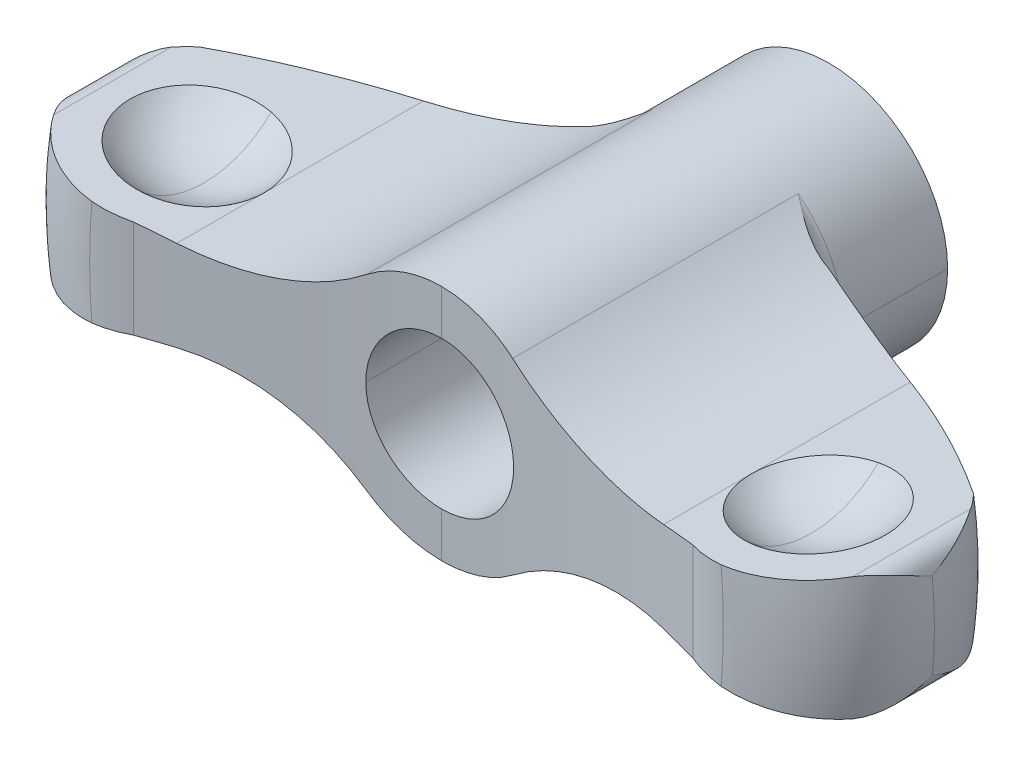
ISO-10303-21;
HEADER;
FILE_DESCRIPTION(('STEP AP214'),'2;1');
FILE_NAME('part.step','',(''),(''),'','','');
FILE_SCHEMA(('AUTOMOTIVE_DESIGN { 1 0 10303 214 1 1 1 1 }'));
ENDSEC;
DATA;
#1=APPLICATION_CONTEXT('core data for automotive mechanical design processes');
#2=APPLICATION_PROTOCOL_DEFINITION('international standard','automotive_design',2000,#1);
#3=PRODUCT_CONTEXT('',#1,'mechanical');
#4=PRODUCT('Part','Part','',(#3));
#5=PRODUCT_RELATED_PRODUCT_CATEGORY('part','',(#4));
#6=PRODUCT_DEFINITION_FORMATION('','',#4);
#7=PRODUCT_DEFINITION_CONTEXT('part definition',#1,'design');
#8=PRODUCT_DEFINITION('design','',#6,#7);
#9=PRODUCT_DEFINITION_SHAPE('','',#8);
#10=(LENGTH_UNIT() NAMED_UNIT(*) SI_UNIT(.MILLI.,.METRE.));
#11=(NAMED_UNIT(*) PLANE_ANGLE_UNIT() SI_UNIT($,.RADIAN.));
#12=(NAMED_UNIT(*) SI_UNIT($,.STERADIAN.) SOLID_ANGLE_UNIT());
#13=UNCERTAINTY_MEASURE_WITH_UNIT(LENGTH_MEASURE(1.E-05),#10,'distance_accuracy_value','');
#14=(GEOMETRIC_REPRESENTATION_CONTEXT(3) GLOBAL_UNCERTAINTY_ASSIGNED_CONTEXT((#13)) GLOBAL_UNIT_ASSIGNED_CONTEXT((#10,
#11,#12)) REPRESENTATION_CONTEXT('',''));
#15=CARTESIAN_POINT('',(0.,0.,0.));
#16=DIRECTION('',(0.,0.,1.));
#17=DIRECTION('',(1.,0.,0.));
#18=AXIS2_PLACEMENT_3D('',#15,#16,#17);
#19=CARTESIAN_POINT('',(0.,0.,18.));
#20=DIRECTION('',(0.,0.,-1.));
#21=DIRECTION('',(0.,-1.,0.));
#22=AXIS2_PLACEMENT_3D('',#19,#20,#21);
#23=TOROIDAL_SURFACE('',#22,18.,6.);
#24=CARTESIAN_POINT('',(21.977730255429,3.4226360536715,13.7573593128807));
#25=CARTESIAN_POINT('',(22.1148980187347,3.43705296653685,13.8951719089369));
#26=CARTESIAN_POINT('',(22.2448209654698,3.4507084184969,14.0389827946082));
#27=CARTESIAN_POINT('',(22.4901772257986,3.47649640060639,14.3386011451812));
#28=CARTESIAN_POINT('',(22.6056105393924,3.48862893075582,14.4944086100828));
#29=CARTESIAN_POINT('',(22.7137990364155,3.49999999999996,14.6562143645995));
#30=B_SPLINE_CURVE_WITH_KNOTS('',3,(#24,#25,#26,#27,#28,#29),.UNSPECIFIED.,.F.,.F.,(4,2,4),(0.,
0.582865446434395,1.16573089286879),.UNSPECIFIED.);
#31=CARTESIAN_POINT('',(21.977730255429,3.4226360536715,13.7573593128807));
#32=VERTEX_POINT('',#31);
#33=CARTESIAN_POINT('',(22.7137990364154,3.5,14.6562143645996));
#34=VERTEX_POINT('',#33);
#35=EDGE_CURVE('E279',#32,#34,#30,.T.);
#36=ORIENTED_EDGE('',*,*,#35,.T.);
#37=CARTESIAN_POINT('',(22.7137990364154,3.49999999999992,14.6562143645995));
#38=CARTESIAN_POINT('',(22.7337448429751,3.49999809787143,14.6855840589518));
#39=CARTESIAN_POINT('',(22.7534820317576,3.49948399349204,14.7150931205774));
#40=CARTESIAN_POINT('',(22.7930491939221,3.49746578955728,14.7751706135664));
#41=CARTESIAN_POINT('',(22.8128671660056,3.49593521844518,14.8057460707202));
#42=CARTESIAN_POINT('',(22.8525506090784,3.49187049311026,14.8679711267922));
#43=CARTESIAN_POINT('',(22.8724028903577,3.48931033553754,14.899627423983));
#44=CARTESIAN_POINT('',(22.9121080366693,3.48317090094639,14.9640274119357));
#45=CARTESIAN_POINT('',(22.93194657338,3.47956607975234,14.9967774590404));
#46=CARTESIAN_POINT('',(22.9921814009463,3.46703764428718,15.098009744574));
#47=CARTESIAN_POINT('',(23.0316323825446,3.45657528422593,15.1668705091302));
#48=CARTESIAN_POINT('',(23.1099900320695,3.4314908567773,15.3090592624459));
#49=CARTESIAN_POINT('',(23.1487563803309,3.41667729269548,15.3824301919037));
#50=CARTESIAN_POINT('',(23.2181157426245,3.38596509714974,15.5195051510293));
#51=CARTESIAN_POINT('',(23.249091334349,3.37051233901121,15.5831169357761));
#52=CARTESIAN_POINT('',(23.3104529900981,3.33652607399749,15.7142089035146));
#53=CARTESIAN_POINT('',(23.3407188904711,3.31787198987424,15.7817140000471));
#54=CARTESIAN_POINT('',(23.4002954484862,3.27739846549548,15.9206320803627));
#55=CARTESIAN_POINT('',(23.4294767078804,3.25546550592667,15.9920673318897));
#56=CARTESIAN_POINT('',(23.4864947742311,3.20836495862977,16.1388719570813));
#57=CARTESIAN_POINT('',(23.5141933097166,3.183090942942,16.214260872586));
#58=CARTESIAN_POINT('',(23.5623040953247,3.13476960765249,16.3530161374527));
#59=CARTESIAN_POINT('',(23.5831675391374,3.11203272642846,16.416335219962));
#60=CARTESIAN_POINT('',(23.6243043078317,3.06353993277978,16.5480431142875));
#61=CARTESIAN_POINT('',(23.6444097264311,3.03768620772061,16.616448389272));
#62=CARTESIAN_POINT('',(23.6835194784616,2.98287692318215,16.7583576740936));
#63=CARTESIAN_POINT('',(23.7023425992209,2.95383170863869,16.8318768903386));
#64=CARTESIAN_POINT('',(23.73833490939,2.89259496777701,16.9840331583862));
#65=CARTESIAN_POINT('',(23.7553095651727,2.86032288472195,17.0626839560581));
#66=CARTESIAN_POINT('',(23.7810371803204,2.80525234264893,17.1943835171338));
#67=CARTESIAN_POINT('',(23.7906651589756,2.7828003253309,17.2474085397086));
#68=CARTESIAN_POINT('',(23.810519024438,2.73222392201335,17.3657769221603));
#69=CARTESIAN_POINT('',(23.8203691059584,2.70398748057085,17.431135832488));
#70=CARTESIAN_POINT('',(23.8394872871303,2.64170079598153,17.5742249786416));
#71=CARTESIAN_POINT('',(23.848299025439,2.60755421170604,17.6519743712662));
#72=CARTESIAN_POINT('',(23.8639224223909,2.53327674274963,17.819818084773));
#73=CARTESIAN_POINT('',(23.8701979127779,2.49305295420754,17.9099215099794));
#74=CARTESIAN_POINT('',(23.8743581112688,2.45255474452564,18.));
#75=B_SPLINE_CURVE_WITH_KNOTS('',3,(#37,#38,#39,#40,#41,#42,#43,#44,#45,#46,#47,#48,#49,#50,#51,
#52,#53,#54,#55,#56,#57,#58,#59,#60,#61,#62,#63,#64,#65,#66,#67,#68,#69,#70,#71,#72,#73,#74),
.UNSPECIFIED.,.F.,.F.,(4,2,2,2,2,2,2,2,2,2,2,2,2,2,2,2,2,2,4),(0.,0.106499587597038,
0.215887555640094,0.328231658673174,0.443595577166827,0.68359398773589,0.936345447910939,
1.1535372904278,1.3823468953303,1.62293629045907,1.87544734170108,2.08672005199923,
2.3141921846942,2.55791147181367,2.81791458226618,2.99304229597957,3.20863194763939,
3.46469242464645,3.76122005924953),.UNSPECIFIED.);
#76=CARTESIAN_POINT('',(23.8743581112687,2.45255474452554,18.));
#77=VERTEX_POINT('',#76);
#78=EDGE_CURVE('E766',#77,#34,#75,.F.);
#79=ORIENTED_EDGE('',*,*,#78,.F.);
#80=CARTESIAN_POINT('',(0.,0.,18.));
#81=DIRECTION('',(0.,0.,-1.));
#82=DIRECTION('',(0.,-1.,0.));
#83=AXIS2_PLACEMENT_3D('',#80,#81,#82);
#84=CIRCLE('',#83,24.);
#85=CARTESIAN_POINT('',(23.8743581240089,-2.45255462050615,18.));
#86=VERTEX_POINT('',#85);
#87=EDGE_CURVE('E690',#86,#77,#84,.F.);
#88=ORIENTED_EDGE('',*,*,#87,.F.);
#89=CARTESIAN_POINT('',(23.874358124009,-2.45255462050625,18.));
#90=CARTESIAN_POINT('',(23.8701995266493,-2.49303723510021,17.9099576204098));
#91=CARTESIAN_POINT('',(23.8639273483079,-2.53324548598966,17.8198902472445));
#92=CARTESIAN_POINT('',(23.8483115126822,-2.60750265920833,17.6520944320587));
#93=CARTESIAN_POINT('',(23.8395028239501,-2.64164431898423,17.5743569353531));
#94=CARTESIAN_POINT('',(23.8203882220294,-2.70393144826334,17.4312674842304));
#95=CARTESIAN_POINT('',(23.8105377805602,-2.73217311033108,17.3658964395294));
#96=CARTESIAN_POINT('',(23.7906781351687,-2.78277017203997,17.2474800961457));
#97=CARTESIAN_POINT('',(23.7810441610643,-2.80523740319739,17.1944192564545));
#98=CARTESIAN_POINT('',(23.755311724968,-2.860318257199,17.0626950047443));
#99=CARTESIAN_POINT('',(23.7383396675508,-2.89258614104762,16.9840553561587));
#100=CARTESIAN_POINT('',(23.7023517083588,-2.95381735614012,16.8319137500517));
#101=CARTESIAN_POINT('',(23.6835300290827,-2.9828611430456,16.7583980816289));
#102=CARTESIAN_POINT('',(23.6444213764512,-3.03767054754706,16.616488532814));
#103=CARTESIAN_POINT('',(23.6243153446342,-3.0635256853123,16.5480794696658));
#104=CARTESIAN_POINT('',(23.5831747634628,-3.11202436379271,16.4163569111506));
#105=CARTESIAN_POINT('',(23.5623078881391,-3.13476554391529,16.3530269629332));
#106=CARTESIAN_POINT('',(23.5141971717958,-3.18308736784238,16.2142721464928));
#107=CARTESIAN_POINT('',(23.4865029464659,-3.20835813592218,16.1388944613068));
#108=CARTESIAN_POINT('',(23.4294915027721,-3.25545451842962,15.9921044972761));
#109=CARTESIAN_POINT('',(23.4003122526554,-3.27738636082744,15.9206727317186));
#110=CARTESIAN_POINT('',(23.3407368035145,-3.31786002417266,15.7817542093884));
#111=CARTESIAN_POINT('',(23.3104697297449,-3.33651512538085,15.7142452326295));
#112=CARTESIAN_POINT('',(23.2491019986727,-3.37050600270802,15.5831385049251));
#113=CARTESIAN_POINT('',(23.218121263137,-3.38596206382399,15.5195158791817));
#114=CARTESIAN_POINT('',(23.1487585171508,-3.41667703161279,15.3824346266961));
#115=CARTESIAN_POINT('',(23.1099944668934,-3.4314907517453,15.3090681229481));
#116=CARTESIAN_POINT('',(23.0316402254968,-3.45657531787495,15.1668850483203));
#117=CARTESIAN_POINT('',(22.9921902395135,-3.46703756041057,15.0980255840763));
#118=CARTESIAN_POINT('',(22.9319563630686,-3.47956590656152,14.9967941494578));
#119=CARTESIAN_POINT('',(22.9121177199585,-3.48317074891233,14.9640436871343));
#120=CARTESIAN_POINT('',(22.8724119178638,-3.48931023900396,14.8996421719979));
#121=CARTESIAN_POINT('',(22.8525590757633,-3.49187041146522,14.867984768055));
#122=CARTESIAN_POINT('',(22.8128740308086,-3.49593518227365,14.8057568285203));
#123=CARTESIAN_POINT('',(22.793055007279,-3.49746576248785,14.7751795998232));
#124=CARTESIAN_POINT('',(22.7534852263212,-3.49948399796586,14.7150979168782));
#125=CARTESIAN_POINT('',(22.7337464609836,-3.49999810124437,14.6855864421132));
#126=CARTESIAN_POINT('',(22.7137990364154,-3.49999999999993,14.6562143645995));
#127=B_SPLINE_CURVE_WITH_KNOTS('',3,(#89,#90,#91,#92,#93,#94,#95,#96,#97,#98,#99,#100,#101,#102,
#103,#104,#105,#106,#107,#108,#109,#110,#111,#112,#113,#114,#115,#116,#117,#118,#119,#120,#121,
#122,#123,#124,#125,#126),.UNSPECIFIED.,.F.,.F.,(4,2,2,2,2,2,2,2,2,2,2,2,2,2,2,2,2,2,4),(0.,
0.296409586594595,0.552430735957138,0.768059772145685,0.943305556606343,1.20327214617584,
1.44697927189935,1.67446358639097,1.88577279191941,2.13824653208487,2.37882350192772,
2.6076455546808,2.82487466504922,3.07761148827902,3.31760499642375,3.43297014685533,
3.54531794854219,3.65471208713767,3.76122031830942),.UNSPECIFIED.);
#128=CARTESIAN_POINT('',(22.7137990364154,-3.5,14.6562143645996));
#129=VERTEX_POINT('',#128);
#130=EDGE_CURVE('E273',#129,#86,#127,.F.);
#131=ORIENTED_EDGE('',*,*,#130,.F.);
#132=CARTESIAN_POINT('',(22.7137990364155,-3.5,14.6562143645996));
#133=CARTESIAN_POINT('',(22.6056105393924,-3.48862893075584,14.4944086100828));
#134=CARTESIAN_POINT('',(22.4901772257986,-3.47649640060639,14.3386011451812));
#135=CARTESIAN_POINT('',(22.2448209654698,-3.45070841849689,14.0389827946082));
#136=CARTESIAN_POINT('',(22.1148980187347,-3.43705296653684,13.8951719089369));
#137=CARTESIAN_POINT('',(21.977730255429,-3.4226360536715,13.7573593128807));
#138=B_SPLINE_CURVE_WITH_KNOTS('',3,(#132,#133,#134,#135,#136,#137),.UNSPECIFIED.,.F.,.F.,(4,2,
4),(0.,0.582865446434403,1.16573089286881),.UNSPECIFIED.);
#139=CARTESIAN_POINT('',(21.977730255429,-3.42263605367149,13.7573593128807));
#140=VERTEX_POINT('',#139);
#141=EDGE_CURVE('E268',#129,#140,#138,.T.);
#142=ORIENTED_EDGE('',*,*,#141,.T.);
#143=CARTESIAN_POINT('',(0.,0.,13.7573593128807));
#144=DIRECTION('',(0.,0.,-1.));
#145=DIRECTION('',(0.,-1.,0.));
#146=AXIS2_PLACEMENT_3D('',#143,#144,#145);
#147=CIRCLE('',#146,22.2426406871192);
#148=EDGE_CURVE('E270',#32,#140,#147,.T.);
#149=ORIENTED_EDGE('',*,*,#148,.F.);
#150=EDGE_LOOP('',(#36,#79,#88,#131,#142,#149));
#151=FACE_BOUND('',#150,.T.);
#152=ADVANCED_FACE('F14',(#151),#23,.T.);
#153=CARTESIAN_POINT('',(22.7137990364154,2.33333333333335,0.));
#154=DIRECTION('',(0.,0.,-1.));
#155=DIRECTION('',(0.,-1.,0.));
#156=AXIS2_PLACEMENT_3D('',#153,#154,#155);
#157=CYLINDRICAL_SURFACE('',#156,1.16666666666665);
#158=ORIENTED_EDGE('',*,*,#78,.T.);
#159=DIRECTION('',(0.,0.,1.));
#160=VECTOR('',#159,1.);
#161=CARTESIAN_POINT('',(22.7137990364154,3.5,0.));
#162=LINE('',#161,#160);
#163=CARTESIAN_POINT('',(22.7137990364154,3.5,21.3437856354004));
#164=VERTEX_POINT('',#163);
#165=EDGE_CURVE('E757',#34,#164,#162,.T.);
#166=ORIENTED_EDGE('',*,*,#165,.T.);
#167=CARTESIAN_POINT('',(23.8743581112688,2.45255474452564,18.));
#168=CARTESIAN_POINT('',(23.8701982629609,2.4930495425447,18.0900709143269));
#169=CARTESIAN_POINT('',(23.8639234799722,2.53326995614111,18.1801667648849));
#170=CARTESIAN_POINT('',(23.8483016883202,2.6075430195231,18.3480004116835));
#171=CARTESIAN_POINT('',(23.8394905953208,2.64168853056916,18.425747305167));
#172=CARTESIAN_POINT('',(23.8203731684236,2.70397529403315,18.5688365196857));
#173=CARTESIAN_POINT('',(23.8105230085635,2.73221284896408,18.6341979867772));
#174=CARTESIAN_POINT('',(23.7906679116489,2.78279375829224,18.7525764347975));
#175=CARTESIAN_POINT('',(23.7810386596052,2.80524909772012,18.8056089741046));
#176=CARTESIAN_POINT('',(23.7553117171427,2.86031839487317,18.9373049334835));
#177=CARTESIAN_POINT('',(23.7383396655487,2.89258617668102,19.0159446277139));
#178=CARTESIAN_POINT('',(23.7023517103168,2.95381732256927,19.1680862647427));
#179=CARTESIAN_POINT('',(23.6835300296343,2.98286113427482,19.2416019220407));
#180=CARTESIAN_POINT('',(23.6444213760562,3.03767055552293,19.3835114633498));
#181=CARTESIAN_POINT('',(23.6243153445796,3.06352568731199,19.4519205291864));
#182=CARTESIAN_POINT('',(23.5831747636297,3.11202436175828,19.5836430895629));
#183=CARTESIAN_POINT('',(23.5623078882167,3.13476554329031,19.6469730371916));
#184=CARTESIAN_POINT('',(23.5141971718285,3.18308736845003,19.7857278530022));
#185=CARTESIAN_POINT('',(23.4865029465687,3.20835813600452,19.8611055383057));
#186=CARTESIAN_POINT('',(23.4294915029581,3.25545451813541,20.0078955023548));
#187=CARTESIAN_POINT('',(23.4003122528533,3.27738636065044,20.0793272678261));
#188=CARTESIAN_POINT('',(23.3407368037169,3.3178600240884,20.2182457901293));
#189=CARTESIAN_POINT('',(23.3104697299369,3.33651512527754,20.2857547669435));
#190=CARTESIAN_POINT('',(23.2491019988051,3.37050600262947,20.416861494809));
#191=CARTESIAN_POINT('',(23.2181212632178,3.38596206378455,20.4804841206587));
#192=CARTESIAN_POINT('',(23.1487585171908,3.41667703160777,20.6175653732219));
#193=CARTESIAN_POINT('',(23.1099944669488,3.43149075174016,20.6909318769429));
#194=CARTESIAN_POINT('',(23.0316402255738,3.45657531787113,20.8331149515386));
#195=CARTESIAN_POINT('',(22.9921902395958,3.46703756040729,20.9019744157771));
#196=CARTESIAN_POINT('',(22.9319563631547,3.47956590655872,21.0032058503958));
#197=CARTESIAN_POINT('',(22.9121177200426,3.4831707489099,21.0359563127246));
#198=CARTESIAN_POINT('',(22.8724119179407,3.48931023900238,21.1003578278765));
#199=CARTESIAN_POINT('',(22.852559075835,3.49187041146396,21.1320152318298));
#200=CARTESIAN_POINT('',(22.8128740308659,3.49593518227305,21.19424317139));
#201=CARTESIAN_POINT('',(22.7930550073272,3.49746576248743,21.2248204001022));
#202=CARTESIAN_POINT('',(22.7534852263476,3.49948399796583,21.2849020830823));
#203=CARTESIAN_POINT('',(22.733746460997,3.49999810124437,21.3144135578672));
#204=CARTESIAN_POINT('',(22.7137990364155,3.49999999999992,21.3437856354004));
#205=B_SPLINE_CURVE_WITH_KNOTS('',3,(#167,#168,#169,#170,#171,#172,#173,#174,#175,#176,#177,
#178,#179,#180,#181,#182,#183,#184,#185,#186,#187,#188,#189,#190,#191,#192,#193,#194,#195,#196,
#197,#198,#199,#200,#201,#202,#203,#204),.UNSPECIFIED.,.F.,.F.,(4,2,2,2,2,2,2,2,2,2,2,2,2,2,2,2,
2,2,4),(0.,0.296502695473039,0.552554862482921,0.768152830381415,0.943305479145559,
1.20327206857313,1.44697919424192,1.67446350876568,1.88577271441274,2.13824645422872,
2.37882342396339,2.60764547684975,2.82487458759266,3.07761141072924,3.31760491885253,
3.43297006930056,3.54531787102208,3.65471200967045,3.76122024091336),.UNSPECIFIED.);
#206=EDGE_CURVE('E653',#77,#164,#205,.T.);
#207=ORIENTED_EDGE('',*,*,#206,.F.);
#208=EDGE_LOOP('',(#158,#166,#207));
#209=FACE_BOUND('',#208,.T.);
#210=ADVANCED_FACE('F794',(#209),#157,.T.);
#211=CARTESIAN_POINT('',(17.25,6.75,18.25));
#212=DIRECTION('',(0.,0.,1.));
#213=DIRECTION('',(-1.,0.,0.));
#214=AXIS2_PLACEMENT_3D('',#211,#212,#213);
#215=SPHERICAL_SURFACE('',#214,5.4);
#216=CARTESIAN_POINT('',(17.25,6.75,18.25));
#217=DIRECTION('',(1.,0.,0.));
#218=DIRECTION('',(0.,0.,1.));
#219=AXIS2_PLACEMENT_3D('',#216,#217,#218);
#220=CIRCLE('',#219,5.4);
#221=CARTESIAN_POINT('',(17.25,1.35,18.25));
#222=VERTEX_POINT('',#221);
#223=CARTESIAN_POINT('',(17.25,2.92573158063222,22.062475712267));
#224=VERTEX_POINT('',#223);
#225=EDGE_CURVE('E778',#222,#224,#220,.F.);
#226=ORIENTED_EDGE('',*,*,#225,.T.);
#227=CARTESIAN_POINT('',(17.25,2.92573158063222,22.062475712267));
#228=CARTESIAN_POINT('',(17.3566407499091,2.93693997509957,22.0737291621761));
#229=CARTESIAN_POINT('',(17.4637505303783,2.94819766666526,22.0804377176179));
#230=CARTESIAN_POINT('',(17.6781466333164,2.97073160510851,22.0847651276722));
#231=CARTESIAN_POINT('',(17.7854329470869,2.98200785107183,22.0823844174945));
#232=CARTESIAN_POINT('',(17.9993557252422,3.00449204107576,22.0685393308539));
#233=CARTESIAN_POINT('',(18.1059925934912,3.0157000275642,22.0570813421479));
#234=CARTESIAN_POINT('',(18.317899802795,3.03797237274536,22.0251903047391));
#235=CARTESIAN_POINT('',(18.4231701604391,3.04903673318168,22.0047573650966));
#236=CARTESIAN_POINT('',(18.7359174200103,3.08190779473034,21.9301450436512));
#237=CARTESIAN_POINT('',(18.9404210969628,3.10340199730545,21.8626462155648));
#238=CARTESIAN_POINT('',(19.3351018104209,3.14488461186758,21.6941292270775));
#239=CARTESIAN_POINT('',(19.5252816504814,3.1648733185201,21.5931176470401));
#240=CARTESIAN_POINT('',(19.8861130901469,3.20279823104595,21.3604156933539));
#241=CARTESIAN_POINT('',(20.0567642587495,3.22073439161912,21.2287246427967));
#242=CARTESIAN_POINT('',(20.3736745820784,3.2540430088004,20.9383859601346));
#243=CARTESIAN_POINT('',(20.5199300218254,3.26941507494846,20.7797342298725));
#244=CARTESIAN_POINT('',(20.7838696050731,3.29715624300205,20.4399985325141));
#245=CARTESIAN_POINT('',(20.9015550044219,3.30952547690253,20.2589155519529));
#246=CARTESIAN_POINT('',(21.1050125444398,3.33090972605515,19.8794651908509));
#247=CARTESIAN_POINT('',(21.1907867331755,3.33992495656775,19.6810989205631));
#248=CARTESIAN_POINT('',(21.3279998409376,3.35434663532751,19.2726986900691));
#249=CARTESIAN_POINT('',(21.3794381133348,3.35975301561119,19.0626645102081));
#250=CARTESIAN_POINT('',(21.4465173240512,3.36680332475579,18.6368883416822));
#251=CARTESIAN_POINT('',(21.462157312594,3.36844715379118,18.421146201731));
#252=CARTESIAN_POINT('',(21.4571932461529,3.36792540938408,17.9900840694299));
#253=CARTESIAN_POINT('',(21.4365892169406,3.36575983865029,17.7747640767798));
#254=CARTESIAN_POINT('',(21.3597229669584,3.35768087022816,17.3506638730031));
#255=CARTESIAN_POINT('',(21.3034616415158,3.35176756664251,17.1418834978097));
#256=CARTESIAN_POINT('',(21.156880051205,3.33636122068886,16.7367865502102));
#257=CARTESIAN_POINT('',(21.0665603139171,3.3268682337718,16.5404697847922));
#258=CARTESIAN_POINT('',(20.8544187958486,3.30457126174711,16.1658584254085));
#259=CARTESIAN_POINT('',(20.7325952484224,3.29176709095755,15.9875648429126));
#260=CARTESIAN_POINT('',(20.4609056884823,3.26321136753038,15.6540690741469));
#261=CARTESIAN_POINT('',(20.3110388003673,3.24745972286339,15.4988676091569));
#262=CARTESIAN_POINT('',(19.9875278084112,3.21345734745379,15.2159844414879));
#263=CARTESIAN_POINT('',(19.8138865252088,3.19520691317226,15.0882994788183));
#264=CARTESIAN_POINT('',(19.447779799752,3.1567275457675,14.8640526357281));
#265=CARTESIAN_POINT('',(19.2553139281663,3.13649856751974,14.767491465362));
#266=CARTESIAN_POINT('',(18.8568521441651,3.0946185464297,14.6082122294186));
#267=CARTESIAN_POINT('',(18.6508552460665,3.07296739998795,14.5454966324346));
#268=CARTESIAN_POINT('',(18.3436575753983,3.04067962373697,14.4797242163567));
#269=CARTESIAN_POINT('',(18.2452279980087,3.03033425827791,14.4626927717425));
#270=CARTESIAN_POINT('',(18.0473221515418,3.00953351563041,14.4364394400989));
#271=CARTESIAN_POINT('',(17.9478459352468,2.99907814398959,14.4272171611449));
#272=CARTESIAN_POINT('',(17.7484767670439,2.97812360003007,14.4166533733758));
#273=CARTESIAN_POINT('',(17.6485837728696,2.96762442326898,14.4153126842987));
#274=CARTESIAN_POINT('',(17.4489917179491,2.94664645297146,14.4205097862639));
#275=CARTESIAN_POINT('',(17.3492926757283,2.93616766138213,14.4270482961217));
#276=CARTESIAN_POINT('',(17.25,2.92573158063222,14.4375242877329));
#277=B_SPLINE_CURVE_WITH_KNOTS('',3,(#227,#228,#229,#230,#231,#232,#233,#234,#235,#236,#237,
#238,#239,#240,#241,#242,#243,#244,#245,#246,#247,#248,#249,#250,#251,#252,#253,#254,#255,#256,
#257,#258,#259,#260,#261,#262,#263,#264,#265,#266,#267,#268,#269,#270,#271,#272,#273,#274,#275,
#276),.UNSPECIFIED.,.F.,.F.,(4,2,2,2,2,2,2,2,2,2,2,2,2,2,2,2,2,2,2,2,2,2,2,2,4),(0.,
0.323345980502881,0.646676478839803,0.96977964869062,1.29287889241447,1.93880698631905,
2.58460832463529,3.23042391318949,3.87633775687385,4.52222320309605,5.16806718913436,
5.81392333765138,6.4597966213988,7.10566944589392,7.75152605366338,8.39737265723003,
9.04325548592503,9.68915848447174,10.3349849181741,10.9808260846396,11.6267143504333,
11.9277483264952,12.2287671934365,12.5298173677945,12.8308950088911),.UNSPECIFIED.);
#278=CARTESIAN_POINT('',(17.25,2.92573158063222,14.4375242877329));
#279=VERTEX_POINT('',#278);
#280=EDGE_CURVE('E728',#224,#279,#277,.T.);
#281=ORIENTED_EDGE('',*,*,#280,.T.);
#282=CARTESIAN_POINT('',(17.25,6.75,18.25));
#283=DIRECTION('',(1.,0.,0.));
#284=DIRECTION('',(0.,0.,1.));
#285=AXIS2_PLACEMENT_3D('',#282,#283,#284);
#286=CIRCLE('',#285,5.4);
#287=EDGE_CURVE('E697',#279,#222,#286,.F.);
#288=ORIENTED_EDGE('',*,*,#287,.T.);
#289=EDGE_LOOP('',(#226,#281,#288));
#290=FACE_BOUND('',#289,.T.);
#291=ADVANCED_FACE('F707',(#290),#215,.F.);
#292=CARTESIAN_POINT('',(17.25,6.75,18.25));
#293=DIRECTION('',(0.,0.,1.));
#294=DIRECTION('',(-1.,0.,0.));
#295=AXIS2_PLACEMENT_3D('',#292,#293,#294);
#296=SPHERICAL_SURFACE('',#295,5.4);
#297=CARTESIAN_POINT('',(17.25,2.92573158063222,14.4375242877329));
#298=CARTESIAN_POINT('',(17.1433574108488,2.91452299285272,14.4487571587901));
#299=CARTESIAN_POINT('',(17.0371935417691,2.90336472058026,14.464533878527));
#300=CARTESIAN_POINT('',(16.8265681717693,2.88122710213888,14.5050161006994));
#301=CARTESIAN_POINT('',(16.7221065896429,2.87024774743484,14.529721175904));
#302=CARTESIAN_POINT('',(16.5156923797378,2.8485527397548,14.5878820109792));
#303=CARTESIAN_POINT('',(16.4137380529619,2.83783690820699,14.6213316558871));
#304=CARTESIAN_POINT('',(16.2130176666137,2.81674034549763,14.6967258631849));
#305=CARTESIAN_POINT('',(16.114251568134,2.80635961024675,14.7386703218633));
#306=CARTESIAN_POINT('',(15.8236921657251,2.77582058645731,14.8768908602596));
#307=CARTESIAN_POINT('',(15.63755544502,2.75625682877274,14.9855773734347));
#308=CARTESIAN_POINT('',(15.2862224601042,2.71933024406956,15.2327482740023));
#309=CARTESIAN_POINT('',(15.1210209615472,2.70196686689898,15.3712251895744));
#310=CARTESIAN_POINT('',(14.8160669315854,2.66991490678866,15.6740954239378));
#311=CARTESIAN_POINT('',(14.676311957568,2.65522606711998,15.8384862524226));
#312=CARTESIAN_POINT('',(14.4261783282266,2.62893596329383,16.1886069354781));
#313=CARTESIAN_POINT('',(14.315812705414,2.6173360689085,16.3743462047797));
#314=CARTESIAN_POINT('',(14.127617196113,2.59755592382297,16.7618844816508));
#315=CARTESIAN_POINT('',(14.0498041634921,2.58937744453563,16.9636917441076));
#316=CARTESIAN_POINT('',(13.9290924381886,2.57669013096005,17.3774240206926));
#317=CARTESIAN_POINT('',(13.8861423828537,2.57217589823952,17.589333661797));
#318=CARTESIAN_POINT('',(13.8525068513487,2.56864066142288,17.8773186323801));
#319=CARTESIAN_POINT('',(13.8460058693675,2.56795738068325,17.9517714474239));
#320=CARTESIAN_POINT('',(13.8373477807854,2.56704737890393,18.1008056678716));
#321=CARTESIAN_POINT('',(13.8351833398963,2.56681988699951,18.1753866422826));
#322=CARTESIAN_POINT('',(13.8351792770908,2.56681945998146,18.25));
#323=B_SPLINE_CURVE_WITH_KNOTS('',3,(#297,#298,#299,#300,#301,#302,#303,#304,#305,#306,#307,
#308,#309,#310,#311,#312,#313,#314,#315,#316,#317,#318,#319,#320,#321,#322),.UNSPECIFIED.,.F.,
.F.,(4,2,2,2,2,2,2,2,2,2,2,2,4),(0.,0.323345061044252,0.646674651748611,0.969778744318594,
1.29287889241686,1.93882452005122,2.58460832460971,3.23033010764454,3.87633775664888,
4.52267945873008,5.16806718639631,5.39219018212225,5.61593380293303),.UNSPECIFIED.);
#324=CARTESIAN_POINT('',(13.8351792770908,2.56681945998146,18.25));
#325=VERTEX_POINT('',#324);
#326=EDGE_CURVE('E713',#279,#325,#323,.T.);
#327=ORIENTED_EDGE('',*,*,#326,.T.);
#328=CARTESIAN_POINT('',(13.8351792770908,2.56681945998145,18.25));
#329=CARTESIAN_POINT('',(13.8351690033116,2.56681838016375,18.3578167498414));
#330=CARTESIAN_POINT('',(13.8397029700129,2.56729491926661,18.4656286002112));
#331=CARTESIAN_POINT('',(13.8577798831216,2.56919487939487,18.6804809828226));
#332=CARTESIAN_POINT('',(13.8713223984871,2.57061825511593,18.7875215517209));
#333=CARTESIAN_POINT('',(13.9073243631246,2.57440221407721,19.0000061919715));
#334=CARTESIAN_POINT('',(13.9297775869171,2.57676214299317,19.1054513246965));
#335=CARTESIAN_POINT('',(13.9834188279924,2.5824000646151,19.3140390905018));
#336=CARTESIAN_POINT('',(14.014606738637,2.58567804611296,19.4171817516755));
#337=CARTESIAN_POINT('',(14.1210210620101,2.59686264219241,19.7221624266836));
#338=CARTESIAN_POINT('',(14.2091125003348,2.60612142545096,19.9196378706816));
#339=CARTESIAN_POINT('',(14.4169521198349,2.62796624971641,20.2967550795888));
#340=CARTESIAN_POINT('',(14.5366923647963,2.64055145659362,20.4764012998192));
#341=CARTESIAN_POINT('',(14.8044605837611,2.66869503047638,20.8129466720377));
#342=CARTESIAN_POINT('',(14.9524858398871,2.68425311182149,20.969848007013));
#343=CARTESIAN_POINT('',(15.2727061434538,2.7179096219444,21.2564988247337));
#344=CARTESIAN_POINT('',(15.4449118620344,2.7360091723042,21.3862362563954));
#345=CARTESIAN_POINT('',(15.8086008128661,2.77423442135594,21.6148492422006));
#346=CARTESIAN_POINT('',(16.0000939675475,2.79436116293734,21.7137088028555));
#347=CARTESIAN_POINT('',(16.3967286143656,2.83604914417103,21.8775677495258));
#348=CARTESIAN_POINT('',(16.6018495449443,2.85760822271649,21.9426168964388));
#349=CARTESIAN_POINT('',(16.8831878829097,2.88717807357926,22.0062844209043));
#350=CARTESIAN_POINT('',(16.9561512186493,2.8948468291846,22.0205495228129));
#351=CARTESIAN_POINT('',(17.1026580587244,2.91024531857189,22.0447491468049));
#352=CARTESIAN_POINT('',(17.1762003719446,2.91797492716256,22.0546909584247));
#353=CARTESIAN_POINT('',(17.25,2.92573158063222,22.062475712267));
#354=B_SPLINE_CURVE_WITH_KNOTS('',3,(#328,#329,#330,#331,#332,#333,#334,#335,#336,#337,#338,
#339,#340,#341,#342,#343,#344,#345,#346,#347,#348,#349,#350,#351,#352,#353),.UNSPECIFIED.,.F.,
.F.,(4,2,2,2,2,2,2,2,2,2,2,2,4),(0.,0.323345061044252,0.646674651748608,0.969778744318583,
1.29287889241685,1.9388245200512,2.58460832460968,3.23033010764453,3.87633775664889,
4.5226794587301,5.16806718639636,5.39219018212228,5.61593380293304),.UNSPECIFIED.);
#355=EDGE_CURVE('E721',#325,#224,#354,.T.);
#356=ORIENTED_EDGE('',*,*,#355,.T.);
#357=ORIENTED_EDGE('',*,*,#225,.F.);
#358=ORIENTED_EDGE('',*,*,#287,.F.);
#359=EDGE_LOOP('',(#327,#356,#357,#358));
#360=FACE_BOUND('',#359,.T.);
#361=ADVANCED_FACE('F703',(#360),#296,.F.);
#362=CARTESIAN_POINT('',(0.,0.,18.));
#363=DIRECTION('',(0.,0.,-1.));
#364=DIRECTION('',(0.,-1.,0.));
#365=AXIS2_PLACEMENT_3D('',#362,#363,#364);
#366=TOROIDAL_SURFACE('',#365,18.,6.);
#367=CARTESIAN_POINT('',(17.8757076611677,-2.99149610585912,23.9987124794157));
#368=CARTESIAN_POINT('',(18.0439542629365,-3.00917953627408,23.9952318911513));
#369=CARTESIAN_POINT('',(18.2120514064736,-3.02684725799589,23.9845859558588));
#370=CARTESIAN_POINT('',(18.5467541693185,-3.06202593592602,23.9491139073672));
#371=CARTESIAN_POINT('',(18.7133598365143,-3.07953689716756,23.9242882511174));
#372=CARTESIAN_POINT('',(19.0437271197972,-3.11425989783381,23.8606399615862));
#373=CARTESIAN_POINT('',(19.2074914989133,-3.13147222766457,23.8218318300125));
#374=CARTESIAN_POINT('',(19.5311857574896,-3.16549386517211,23.730491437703));
#375=CARTESIAN_POINT('',(19.6911157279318,-3.18230318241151,23.6779595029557));
#376=CARTESIAN_POINT('',(20.0061065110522,-3.21541004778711,23.5595000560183));
#377=CARTESIAN_POINT('',(20.1611641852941,-3.23170726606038,23.4935641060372));
#378=CARTESIAN_POINT('',(20.4652571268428,-3.26366872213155,23.3487536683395));
#379=CARTESIAN_POINT('',(20.6142900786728,-3.27933271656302,23.2698742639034));
#380=CARTESIAN_POINT('',(20.9050901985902,-3.3098970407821,23.0998205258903));
#381=CARTESIAN_POINT('',(21.0468629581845,-3.32479795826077,23.0086558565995));
#382=CARTESIAN_POINT('',(21.3223050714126,-3.35374809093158,22.8145922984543));
#383=CARTESIAN_POINT('',(21.4559718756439,-3.36779703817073,22.7116897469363));
#384=CARTESIAN_POINT('',(21.693287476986,-3.3927399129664,22.5124611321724));
#385=CARTESIAN_POINT('',(21.7982943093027,-3.4037765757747,22.4177640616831));
#386=CARTESIAN_POINT('',(22.0013794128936,-3.42512168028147,22.2211347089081));
#387=CARTESIAN_POINT('',(22.0994579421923,-3.4354301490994,22.1192026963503));
#388=CARTESIAN_POINT('',(22.2882075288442,-3.45526853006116,21.9085914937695));
#389=CARTESIAN_POINT('',(22.3788771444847,-3.46479829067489,21.7999109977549));
#390=CARTESIAN_POINT('',(22.5523526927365,-3.48303130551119,21.5763545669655));
#391=CARTESIAN_POINT('',(22.6351574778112,-3.4917344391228,21.4614777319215));
#392=CARTESIAN_POINT('',(22.7137990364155,-3.5,21.3437856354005));
#393=B_SPLINE_CURVE_WITH_KNOTS('',3,(#367,#368,#369,#370,#371,#372,#373,#374,#375,#376,#377,
#378,#379,#380,#381,#382,#383,#384,#385,#386,#387,#388,#389,#390,#391,#392),.UNSPECIFIED.,.F.,
.F.,(4,2,2,2,2,2,2,2,2,2,2,2,4),(0.,0.507473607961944,1.01493086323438,1.5218633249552,
2.02878374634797,2.53602426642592,3.04345791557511,3.55049469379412,4.05769012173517,
4.4828373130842,4.90796866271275,5.33318254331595,5.75845837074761),.UNSPECIFIED.);
#394=CARTESIAN_POINT('',(17.8757076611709,-2.99149610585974,23.9987124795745));
#395=VERTEX_POINT('',#394);
#396=CARTESIAN_POINT('',(22.7137990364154,-3.5,21.3437856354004));
#397=VERTEX_POINT('',#396);
#398=EDGE_CURVE('E300',#395,#397,#393,.T.);
#399=ORIENTED_EDGE('',*,*,#398,.T.);
#400=CARTESIAN_POINT('',(22.7137990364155,-3.49999999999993,21.3437856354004));
#401=CARTESIAN_POINT('',(22.7337448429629,-3.49999809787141,21.3144159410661));
#402=CARTESIAN_POINT('',(22.7534820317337,-3.49948399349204,21.2849068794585));
#403=CARTESIAN_POINT('',(22.7930491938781,-3.49746578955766,21.2248293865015));
#404=CARTESIAN_POINT('',(22.8128671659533,-3.49593521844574,21.1942539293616));
#405=CARTESIAN_POINT('',(22.852550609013,-3.49187049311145,21.1320288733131));
#406=CARTESIAN_POINT('',(22.8724028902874,-3.48931033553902,21.1003725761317));
#407=CARTESIAN_POINT('',(22.9121080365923,-3.48317090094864,21.0359725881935));
#408=CARTESIAN_POINT('',(22.9319465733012,-3.47956607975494,21.0032225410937));
#409=CARTESIAN_POINT('',(22.9921814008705,-3.46703764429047,20.9019902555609));
#410=CARTESIAN_POINT('',(23.0316323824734,-3.45657528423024,20.8331294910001));
#411=CARTESIAN_POINT('',(23.1099900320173,-3.43149085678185,20.6909407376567));
#412=CARTESIAN_POINT('',(23.1487563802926,-3.41667729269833,20.6175698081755));
#413=CARTESIAN_POINT('',(23.2181157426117,-3.38596509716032,20.4804948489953));
#414=CARTESIAN_POINT('',(23.2490913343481,-3.37051233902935,20.4168830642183));
#415=CARTESIAN_POINT('',(23.3104529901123,-3.3365260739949,20.2857910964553));
#416=CARTESIAN_POINT('',(23.3407188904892,-3.31787198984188,20.2182859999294));
#417=CARTESIAN_POINT('',(23.400295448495,-3.27739846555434,20.0793679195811));
#418=CARTESIAN_POINT('',(23.4294767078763,-3.25546550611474,20.0079326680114));
#419=CARTESIAN_POINT('',(23.4864947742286,-3.2083649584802,19.8611280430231));
#420=CARTESIAN_POINT('',(23.5141933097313,-3.18309094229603,19.785739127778));
#421=CARTESIAN_POINT('',(23.5623040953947,-3.13476960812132,19.6469838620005));
#422=CARTESIAN_POINT('',(23.5831675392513,-3.11203272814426,19.5836647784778));
#423=CARTESIAN_POINT('',(23.6243043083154,-3.06353993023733,19.4519568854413));
#424=CARTESIAN_POINT('',(23.6444097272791,-3.03768619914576,19.3835516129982));
#425=CARTESIAN_POINT('',(23.6835194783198,-2.98287693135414,19.2416423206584));
#426=CARTESIAN_POINT('',(23.702342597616,-2.95383174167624,19.1681230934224));
#427=CARTESIAN_POINT('',(23.738334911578,-2.8925949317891,19.0159668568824));
#428=CARTESIAN_POINT('',(23.7553095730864,-2.86032274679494,18.9373161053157));
#429=CARTESIAN_POINT('',(23.7810426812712,-2.80524064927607,18.8055882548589));
#430=CARTESIAN_POINT('',(23.790675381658,-2.78277674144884,18.7525349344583));
#431=CARTESIAN_POINT('',(23.8105337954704,-2.73218418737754,18.6341286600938));
#432=CARTESIAN_POINT('',(23.8203841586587,-2.70394363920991,18.568760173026));
#433=CARTESIAN_POINT('',(23.8394995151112,-2.64165658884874,18.4256707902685));
#434=CARTESIAN_POINT('',(23.8483088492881,-2.60751385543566,18.3479307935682));
#435=CARTESIAN_POINT('',(23.8639262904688,-2.5332522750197,18.1801249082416));
#436=CARTESIAN_POINT('',(23.8701991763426,-2.4930406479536,18.0900499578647));
#437=CARTESIAN_POINT('',(23.874358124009,-2.45255462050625,18.));
#438=B_SPLINE_CURVE_WITH_KNOTS('',3,(#400,#401,#402,#403,#404,#405,#406,#407,#408,#409,#410,
#411,#412,#413,#414,#415,#416,#417,#418,#419,#420,#421,#422,#423,#424,#425,#426,#427,#428,#429,
#430,#431,#432,#433,#434,#435,#436,#437),.UNSPECIFIED.,.F.,.F.,(4,2,2,2,2,2,2,2,2,2,2,2,2,2,2,2,
2,2,4),(0.,0.106499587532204,0.215887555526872,0.32823165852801,0.443595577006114,
0.683593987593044,0.93634544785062,1.15353729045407,1.38234689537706,1.62293629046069,
1.87544734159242,2.08672005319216,2.31419218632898,2.55791147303,2.81791458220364,
2.99313542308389,3.20875614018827,3.46478560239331,3.76122013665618),.UNSPECIFIED.);
#439=EDGE_CURVE('E614',#86,#397,#438,.F.);
#440=ORIENTED_EDGE('',*,*,#439,.F.);
#441=ORIENTED_EDGE('',*,*,#87,.T.);
#442=ORIENTED_EDGE('',*,*,#206,.T.);
#443=CARTESIAN_POINT('',(22.7137990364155,3.5,21.3437856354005));
#444=CARTESIAN_POINT('',(22.6201235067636,3.49015430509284,21.4839907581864));
#445=CARTESIAN_POINT('',(22.5205311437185,3.47968672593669,21.6201945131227));
#446=CARTESIAN_POINT('',(22.3102926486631,3.45758976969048,21.8836750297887));
#447=CARTESIAN_POINT('',(22.1996470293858,3.44596044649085,22.0109522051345));
#448=CARTESIAN_POINT('',(21.9682113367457,3.42163557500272,22.2555223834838));
#449=CARTESIAN_POINT('',(21.847433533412,3.40894131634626,22.3728271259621));
#450=CARTESIAN_POINT('',(21.596487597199,3.38256583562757,22.5967934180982));
#451=CARTESIAN_POINT('',(21.4663196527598,3.36888463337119,22.7034551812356));
#452=CARTESIAN_POINT('',(21.1974424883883,3.34062450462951,22.9054398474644));
#453=CARTESIAN_POINT('',(21.0587285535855,3.32604508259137,23.0007564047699));
#454=CARTESIAN_POINT('',(20.7737583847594,3.29609351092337,23.1793432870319));
#455=CARTESIAN_POINT('',(20.6274993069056,3.28072106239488,23.2626090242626));
#456=CARTESIAN_POINT('',(20.3286351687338,3.249309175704,23.4164102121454));
#457=CARTESIAN_POINT('',(20.1760345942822,3.23327020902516,23.4869544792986));
#458=CARTESIAN_POINT('',(19.8654179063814,3.20062307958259,23.6149114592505));
#459=CARTESIAN_POINT('',(19.7074000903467,3.18401473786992,23.6723199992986));
#460=CARTESIAN_POINT('',(19.4121641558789,3.15298419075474,23.7656591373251));
#461=CARTESIAN_POINT('',(19.2755530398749,3.13862578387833,23.8035439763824));
#462=CARTESIAN_POINT('',(19.0000020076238,3.10966420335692,23.869473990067));
#463=CARTESIAN_POINT('',(18.8610621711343,3.09506103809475,23.8975195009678));
#464=CARTESIAN_POINT('',(18.5815402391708,3.06568209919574,23.9436317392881));
#465=CARTESIAN_POINT('',(18.4409579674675,3.05090630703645,23.9616973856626));
#466=CARTESIAN_POINT('',(18.1588550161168,3.02125609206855,23.9877703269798));
#467=CARTESIAN_POINT('',(18.017334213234,3.00638165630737,23.9957762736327));
#468=CARTESIAN_POINT('',(17.8757076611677,2.99149610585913,23.9987124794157));
#469=B_SPLINE_CURVE_WITH_KNOTS('',3,(#443,#444,#445,#446,#447,#448,#449,#450,#451,#452,#453,
#454,#455,#456,#457,#458,#459,#460,#461,#462,#463,#464,#465,#466,#467,#468),.UNSPECIFIED.,.F.,
.F.,(4,2,2,2,2,2,2,2,2,2,2,2,4),(0.,0.506565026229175,1.01310656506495,1.51904330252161,
2.02496988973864,2.53117814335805,3.03757860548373,3.54362675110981,4.04983542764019,
4.47696497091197,4.90407991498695,5.331241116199,5.75845956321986),.UNSPECIFIED.);
#470=CARTESIAN_POINT('',(17.8757076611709,2.99149610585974,23.9987124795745));
#471=VERTEX_POINT('',#470);
#472=EDGE_CURVE('E729',#164,#471,#469,.T.);
#473=ORIENTED_EDGE('',*,*,#472,.T.);
#474=CARTESIAN_POINT('',(17.8757076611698,2.99149610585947,23.9987124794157));
#475=CARTESIAN_POINT('',(17.8860573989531,2.86694718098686,23.9989265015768));
#476=CARTESIAN_POINT('',(17.8957622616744,2.74234461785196,23.99910131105));
#477=CARTESIAN_POINT('',(17.9138720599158,2.49317902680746,23.9993890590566));
#478=CARTESIAN_POINT('',(17.9222783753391,2.36861609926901,23.9995020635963));
#479=CARTESIAN_POINT('',(17.9377971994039,2.11950393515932,23.999683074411));
#480=CARTESIAN_POINT('',(17.9449106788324,1.99495475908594,23.9997511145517));
#481=CARTESIAN_POINT('',(17.9578474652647,1.74584381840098,23.9998559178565));
#482=CARTESIAN_POINT('',(17.9636713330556,1.62128208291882,23.9998926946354));
#483=CARTESIAN_POINT('',(17.974030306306,1.37211944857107,23.9999463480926));
#484=CARTESIAN_POINT('',(17.9785655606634,1.24751855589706,23.9999632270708));
#485=CARTESIAN_POINT('',(17.9863464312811,0.998250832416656,23.9999858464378));
#486=CARTESIAN_POINT('',(17.9895917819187,0.873583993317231,23.9999915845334));
#487=CARTESIAN_POINT('',(17.9947897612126,0.62415749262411,23.9999983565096));
#488=CARTESIAN_POINT('',(17.9967417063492,0.499397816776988,23.9999993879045));
#489=CARTESIAN_POINT('',(17.9993473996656,0.24975878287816,23.999999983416));
#490=CARTESIAN_POINT('',(18.0000000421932,0.124879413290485,23.9999995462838));
#491=CARTESIAN_POINT('',(18.,0.,24.));
#492=B_SPLINE_CURVE_WITH_KNOTS('',3,(#474,#475,#476,#477,#478,#479,#480,#481,#482,#483,#484,
#485,#486,#487,#488,#489,#490,#491),.UNSPECIFIED.,.F.,.F.,(4,2,2,2,2,2,2,2,4),(0.,
0.374933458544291,0.749465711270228,1.12371555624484,1.49780233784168,1.87184587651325,
2.24596639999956,2.6202844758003,2.99492094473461),.UNSPECIFIED.);
#493=CARTESIAN_POINT('',(18.,0.,24.));
#494=VERTEX_POINT('',#493);
#495=EDGE_CURVE('E665',#494,#471,#492,.F.);
#496=ORIENTED_EDGE('',*,*,#495,.F.);
#497=CARTESIAN_POINT('',(18.,0.,24.));
#498=CARTESIAN_POINT('',(18.0000000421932,-0.124879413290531,23.9999995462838));
#499=CARTESIAN_POINT('',(17.9993473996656,-0.24975878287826,23.999999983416));
#500=CARTESIAN_POINT('',(17.9967417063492,-0.499397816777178,23.9999993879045));
#501=CARTESIAN_POINT('',(17.9947897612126,-0.624157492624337,23.9999983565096));
#502=CARTESIAN_POINT('',(17.9895917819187,-0.87358399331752,23.9999915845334));
#503=CARTESIAN_POINT('',(17.986346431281,-0.998250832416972,23.9999858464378));
#504=CARTESIAN_POINT('',(17.9785655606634,-1.24751855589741,23.9999632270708));
#505=CARTESIAN_POINT('',(17.9740303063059,-1.37211944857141,23.9999463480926));
#506=CARTESIAN_POINT('',(17.9636713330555,-1.62128208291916,23.9998926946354));
#507=CARTESIAN_POINT('',(17.9578474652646,-1.74584381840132,23.9998559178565));
#508=CARTESIAN_POINT('',(17.9449106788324,-1.99495475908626,23.9997511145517));
#509=CARTESIAN_POINT('',(17.9377971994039,-2.11950393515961,23.999683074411));
#510=CARTESIAN_POINT('',(17.922278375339,-2.36861609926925,23.9995020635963));
#511=CARTESIAN_POINT('',(17.9138720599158,-2.49317902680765,23.9993890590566));
#512=CARTESIAN_POINT('',(17.8957622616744,-2.74234461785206,23.99910131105));
#513=CARTESIAN_POINT('',(17.8860573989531,-2.86694718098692,23.9989265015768));
#514=CARTESIAN_POINT('',(17.8757076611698,-2.99149610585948,23.9987124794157));
#515=B_SPLINE_CURVE_WITH_KNOTS('',3,(#497,#498,#499,#500,#501,#502,#503,#504,#505,#506,#507,
#508,#509,#510,#511,#512,#513,#514),.UNSPECIFIED.,.F.,.F.,(4,2,2,2,2,2,2,2,4),(0.,
0.374636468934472,0.748954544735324,1.12307506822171,1.49711860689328,1.87120538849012,
2.24545523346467,2.61998748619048,2.99492094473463),.UNSPECIFIED.);
#516=EDGE_CURVE('E676',#395,#494,#515,.F.);
#517=ORIENTED_EDGE('',*,*,#516,.F.);
#518=EDGE_LOOP('',(#399,#440,#441,#442,#473,#496,#517));
#519=FACE_BOUND('',#518,.T.);
#520=ADVANCED_FACE('F634',(#519),#366,.T.);
#521=CARTESIAN_POINT('',(22.7137990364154,-2.33333333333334,0.));
#522=DIRECTION('',(0.,0.,-1.));
#523=DIRECTION('',(0.,-1.,0.));
#524=AXIS2_PLACEMENT_3D('',#521,#522,#523);
#525=CYLINDRICAL_SURFACE('',#524,1.16666666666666);
#526=ORIENTED_EDGE('',*,*,#439,.T.);
#527=DIRECTION('',(0.,0.,1.));
#528=VECTOR('',#527,1.);
#529=CARTESIAN_POINT('',(22.7137990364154,-3.5,0.));
#530=LINE('',#529,#528);
#531=EDGE_CURVE('E295',#397,#129,#530,.F.);
#532=ORIENTED_EDGE('',*,*,#531,.T.);
#533=ORIENTED_EDGE('',*,*,#130,.T.);
#534=EDGE_LOOP('',(#526,#532,#533));
#535=FACE_BOUND('',#534,.T.);
#536=ADVANCED_FACE('F625',(#535),#525,.T.);
#537=CARTESIAN_POINT('',(17.25,-6.75,18.25));
#538=DIRECTION('',(0.,0.,1.));
#539=DIRECTION('',(-1.,0.,0.));
#540=AXIS2_PLACEMENT_3D('',#537,#538,#539);
#541=SPHERICAL_SURFACE('',#540,5.4);
#542=CARTESIAN_POINT('',(17.25,-2.92573158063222,22.062475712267));
#543=CARTESIAN_POINT('',(17.1433570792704,-2.91452295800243,22.0512428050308));
#544=CARTESIAN_POINT('',(17.0371928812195,-2.9033646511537,22.0354660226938));
#545=CARTESIAN_POINT('',(16.8265668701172,-2.88122696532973,21.9949836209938));
#546=CARTESIAN_POINT('',(16.7221049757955,-2.87024757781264,21.970278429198));
#547=CARTESIAN_POINT('',(16.515690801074,-2.84855257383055,21.9121174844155));
#548=CARTESIAN_POINT('',(16.4137368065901,-2.83783677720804,21.87866790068));
#549=CARTESIAN_POINT('',(16.2130170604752,-2.8167402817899,21.8032738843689));
#550=CARTESIAN_POINT('',(16.1142512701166,-2.80635957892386,21.7613295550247));
#551=CARTESIAN_POINT('',(15.8236974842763,-2.77582114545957,21.6231116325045));
#552=CARTESIAN_POINT('',(15.6375656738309,-2.75625790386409,21.5144283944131));
#553=CARTESIAN_POINT('',(15.2862315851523,-2.71933120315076,21.2672595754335));
#554=CARTESIAN_POINT('',(15.1210252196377,-2.70196731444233,21.1287798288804));
#555=CARTESIAN_POINT('',(14.8160445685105,-2.66991255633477,20.8258815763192));
#556=CARTESIAN_POINT('',(14.6762708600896,-2.65522174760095,20.6614624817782));
#557=CARTESIAN_POINT('',(14.4261460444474,-2.62893257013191,20.3113416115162));
#558=CARTESIAN_POINT('',(14.3157993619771,-2.61733466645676,20.1256366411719));
#559=CARTESIAN_POINT('',(14.1276835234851,-2.59756289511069,19.7382417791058));
#560=CARTESIAN_POINT('',(14.0499128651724,-2.58938886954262,19.5365526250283));
#561=CARTESIAN_POINT('',(13.9291556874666,-2.57669677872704,19.1229206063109));
#562=CARTESIAN_POINT('',(13.8861671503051,-2.57217850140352,18.9109783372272));
#563=CARTESIAN_POINT('',(13.8361855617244,-2.56692522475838,18.4828397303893));
#564=CARTESIAN_POINT('',(13.8291934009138,-2.56619031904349,18.2666432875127));
#565=CARTESIAN_POINT('',(13.8514057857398,-2.56852493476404,17.8361367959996));
#566=CARTESIAN_POINT('',(13.880610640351,-2.57159448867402,17.6218267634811));
#567=CARTESIAN_POINT('',(13.9743877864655,-2.58145086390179,17.2011812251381));
#568=CARTESIAN_POINT('',(14.0389596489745,-2.58823764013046,16.994845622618));
#569=CARTESIAN_POINT('',(14.201639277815,-2.60533595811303,16.5960000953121));
#570=CARTESIAN_POINT('',(14.2997475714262,-2.61564755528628,16.4034903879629));
#571=CARTESIAN_POINT('',(14.5267112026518,-2.63950239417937,16.0377687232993));
#572=CARTESIAN_POINT('',(14.655566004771,-2.6530455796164,15.8645564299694));
#573=CARTESIAN_POINT('',(14.9403744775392,-2.6829801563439,15.5423379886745));
#574=CARTESIAN_POINT('',(15.0963286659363,-2.69937160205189,15.3933323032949));
#575=CARTESIAN_POINT('',(15.4309190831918,-2.73453847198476,15.1237392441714));
#576=CARTESIAN_POINT('',(15.6095599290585,-2.75331438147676,15.0031576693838));
#577=CARTESIAN_POINT('',(15.9844285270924,-2.79271465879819,14.7938994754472));
#578=CARTESIAN_POINT('',(16.1806487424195,-2.81333823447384,14.7052092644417));
#579=CARTESIAN_POINT('',(16.5229682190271,-2.84931746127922,14.5841482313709));
#580=CARTESIAN_POINT('',(16.6660141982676,-2.86435219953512,14.5428477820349));
#581=CARTESIAN_POINT('',(16.9557189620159,-2.89480139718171,14.4773163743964));
#582=CARTESIAN_POINT('',(17.1023726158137,-2.91021531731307,14.453062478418));
#583=CARTESIAN_POINT('',(17.25,-2.92573158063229,14.4375242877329));
#584=B_SPLINE_CURVE_WITH_KNOTS('',3,(#542,#543,#544,#545,#546,#547,#548,#549,#550,#551,#552,
#553,#554,#555,#556,#557,#558,#559,#560,#561,#562,#563,#564,#565,#566,#567,#568,#569,#570,#571,
#572,#573,#574,#575,#576,#577,#578,#579,#580,#581,#582,#583),.UNSPECIFIED.,.F.,.F.,(4,2,2,2,2,2,
2,2,2,2,2,2,2,2,2,2,2,2,2,2,4),(0.,0.323346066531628,0.646676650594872,0.969779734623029,
1.29287889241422,1.93880678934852,2.58460832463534,3.23042451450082,3.87633775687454,
4.5222212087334,5.16806718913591,5.81392914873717,6.45979662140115,7.10565626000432,
7.75152605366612,8.3973845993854,9.04325548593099,9.68925802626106,10.3349849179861,
10.7829624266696,11.2303359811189),.UNSPECIFIED.);
#585=CARTESIAN_POINT('',(17.25,-2.92573158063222,22.062475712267));
#586=VERTEX_POINT('',#585);
#587=CARTESIAN_POINT('',(17.25,-2.92573158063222,14.4375242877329));
#588=VERTEX_POINT('',#587);
#589=EDGE_CURVE('E584',#586,#588,#584,.T.);
#590=ORIENTED_EDGE('',*,*,#589,.T.);
#591=CARTESIAN_POINT('',(17.25,-6.75,18.25));
#592=DIRECTION('',(-1.,0.,0.));
#593=DIRECTION('',(0.,0.,1.));
#594=AXIS2_PLACEMENT_3D('',#591,#592,#593);
#595=CIRCLE('',#594,5.4);
#596=CARTESIAN_POINT('',(17.25,-1.35,18.25));
#597=VERTEX_POINT('',#596);
#598=EDGE_CURVE('E610',#588,#597,#595,.F.);
#599=ORIENTED_EDGE('',*,*,#598,.T.);
#600=CARTESIAN_POINT('',(17.25,-6.75,18.25));
#601=DIRECTION('',(-1.,0.,0.));
#602=DIRECTION('',(0.,0.,1.));
#603=AXIS2_PLACEMENT_3D('',#600,#601,#602);
#604=CIRCLE('',#603,5.4);
#605=EDGE_CURVE('E608',#597,#586,#604,.F.);
#606=ORIENTED_EDGE('',*,*,#605,.T.);
#607=EDGE_LOOP('',(#590,#599,#606));
#608=FACE_BOUND('',#607,.T.);
#609=ADVANCED_FACE('F597',(#608),#541,.F.);
#610=CARTESIAN_POINT('',(17.25,-6.75,18.25));
#611=DIRECTION('',(0.,0.,1.));
#612=DIRECTION('',(-1.,0.,0.));
#613=AXIS2_PLACEMENT_3D('',#610,#611,#612);
#614=SPHERICAL_SURFACE('',#613,5.4);
#615=ORIENTED_EDGE('',*,*,#598,.F.);
#616=CARTESIAN_POINT('',(17.25,-2.92573158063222,14.4375242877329));
#617=CARTESIAN_POINT('',(17.3566458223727,-2.93694050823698,14.4262702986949));
#618=CARTESIAN_POINT('',(17.4637607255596,-2.94819873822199,14.4195616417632));
#619=CARTESIAN_POINT('',(17.6781670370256,-2.97073374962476,14.4152348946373));
#620=CARTESIAN_POINT('',(17.7854584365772,-2.98201053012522,14.4176163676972));
#621=CARTESIAN_POINT('',(17.9993810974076,-3.0044947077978,14.4314631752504));
#622=CARTESIAN_POINT('',(18.1060128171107,-3.01570215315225,14.4429212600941));
#623=CARTESIAN_POINT('',(18.317909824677,-3.0379734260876,14.4748116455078));
#624=CARTESIAN_POINT('',(18.4231751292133,-3.04903725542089,14.4952438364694));
#625=CARTESIAN_POINT('',(18.7359096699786,-3.08190698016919,14.5698530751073));
#626=CARTESIAN_POINT('',(18.9404058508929,-3.10340039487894,14.6373485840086));
#627=CARTESIAN_POINT('',(19.3350876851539,-3.14488312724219,14.8058634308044));
#628=CARTESIAN_POINT('',(19.5252750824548,-3.16487262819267,14.9068786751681));
#629=CARTESIAN_POINT('',(19.886125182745,-3.20279950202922,15.1395915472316));
#630=CARTESIAN_POINT('',(20.0567868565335,-3.22073676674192,15.271290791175));
#631=CARTESIAN_POINT('',(20.3736950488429,-3.25404515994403,15.5616380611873));
#632=CARTESIAN_POINT('',(20.5199411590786,-3.26941624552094,15.7202865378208));
#633=CARTESIAN_POINT('',(20.783859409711,-3.29715517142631,16.0599819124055));
#634=CARTESIAN_POINT('',(20.9015326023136,-3.30952312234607,16.2410279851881));
#635=CARTESIAN_POINT('',(21.1050102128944,-3.33090948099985,16.6205451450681));
#636=CARTESIAN_POINT('',(21.1908128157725,-3.33992769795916,16.8190172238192));
#637=CARTESIAN_POINT('',(21.2925266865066,-3.35061825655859,17.1217006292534));
#638=CARTESIAN_POINT('',(21.3216404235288,-3.35367823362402,17.2216115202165));
#639=CARTESIAN_POINT('',(21.3717022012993,-3.35893993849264,17.4235072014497));
#640=CARTESIAN_POINT('',(21.3926504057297,-3.36114168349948,17.5254919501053));
#641=CARTESIAN_POINT('',(21.426230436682,-3.36467108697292,17.7308807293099));
#642=CARTESIAN_POINT('',(21.4388581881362,-3.36599831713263,17.8342854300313));
#643=CARTESIAN_POINT('',(21.4557131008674,-3.36776983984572,18.0417918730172));
#644=CARTESIAN_POINT('',(21.4599396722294,-3.36821407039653,18.1458936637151));
#645=CARTESIAN_POINT('',(21.459930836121,-3.36821314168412,18.25));
#646=B_SPLINE_CURVE_WITH_KNOTS('',3,(#616,#617,#618,#619,#620,#621,#622,#623,#624,#625,#626,
#627,#628,#629,#630,#631,#632,#633,#634,#635,#636,#637,#638,#639,#640,#641,#642,#643,#644,#645),
.UNSPECIFIED.,.F.,.F.,(4,2,2,2,2,2,2,2,2,2,2,2,2,2,4),(0.,0.323361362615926,0.646707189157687,
0.969795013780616,1.29287889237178,1.9387830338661,2.58460832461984,3.23046764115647,
3.87633775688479,4.52218408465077,5.16806718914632,5.48012281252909,5.79217218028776,
6.10437426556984,6.41659827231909),.UNSPECIFIED.);
#647=CARTESIAN_POINT('',(21.459930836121,-3.3682131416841,18.25));
#648=VERTEX_POINT('',#647);
#649=EDGE_CURVE('E576',#588,#648,#646,.T.);
#650=ORIENTED_EDGE('',*,*,#649,.T.);
#651=CARTESIAN_POINT('',(21.459930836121,-3.3682131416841,18.25));
#652=CARTESIAN_POINT('',(21.4599411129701,-3.36821422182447,18.3578221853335));
#653=CARTESIAN_POINT('',(21.4554066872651,-3.36773763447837,18.4656394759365));
#654=CARTESIAN_POINT('',(21.4373279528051,-3.36583748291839,18.6805026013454));
#655=CARTESIAN_POINT('',(21.4237840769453,-3.36441396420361,18.7875484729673));
#656=CARTESIAN_POINT('',(21.3877803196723,-3.36062981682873,19.0000327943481));
#657=CARTESIAN_POINT('',(21.3653275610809,-3.35826993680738,19.1054724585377));
#658=CARTESIAN_POINT('',(21.3116881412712,-3.35263220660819,19.3140494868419));
#659=CARTESIAN_POINT('',(21.2805015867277,-3.34935436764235,19.41718687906));
#660=CARTESIAN_POINT('',(21.1740936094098,-3.33817043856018,19.7221493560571));
#661=CARTESIAN_POINT('',(21.0860089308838,-3.32891236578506,19.9196124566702));
#662=CARTESIAN_POINT('',(20.8781734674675,-3.3070679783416,20.296731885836));
#663=CARTESIAN_POINT('',(20.7584265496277,-3.29448207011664,20.4763903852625));
#664=CARTESIAN_POINT('',(20.4906208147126,-3.26633455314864,20.8129826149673));
#665=CARTESIAN_POINT('',(20.3425605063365,-3.25077278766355,20.9699151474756));
#666=CARTESIAN_POINT('',(20.0223308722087,-3.21711529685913,21.2565541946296));
#667=CARTESIAN_POINT('',(19.8501611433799,-3.19901952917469,21.3862602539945));
#668=CARTESIAN_POINT('',(19.4866471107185,-3.16081266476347,21.6147619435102));
#669=CARTESIAN_POINT('',(19.2953035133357,-3.14070164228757,21.7135587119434));
#670=CARTESIAN_POINT('',(18.8987045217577,-3.09901740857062,21.8774655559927));
#671=CARTESIAN_POINT('',(18.6934483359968,-3.07744411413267,21.9425737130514));
#672=CARTESIAN_POINT('',(18.3834575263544,-3.04486276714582,22.0127263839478));
#673=CARTESIAN_POINT('',(18.2815997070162,-3.03415707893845,22.0314221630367));
#674=CARTESIAN_POINT('',(18.0766842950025,-3.0126196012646,22.0604315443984));
#675=CARTESIAN_POINT('',(17.9736267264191,-3.0017878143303,22.0707453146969));
#676=CARTESIAN_POINT('',(17.766975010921,-2.98006784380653,22.0829082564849));
#677=CARTESIAN_POINT('',(17.6633806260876,-2.9691796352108,22.084753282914));
#678=CARTESIAN_POINT('',(17.4563784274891,-2.94742282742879,22.0799698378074));
#679=CARTESIAN_POINT('',(17.352970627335,-2.93655422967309,22.0733407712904));
#680=CARTESIAN_POINT('',(17.25,-2.92573158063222,22.062475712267));
#681=B_SPLINE_CURVE_WITH_KNOTS('',3,(#651,#652,#653,#654,#655,#656,#657,#658,#659,#660,#661,
#662,#663,#664,#665,#666,#667,#668,#669,#670,#671,#672,#673,#674,#675,#676,#677,#678,#679,#680),
.UNSPECIFIED.,.F.,.F.,(4,2,2,2,2,2,2,2,2,2,2,2,2,2,4),(0.,0.32336136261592,0.646707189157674,
0.969795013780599,1.29287889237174,1.93878303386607,2.58460832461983,3.23046764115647,
3.8763377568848,4.52218408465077,5.16806718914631,5.48012281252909,5.79217218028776,
6.10437426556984,6.41659827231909),.UNSPECIFIED.);
#682=EDGE_CURVE('E298',#648,#586,#681,.T.);
#683=ORIENTED_EDGE('',*,*,#682,.T.);
#684=ORIENTED_EDGE('',*,*,#605,.F.);
#685=EDGE_LOOP('',(#615,#650,#683,#684));
#686=FACE_BOUND('',#685,.T.);
#687=ADVANCED_FACE('F591',(#686),#614,.F.);
#688=CARTESIAN_POINT('',(0.,0.,13.1999999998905));
#689=DIRECTION('',(0.,0.,1.));
#690=DIRECTION('',(0.,1.,0.));
#691=AXIS2_PLACEMENT_3D('',#688,#689,#690);
#692=CONICAL_SURFACE('',#691,4.19999999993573,0.785398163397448);
#693=DIRECTION('',(0.707106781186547,0.,-0.707106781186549));
#694=VECTOR('',#693,1.);
#695=CARTESIAN_POINT('',(-498991.,1.22213509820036E-10,499000.));
#696=LINE('',#695,#694);
#697=CARTESIAN_POINT('',(-4.19999999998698,0.,13.1999999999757));
#698=VERTEX_POINT('',#697);
#699=CARTESIAN_POINT('',(-3.99999999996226,0.,12.9999999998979));
#700=VERTEX_POINT('',#699);
#701=EDGE_CURVE('E1196',#698,#700,#696,.T.);
#702=ORIENTED_EDGE('',*,*,#701,.T.);
#703=CARTESIAN_POINT('',(0.,0.,12.9999999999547));
#704=DIRECTION('',(0.,0.,1.));
#705=DIRECTION('',(0.,1.,0.));
#706=AXIS2_PLACEMENT_3D('',#703,#704,#705);
#707=CIRCLE('',#706,4.);
#708=CARTESIAN_POINT('',(3.99999999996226,0.,12.9999999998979));
#709=VERTEX_POINT('',#708);
#710=EDGE_CURVE('E32',#700,#709,#707,.F.);
#711=ORIENTED_EDGE('',*,*,#710,.T.);
#712=DIRECTION('',(-0.707106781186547,0.,-0.707106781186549));
#713=VECTOR('',#712,1.);
#714=CARTESIAN_POINT('',(498991.,-1.83320264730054E-10,499000.));
#715=LINE('',#714,#713);
#716=CARTESIAN_POINT('',(4.19999999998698,0.,13.1999999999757));
#717=VERTEX_POINT('',#716);
#718=EDGE_CURVE('E19',#709,#717,#715,.F.);
#719=ORIENTED_EDGE('',*,*,#718,.T.);
#720=CARTESIAN_POINT('',(0.,0.,13.2));
#721=DIRECTION('',(0.,0.,1.));
#722=DIRECTION('',(0.,1.,0.));
#723=AXIS2_PLACEMENT_3D('',#720,#721,#722);
#724=CIRCLE('',#723,4.2);
#725=EDGE_CURVE('E583',#717,#698,#724,.T.);
#726=ORIENTED_EDGE('',*,*,#725,.T.);
#727=EDGE_LOOP('',(#702,#711,#719,#726));
#728=FACE_BOUND('',#727,.T.);
#729=ADVANCED_FACE('F596',(#728),#692,.F.);
#730=CARTESIAN_POINT('',(0.,0.,13.1999999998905));
#731=DIRECTION('',(0.,0.,1.));
#732=DIRECTION('',(0.,1.,0.));
#733=AXIS2_PLACEMENT_3D('',#730,#731,#732);
#734=CONICAL_SURFACE('',#733,4.19999999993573,0.785398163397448);
#735=ORIENTED_EDGE('',*,*,#718,.F.);
#736=CARTESIAN_POINT('',(0.,0.,12.9999999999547));
#737=DIRECTION('',(0.,0.,1.));
#738=DIRECTION('',(0.,1.,0.));
#739=AXIS2_PLACEMENT_3D('',#736,#737,#738);
#740=CIRCLE('',#739,4.);
#741=EDGE_CURVE('E1188',#709,#700,#740,.F.);
#742=ORIENTED_EDGE('',*,*,#741,.T.);
#743=ORIENTED_EDGE('',*,*,#701,.F.);
#744=CARTESIAN_POINT('',(0.,0.,13.2));
#745=DIRECTION('',(0.,0.,1.));
#746=DIRECTION('',(0.,1.,0.));
#747=AXIS2_PLACEMENT_3D('',#744,#745,#746);
#748=CIRCLE('',#747,4.2);
#749=EDGE_CURVE('E1098',#698,#717,#748,.T.);
#750=ORIENTED_EDGE('',*,*,#749,.T.);
#751=EDGE_LOOP('',(#735,#742,#743,#750));
#752=FACE_BOUND('',#751,.T.);
#753=ADVANCED_FACE('F1198',(#752),#734,.F.);
#754=CARTESIAN_POINT('',(-22.7137990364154,2.33333333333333,0.));
#755=DIRECTION('',(0.,0.,-1.));
#756=DIRECTION('',(0.,-1.,0.));
#757=AXIS2_PLACEMENT_3D('',#754,#755,#756);
#758=CYLINDRICAL_SURFACE('',#757,1.16666666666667);
#759=DIRECTION('',(0.,0.,1.));
#760=VECTOR('',#759,1.);
#761=CARTESIAN_POINT('',(-22.7137990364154,3.5,0.));
#762=LINE('',#761,#760);
#763=CARTESIAN_POINT('',(-22.7137990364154,3.5,21.3437856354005));
#764=VERTEX_POINT('',#763);
#765=CARTESIAN_POINT('',(-22.7137990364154,3.5,14.6562143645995));
#766=VERTEX_POINT('',#765);
#767=EDGE_CURVE('E557',#764,#766,#762,.F.);
#768=ORIENTED_EDGE('',*,*,#767,.T.);
#769=CARTESIAN_POINT('',(-23.8743581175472,2.45255468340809,18.));
#770=CARTESIAN_POINT('',(-23.8701988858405,2.49304347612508,17.909943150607));
#771=CARTESIAN_POINT('',(-23.8639253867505,2.53325789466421,17.8198613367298));
#772=CARTESIAN_POINT('',(-23.8483065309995,2.60752312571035,17.6520463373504));
#773=CARTESIAN_POINT('',(-23.8394966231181,2.64166673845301,17.5743040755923));
#774=CARTESIAN_POINT('',(-23.8203805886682,2.70395368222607,17.4312147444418));
#775=CARTESIAN_POINT('',(-23.8105302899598,2.73219326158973,17.3658485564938));
#776=CARTESIAN_POINT('',(-23.7906729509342,2.78278213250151,17.2474514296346));
#777=CARTESIAN_POINT('',(-23.7810413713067,2.80524333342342,17.1944049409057));
#778=CARTESIAN_POINT('',(-23.7553117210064,2.86031832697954,17.0626950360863));
#779=CARTESIAN_POINT('',(-23.738339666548,2.89258615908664,16.9840553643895));
#780=CARTESIAN_POINT('',(-23.7023517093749,2.95381733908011,16.8319137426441));
#781=CARTESIAN_POINT('',(-23.6835300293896,2.98286113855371,16.7583980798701));
#782=CARTESIAN_POINT('',(-23.644421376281,3.03767055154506,16.6164885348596));
#783=CARTESIAN_POINT('',(-23.6243153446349,3.06352568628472,16.5480794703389));
#784=CARTESIAN_POINT('',(-23.5831747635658,3.11202436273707,16.4163569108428));
#785=CARTESIAN_POINT('',(-23.5623078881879,3.13476554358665,16.3530269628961));
#786=CARTESIAN_POINT('',(-23.5141971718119,3.18308736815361,16.2142721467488));
#787=CARTESIAN_POINT('',(-23.4865029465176,3.20835813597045,16.1388944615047));
#788=CARTESIAN_POINT('',(-23.4294915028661,3.25545451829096,15.9921044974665));
#789=CARTESIAN_POINT('',(-23.4003122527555,3.27738636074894,15.920672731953));
#790=CARTESIAN_POINT('',(-23.340736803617,3.31786002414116,15.7817542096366));
#791=CARTESIAN_POINT('',(-23.3104697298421,3.336515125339,15.7142452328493));
#792=CARTESIAN_POINT('',(-23.2491019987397,3.37050600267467,15.5831385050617));
#793=CARTESIAN_POINT('',(-23.2181212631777,3.38596206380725,15.5195158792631));
#794=CARTESIAN_POINT('',(-23.1487585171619,3.41667703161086,15.3824346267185));
#795=CARTESIAN_POINT('',(-23.1099944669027,3.43149075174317,15.3090681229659));
#796=CARTESIAN_POINT('',(-23.0316402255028,3.45657531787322,15.1668850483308));
#797=CARTESIAN_POINT('',(-22.9921902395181,3.46703756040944,15.0980255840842));
#798=CARTESIAN_POINT('',(-22.9319563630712,3.47956590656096,14.9967941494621));
#799=CARTESIAN_POINT('',(-22.9121177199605,3.48317074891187,14.9640436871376));
#800=CARTESIAN_POINT('',(-22.872411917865,3.48931023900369,14.8996421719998));
#801=CARTESIAN_POINT('',(-22.8525590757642,3.49187041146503,14.8679847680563));
#802=CARTESIAN_POINT('',(-22.8128740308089,3.49593518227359,14.8057568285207));
#803=CARTESIAN_POINT('',(-22.7930550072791,3.49746576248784,14.7751795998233));
#804=CARTESIAN_POINT('',(-22.7534852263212,3.49948399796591,14.7150979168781));
#805=CARTESIAN_POINT('',(-22.7337464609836,3.49999810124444,14.6855864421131));
#806=CARTESIAN_POINT('',(-22.7137990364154,3.49999999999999,14.6562143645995));
#807=B_SPLINE_CURVE_WITH_KNOTS('',3,(#769,#770,#771,#772,#773,#774,#775,#776,#777,#778,#779,
#780,#781,#782,#783,#784,#785,#786,#787,#788,#789,#790,#791,#792,#793,#794,#795,#796,#797,#798,
#799,#800,#801,#802,#803,#804,#805,#806),.UNSPECIFIED.,.F.,.F.,(4,2,2,2,2,2,2,2,2,2,2,2,2,2,2,2,
2,2,4),(0.,0.296456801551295,0.552493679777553,0.768106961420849,0.943305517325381,
1.20327210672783,1.4469792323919,1.67446354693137,1.8857727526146,2.13824649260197,
2.37882346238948,2.60764551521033,2.82487462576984,3.07761144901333,3.31760495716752,
3.43297010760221,3.54531790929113,3.65471204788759,3.76122027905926),.UNSPECIFIED.);
#808=CARTESIAN_POINT('',(-23.8743581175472,2.45255468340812,18.));
#809=VERTEX_POINT('',#808);
#810=EDGE_CURVE('E342',#809,#766,#807,.T.);
#811=ORIENTED_EDGE('',*,*,#810,.F.);
#812=CARTESIAN_POINT('',(-22.7137990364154,3.49999999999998,21.3437856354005));
#813=CARTESIAN_POINT('',(-22.7337448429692,3.49999809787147,21.3144159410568));
#814=CARTESIAN_POINT('',(-22.7534820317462,3.49948399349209,21.2849068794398));
#815=CARTESIAN_POINT('',(-22.793049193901,3.4974657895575,21.2248293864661));
#816=CARTESIAN_POINT('',(-22.8128671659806,3.49593521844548,21.1942539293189));
#817=CARTESIAN_POINT('',(-22.8525506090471,3.49187049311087,21.1320288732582));
#818=CARTESIAN_POINT('',(-22.872402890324,3.48931033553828,21.1003725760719));
#819=CARTESIAN_POINT('',(-22.9121080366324,3.48317090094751,21.0359725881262));
#820=CARTESIAN_POINT('',(-22.9319465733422,3.47956607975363,21.0032225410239));
#821=CARTESIAN_POINT('',(-22.9921814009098,3.46703764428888,20.9019902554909));
#822=CARTESIAN_POINT('',(-23.0316323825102,3.45657528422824,20.8331294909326));
#823=CARTESIAN_POINT('',(-23.109990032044,3.43149085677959,20.6909407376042));
#824=CARTESIAN_POINT('',(-23.1487563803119,3.41667729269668,20.6175698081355));
#825=CARTESIAN_POINT('',(-23.2181157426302,3.38596509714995,20.4804948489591));
#826=CARTESIAN_POINT('',(-23.249091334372,3.37051233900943,20.4168830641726));
#827=CARTESIAN_POINT('',(-23.3104529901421,3.33652607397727,20.2857910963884));
#828=CARTESIAN_POINT('',(-23.3407188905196,3.31787198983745,20.2182859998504));
#829=CARTESIAN_POINT('',(-23.4002954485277,3.27739846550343,20.0793679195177));
#830=CARTESIAN_POINT('',(-23.429476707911,3.25546550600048,20.0079326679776));
#831=CARTESIAN_POINT('',(-23.4864947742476,3.20836495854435,19.86112804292));
#832=CARTESIAN_POINT('',(-23.5141933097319,3.18309094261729,19.7857391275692));
#833=CARTESIAN_POINT('',(-23.5623040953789,3.13476960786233,19.6469838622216));
#834=CARTESIAN_POINT('',(-23.5831675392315,3.11203272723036,19.5836647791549));
#835=CARTESIAN_POINT('',(-23.6243043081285,3.06353993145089,19.4519568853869));
#836=CARTESIAN_POINT('',(-23.6444097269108,3.03768620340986,19.3835516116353));
#837=CARTESIAN_POINT('',(-23.6835194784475,2.98287692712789,19.2416423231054));
#838=CARTESIAN_POINT('',(-23.7023425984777,2.95383172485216,19.1681231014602));
#839=CARTESIAN_POINT('',(-23.7383349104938,2.89259494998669,19.0159668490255));
#840=CARTESIAN_POINT('',(-23.7553095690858,2.8603228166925,18.937316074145));
#841=CARTESIAN_POINT('',(-23.7810398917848,2.8052465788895,18.8056025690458));
#842=CARTESIAN_POINT('',(-23.7906701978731,2.78278870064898,18.7525635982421));
#843=CARTESIAN_POINT('',(-23.8105263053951,2.7322043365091,18.6341765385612));
#844=CARTESIAN_POINT('',(-23.8203765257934,2.70396587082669,18.5688129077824));
#845=CARTESIAN_POINT('',(-23.8394933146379,2.64167900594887,18.4257236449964));
#846=CARTESIAN_POINT('',(-23.8483038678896,2.60753431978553,18.3479788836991));
#847=CARTESIAN_POINT('',(-23.8639243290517,2.53326468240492,18.1801538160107));
#848=CARTESIAN_POINT('',(-23.8701985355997,2.4930468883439,18.0900644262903));
#849=CARTESIAN_POINT('',(-23.8743581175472,2.45255468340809,18.));
#850=B_SPLINE_CURVE_WITH_KNOTS('',3,(#812,#813,#814,#815,#816,#817,#818,#819,#820,#821,#822,
#823,#824,#825,#826,#827,#828,#829,#830,#831,#832,#833,#834,#835,#836,#837,#838,#839,#840,#841,
#842,#843,#844,#845,#846,#847,#848,#849),.UNSPECIFIED.,.F.,.F.,(4,2,2,2,2,2,2,2,2,2,2,2,2,2,2,2,
2,2,4),(0.,0.106499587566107,0.215887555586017,0.328231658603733,0.443595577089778,
0.683593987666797,0.936345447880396,1.15353729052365,1.38234689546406,1.62293629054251,
1.87544734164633,2.0867200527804,2.314192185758,2.55791147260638,2.81791458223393,
2.99308819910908,3.2086931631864,3.4647383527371,3.76122009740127),.UNSPECIFIED.);
#851=EDGE_CURVE('E493',#764,#809,#850,.T.);
#852=ORIENTED_EDGE('',*,*,#851,.F.);
#853=EDGE_LOOP('',(#768,#811,#852));
#854=FACE_BOUND('',#853,.T.);
#855=ADVANCED_FACE('F1216',(#854),#758,.T.);
#856=CARTESIAN_POINT('',(-17.25,6.75,18.25));
#857=DIRECTION('',(0.,0.,1.));
#858=DIRECTION('',(-1.,0.,0.));
#859=AXIS2_PLACEMENT_3D('',#856,#857,#858);
#860=SPHERICAL_SURFACE('',#859,5.4);
#861=CARTESIAN_POINT('',(-17.25,6.75,18.25));
#862=DIRECTION('',(1.,0.,0.));
#863=DIRECTION('',(0.,0.,1.));
#864=AXIS2_PLACEMENT_3D('',#861,#862,#863);
#865=CIRCLE('',#864,5.4);
#866=CARTESIAN_POINT('',(-17.25,1.35,18.25));
#867=VERTEX_POINT('',#866);
#868=CARTESIAN_POINT('',(-17.25,2.92573158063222,22.062475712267));
#869=VERTEX_POINT('',#868);
#870=EDGE_CURVE('E1201',#867,#869,#865,.F.);
#871=ORIENTED_EDGE('',*,*,#870,.T.);
#872=CARTESIAN_POINT('',(-17.25,2.92573158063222,22.062475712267));
#873=CARTESIAN_POINT('',(-17.1433570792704,2.91452295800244,22.0512428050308));
#874=CARTESIAN_POINT('',(-17.0371928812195,2.90336465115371,22.0354660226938));
#875=CARTESIAN_POINT('',(-16.8265668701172,2.88122696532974,21.9949836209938));
#876=CARTESIAN_POINT('',(-16.7221049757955,2.87024757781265,21.970278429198));
#877=CARTESIAN_POINT('',(-16.515690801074,2.84855257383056,21.9121174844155));
#878=CARTESIAN_POINT('',(-16.4137368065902,2.83783677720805,21.87866790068));
#879=CARTESIAN_POINT('',(-16.2130170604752,2.81674028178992,21.8032738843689));
#880=CARTESIAN_POINT('',(-16.1142512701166,2.80635957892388,21.7613295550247));
#881=CARTESIAN_POINT('',(-15.8236974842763,2.77582114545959,21.6231116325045));
#882=CARTESIAN_POINT('',(-15.6375656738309,2.7562579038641,21.5144283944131));
#883=CARTESIAN_POINT('',(-15.2862315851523,2.71933120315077,21.2672595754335));
#884=CARTESIAN_POINT('',(-15.1210252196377,2.70196731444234,21.1287798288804));
#885=CARTESIAN_POINT('',(-14.8160445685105,2.66991255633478,20.8258815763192));
#886=CARTESIAN_POINT('',(-14.6762708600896,2.65522174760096,20.6614624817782));
#887=CARTESIAN_POINT('',(-14.4261460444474,2.62893257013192,20.3113416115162));
#888=CARTESIAN_POINT('',(-14.3157993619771,2.61733466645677,20.1256366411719));
#889=CARTESIAN_POINT('',(-14.1276835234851,2.5975628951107,19.7382417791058));
#890=CARTESIAN_POINT('',(-14.0499128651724,2.58938886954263,19.5365526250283));
#891=CARTESIAN_POINT('',(-13.9291556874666,2.57669677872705,19.1229206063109));
#892=CARTESIAN_POINT('',(-13.8861671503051,2.57217850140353,18.9109783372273));
#893=CARTESIAN_POINT('',(-13.8361855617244,2.56692522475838,18.4828397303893));
#894=CARTESIAN_POINT('',(-13.8291934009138,2.5661903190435,18.2666432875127));
#895=CARTESIAN_POINT('',(-13.8514057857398,2.56852493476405,17.8361367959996));
#896=CARTESIAN_POINT('',(-13.880610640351,2.57159448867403,17.6218267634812));
#897=CARTESIAN_POINT('',(-13.9743877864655,2.5814508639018,17.2011812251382));
#898=CARTESIAN_POINT('',(-14.0389596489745,2.58823764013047,16.994845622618));
#899=CARTESIAN_POINT('',(-14.2016392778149,2.60533595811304,16.5960000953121));
#900=CARTESIAN_POINT('',(-14.2997475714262,2.61564755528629,16.4034903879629));
#901=CARTESIAN_POINT('',(-14.5267112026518,2.63950239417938,16.0377687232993));
#902=CARTESIAN_POINT('',(-14.655566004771,2.65304557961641,15.8645564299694));
#903=CARTESIAN_POINT('',(-14.9403744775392,2.68298015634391,15.5423379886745));
#904=CARTESIAN_POINT('',(-15.0963286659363,2.6993716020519,15.3933323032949));
#905=CARTESIAN_POINT('',(-15.4309190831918,2.73453847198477,15.1237392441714));
#906=CARTESIAN_POINT('',(-15.6095599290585,2.75331438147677,15.0031576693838));
#907=CARTESIAN_POINT('',(-15.9844285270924,2.7927146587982,14.7938994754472));
#908=CARTESIAN_POINT('',(-16.1806487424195,2.81333823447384,14.7052092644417));
#909=CARTESIAN_POINT('',(-16.5229682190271,2.84931746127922,14.5841482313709));
#910=CARTESIAN_POINT('',(-16.6660141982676,2.86435219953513,14.5428477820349));
#911=CARTESIAN_POINT('',(-16.9557189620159,2.89480139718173,14.4773163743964));
#912=CARTESIAN_POINT('',(-17.1023726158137,2.91021531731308,14.4530624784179));
#913=CARTESIAN_POINT('',(-17.25,2.9257315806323,14.4375242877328));
#914=B_SPLINE_CURVE_WITH_KNOTS('',3,(#872,#873,#874,#875,#876,#877,#878,#879,#880,#881,#882,
#883,#884,#885,#886,#887,#888,#889,#890,#891,#892,#893,#894,#895,#896,#897,#898,#899,#900,#901,
#902,#903,#904,#905,#906,#907,#908,#909,#910,#911,#912,#913),.UNSPECIFIED.,.F.,.F.,(4,2,2,2,2,2,
2,2,2,2,2,2,2,2,2,2,2,2,2,2,4),(0.,0.32334606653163,0.646676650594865,0.96977973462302,
1.29287889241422,1.9388067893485,2.58460832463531,3.23042451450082,3.87633775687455,
4.52222120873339,5.16806718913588,5.81392914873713,6.45979662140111,7.10565626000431,
7.75152605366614,8.39738459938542,9.04325548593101,9.68925802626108,10.3349849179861,
10.7829624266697,11.2303359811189),.UNSPECIFIED.);
#915=CARTESIAN_POINT('',(-17.25,2.92573158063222,14.4375242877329));
#916=VERTEX_POINT('',#915);
#917=EDGE_CURVE('E550',#869,#916,#914,.T.);
#918=ORIENTED_EDGE('',*,*,#917,.T.);
#919=CARTESIAN_POINT('',(-17.25,6.75,18.25));
#920=DIRECTION('',(1.,0.,0.));
#921=DIRECTION('',(0.,0.,1.));
#922=AXIS2_PLACEMENT_3D('',#919,#920,#921);
#923=CIRCLE('',#922,5.4);
#924=EDGE_CURVE('E523',#916,#867,#923,.F.);
#925=ORIENTED_EDGE('',*,*,#924,.T.);
#926=EDGE_LOOP('',(#871,#918,#925));
#927=FACE_BOUND('',#926,.T.);
#928=ADVANCED_FACE('F529',(#927),#860,.F.);
#929=CARTESIAN_POINT('',(-17.25,6.75,18.25));
#930=DIRECTION('',(0.,0.,1.));
#931=DIRECTION('',(-1.,0.,0.));
#932=AXIS2_PLACEMENT_3D('',#929,#930,#931);
#933=SPHERICAL_SURFACE('',#932,5.4);
#934=CARTESIAN_POINT('',(-17.25,2.92573158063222,14.4375242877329));
#935=CARTESIAN_POINT('',(-17.3566458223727,2.93694050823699,14.4262702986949));
#936=CARTESIAN_POINT('',(-17.4637607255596,2.948198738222,14.4195616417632));
#937=CARTESIAN_POINT('',(-17.6781670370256,2.97073374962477,14.4152348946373));
#938=CARTESIAN_POINT('',(-17.7854584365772,2.98201053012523,14.4176163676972));
#939=CARTESIAN_POINT('',(-17.9993810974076,3.00449470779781,14.4314631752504));
#940=CARTESIAN_POINT('',(-18.1060128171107,3.01570215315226,14.4429212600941));
#941=CARTESIAN_POINT('',(-18.317909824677,3.03797342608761,14.4748116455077));
#942=CARTESIAN_POINT('',(-18.4231751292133,3.0490372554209,14.4952438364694));
#943=CARTESIAN_POINT('',(-18.7359096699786,3.0819069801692,14.5698530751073));
#944=CARTESIAN_POINT('',(-18.9404058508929,3.10340039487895,14.6373485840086));
#945=CARTESIAN_POINT('',(-19.3350876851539,3.1448831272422,14.8058634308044));
#946=CARTESIAN_POINT('',(-19.5252750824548,3.16487262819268,14.9068786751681));
#947=CARTESIAN_POINT('',(-19.886125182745,3.20279950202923,15.1395915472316));
#948=CARTESIAN_POINT('',(-20.0567868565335,3.22073676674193,15.2712907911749));
#949=CARTESIAN_POINT('',(-20.3736950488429,3.25404515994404,15.5616380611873));
#950=CARTESIAN_POINT('',(-20.5199411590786,3.26941624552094,15.7202865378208));
#951=CARTESIAN_POINT('',(-20.783859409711,3.29715517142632,16.0599819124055));
#952=CARTESIAN_POINT('',(-20.9015326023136,3.30952312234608,16.2410279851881));
#953=CARTESIAN_POINT('',(-21.1050102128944,3.33090948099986,16.6205451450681));
#954=CARTESIAN_POINT('',(-21.1908128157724,3.33992769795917,16.8190172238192));
#955=CARTESIAN_POINT('',(-21.2925266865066,3.3506182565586,17.1217006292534));
#956=CARTESIAN_POINT('',(-21.3216404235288,3.35367823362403,17.2216115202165));
#957=CARTESIAN_POINT('',(-21.3717022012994,3.35893993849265,17.4235072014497));
#958=CARTESIAN_POINT('',(-21.3926504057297,3.36114168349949,17.5254919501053));
#959=CARTESIAN_POINT('',(-21.426230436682,3.36467108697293,17.7308807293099));
#960=CARTESIAN_POINT('',(-21.4388581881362,3.36599831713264,17.8342854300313));
#961=CARTESIAN_POINT('',(-21.4557131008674,3.36776983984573,18.0417918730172));
#962=CARTESIAN_POINT('',(-21.4599396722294,3.36821407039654,18.1458936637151));
#963=CARTESIAN_POINT('',(-21.459930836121,3.36821314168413,18.25));
#964=B_SPLINE_CURVE_WITH_KNOTS('',3,(#934,#935,#936,#937,#938,#939,#940,#941,#942,#943,#944,
#945,#946,#947,#948,#949,#950,#951,#952,#953,#954,#955,#956,#957,#958,#959,#960,#961,#962,#963),
.UNSPECIFIED.,.F.,.F.,(4,2,2,2,2,2,2,2,2,2,2,2,2,2,4),(0.,0.323361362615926,0.646707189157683,
0.969795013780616,1.29287889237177,1.9387830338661,2.58460832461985,3.23046764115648,
3.8763377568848,4.52218408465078,5.16806718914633,5.4801228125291,5.79217218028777,
6.10437426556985,6.4165982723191),.UNSPECIFIED.);
#965=CARTESIAN_POINT('',(-21.459930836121,3.36821314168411,18.25));
#966=VERTEX_POINT('',#965);
#967=EDGE_CURVE('E536',#916,#966,#964,.T.);
#968=ORIENTED_EDGE('',*,*,#967,.T.);
#969=CARTESIAN_POINT('',(-21.459930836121,3.36821314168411,18.25));
#970=CARTESIAN_POINT('',(-21.4599411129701,3.36821422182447,18.3578221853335));
#971=CARTESIAN_POINT('',(-21.4554066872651,3.36773763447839,18.4656394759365));
#972=CARTESIAN_POINT('',(-21.4373279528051,3.3658374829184,18.6805026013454));
#973=CARTESIAN_POINT('',(-21.4237840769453,3.36441396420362,18.7875484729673));
#974=CARTESIAN_POINT('',(-21.3877803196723,3.36062981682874,19.0000327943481));
#975=CARTESIAN_POINT('',(-21.3653275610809,3.35826993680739,19.1054724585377));
#976=CARTESIAN_POINT('',(-21.3116881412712,3.35263220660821,19.3140494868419));
#977=CARTESIAN_POINT('',(-21.2805015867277,3.34935436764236,19.41718687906));
#978=CARTESIAN_POINT('',(-21.1740936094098,3.3381704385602,19.7221493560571));
#979=CARTESIAN_POINT('',(-21.0860089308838,3.32891236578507,19.9196124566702));
#980=CARTESIAN_POINT('',(-20.8781734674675,3.30706797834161,20.296731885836));
#981=CARTESIAN_POINT('',(-20.7584265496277,3.29448207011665,20.4763903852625));
#982=CARTESIAN_POINT('',(-20.4906208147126,3.26633455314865,20.8129826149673));
#983=CARTESIAN_POINT('',(-20.3425605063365,3.25077278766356,20.9699151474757));
#984=CARTESIAN_POINT('',(-20.0223308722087,3.21711529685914,21.2565541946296));
#985=CARTESIAN_POINT('',(-19.8501611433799,3.1990195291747,21.3862602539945));
#986=CARTESIAN_POINT('',(-19.4866471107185,3.16081266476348,21.6147619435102));
#987=CARTESIAN_POINT('',(-19.2953035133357,3.14070164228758,21.7135587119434));
#988=CARTESIAN_POINT('',(-18.8987045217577,3.09901740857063,21.8774655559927));
#989=CARTESIAN_POINT('',(-18.6934483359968,3.07744411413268,21.9425737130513));
#990=CARTESIAN_POINT('',(-18.3834575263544,3.04486276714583,22.0127263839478));
#991=CARTESIAN_POINT('',(-18.2815997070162,3.03415707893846,22.0314221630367));
#992=CARTESIAN_POINT('',(-18.0766842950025,3.01261960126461,22.0604315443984));
#993=CARTESIAN_POINT('',(-17.9736267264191,3.00178781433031,22.070745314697));
#994=CARTESIAN_POINT('',(-17.766975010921,2.98006784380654,22.0829082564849));
#995=CARTESIAN_POINT('',(-17.6633806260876,2.96917963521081,22.084753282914));
#996=CARTESIAN_POINT('',(-17.4563784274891,2.9474228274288,22.0799698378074));
#997=CARTESIAN_POINT('',(-17.352970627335,2.9365542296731,22.0733407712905));
#998=CARTESIAN_POINT('',(-17.25,2.92573158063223,22.062475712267));
#999=B_SPLINE_CURVE_WITH_KNOTS('',3,(#969,#970,#971,#972,#973,#974,#975,#976,#977,#978,#979,
#980,#981,#982,#983,#984,#985,#986,#987,#988,#989,#990,#991,#992,#993,#994,#995,#996,#997,#998),
.UNSPECIFIED.,.F.,.F.,(4,2,2,2,2,2,2,2,2,2,2,2,2,2,4),(0.,0.323361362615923,0.646707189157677,
0.9697950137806,1.29287889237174,1.93878303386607,2.58460832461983,3.23046764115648,
3.87633775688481,4.52218408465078,5.16806718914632,5.48012281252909,5.79217218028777,
6.10437426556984,6.41659827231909),.UNSPECIFIED.);
#1000=EDGE_CURVE('E543',#966,#869,#999,.T.);
#1001=ORIENTED_EDGE('',*,*,#1000,.T.);
#1002=ORIENTED_EDGE('',*,*,#870,.F.);
#1003=ORIENTED_EDGE('',*,*,#924,.F.);
#1004=EDGE_LOOP('',(#968,#1001,#1002,#1003));
#1005=FACE_BOUND('',#1004,.T.);
#1006=ADVANCED_FACE('F525',(#1005),#933,.F.);
#1007=CARTESIAN_POINT('',(-22.7137990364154,-2.33333333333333,0.));
#1008=DIRECTION('',(0.,0.,-1.));
#1009=DIRECTION('',(0.,-1.,0.));
#1010=AXIS2_PLACEMENT_3D('',#1007,#1008,#1009);
#1011=CYLINDRICAL_SURFACE('',#1010,1.16666666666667);
#1012=DIRECTION('',(0.,0.,1.));
#1013=VECTOR('',#1012,1.);
#1014=CARTESIAN_POINT('',(-22.7137990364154,-3.5,0.));
#1015=LINE('',#1014,#1013);
#1016=CARTESIAN_POINT('',(-22.7137990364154,-3.5,14.6562143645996));
#1017=VERTEX_POINT('',#1016);
#1018=CARTESIAN_POINT('',(-22.7137990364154,-3.5,21.3437856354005));
#1019=VERTEX_POINT('',#1018);
#1020=EDGE_CURVE('E1056',#1017,#1019,#1015,.T.);
#1021=ORIENTED_EDGE('',*,*,#1020,.T.);
#1022=CARTESIAN_POINT('',(-23.8743581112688,-2.45255474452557,18.));
#1023=CARTESIAN_POINT('',(-23.8701982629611,-2.49304954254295,18.0900709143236));
#1024=CARTESIAN_POINT('',(-23.8639234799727,-2.53326995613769,18.1801667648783));
#1025=CARTESIAN_POINT('',(-23.8483016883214,-2.60754301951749,18.3480004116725));
#1026=CARTESIAN_POINT('',(-23.8394905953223,-2.641688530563,18.4257473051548));
#1027=CARTESIAN_POINT('',(-23.8203731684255,-2.70397529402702,18.5688365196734));
#1028=CARTESIAN_POINT('',(-23.8105230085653,-2.73221284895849,18.6341979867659));
#1029=CARTESIAN_POINT('',(-23.7906679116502,-2.78279375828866,18.7525764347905));
#1030=CARTESIAN_POINT('',(-23.781038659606,-2.80524909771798,18.8056089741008));
#1031=CARTESIAN_POINT('',(-23.7553117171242,-2.86031839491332,18.9373049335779));
#1032=CARTESIAN_POINT('',(-23.7383396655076,-2.89258617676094,19.0159446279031));
#1033=CARTESIAN_POINT('',(-23.702351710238,-2.95381732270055,19.1680862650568));
#1034=CARTESIAN_POINT('',(-23.6835300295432,-2.98286113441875,19.2416019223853));
#1035=CARTESIAN_POINT('',(-23.6444213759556,-3.03767055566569,19.3835114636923));
#1036=CARTESIAN_POINT('',(-23.6243153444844,-3.06352568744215,19.4519205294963));
#1037=CARTESIAN_POINT('',(-23.5831747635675,-3.11202436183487,19.5836430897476));
#1038=CARTESIAN_POINT('',(-23.5623078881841,-3.13476554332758,19.6469730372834));
#1039=CARTESIAN_POINT('',(-23.5141971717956,-3.18308736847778,19.7857278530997));
#1040=CARTESIAN_POINT('',(-23.4865029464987,-3.2083581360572,19.8611055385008));
#1041=CARTESIAN_POINT('',(-23.4294915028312,-3.25545451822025,20.0078955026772));
#1042=CARTESIAN_POINT('',(-23.400312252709,-3.27738636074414,20.0793272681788));
#1043=CARTESIAN_POINT('',(-23.3407368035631,-3.31786002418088,20.2182457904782));
#1044=CARTESIAN_POINT('',(-23.3104697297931,-3.33651512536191,20.2857547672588));
#1045=CARTESIAN_POINT('',(-23.2491019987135,-3.37050600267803,20.4168614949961));
#1046=CARTESIAN_POINT('',(-23.2181212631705,-3.3859620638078,20.4804841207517));
#1047=CARTESIAN_POINT('',(-23.1487585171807,-3.41667703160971,20.6175653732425));
#1048=CARTESIAN_POINT('',(-23.1099944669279,-3.43149075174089,20.6909318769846));
#1049=CARTESIAN_POINT('',(-23.0316402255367,-3.45657531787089,20.8331149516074));
#1050=CARTESIAN_POINT('',(-22.992190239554,-3.46703756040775,20.901974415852));
#1051=CARTESIAN_POINT('',(-22.9319563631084,-3.47956590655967,21.0032058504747));
#1052=CARTESIAN_POINT('',(-22.9121177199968,-3.48317074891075,21.0359563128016));
#1053=CARTESIAN_POINT('',(-22.872411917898,-3.48931023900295,21.1003578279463));
#1054=CARTESIAN_POINT('',(-22.8525590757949,-3.49187041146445,21.1320152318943));
#1055=CARTESIAN_POINT('',(-22.8128740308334,-3.49593518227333,21.1942431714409));
#1056=CARTESIAN_POINT('',(-22.7930550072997,-3.49746576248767,21.2248204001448));
#1057=CARTESIAN_POINT('',(-22.7534852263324,-3.49948399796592,21.2849020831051));
#1058=CARTESIAN_POINT('',(-22.7337464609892,-3.49999810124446,21.3144135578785));
#1059=CARTESIAN_POINT('',(-22.7137990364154,-3.50000000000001,21.3437856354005));
#1060=B_SPLINE_CURVE_WITH_KNOTS('',3,(#1022,#1023,#1024,#1025,#1026,#1027,#1028,#1029,#1030,
#1031,#1032,#1033,#1034,#1035,#1036,#1037,#1038,#1039,#1040,#1041,#1042,#1043,#1044,#1045,#1046,
#1047,#1048,#1049,#1050,#1051,#1052,#1053,#1054,#1055,#1056,#1057,#1058,#1059),.UNSPECIFIED.,
.F.,.F.,(4,2,2,2,2,2,2,2,2,2,2,2,2,2,2,2,2,2,4),(0.,0.296502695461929,0.552554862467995,
0.768152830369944,0.943305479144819,1.20327206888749,1.4469791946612,1.67446350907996,
1.88577271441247,2.13824645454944,2.37882342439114,2.60764547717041,2.8248745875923,
3.07761141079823,3.3176049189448,3.43297006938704,3.54531787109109,3.6547120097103,
3.76122024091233),.UNSPECIFIED.);
#1061=CARTESIAN_POINT('',(-23.8743581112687,-2.45255474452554,18.));
#1062=VERTEX_POINT('',#1061);
#1063=EDGE_CURVE('E459',#1062,#1019,#1060,.T.);
#1064=ORIENTED_EDGE('',*,*,#1063,.F.);
#1065=CARTESIAN_POINT('',(-22.7137990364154,-3.50000000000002,14.6562143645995));
#1066=CARTESIAN_POINT('',(-22.7337448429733,-3.49999809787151,14.6855840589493));
#1067=CARTESIAN_POINT('',(-22.7534820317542,-3.49948399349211,14.7150931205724));
#1068=CARTESIAN_POINT('',(-22.7930491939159,-3.49746578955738,14.775170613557));
#1069=CARTESIAN_POINT('',(-22.8128671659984,-3.49593521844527,14.8057460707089));
#1070=CARTESIAN_POINT('',(-22.8525506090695,-3.49187049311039,14.8679711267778));
#1071=CARTESIAN_POINT('',(-22.8724028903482,-3.48931033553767,14.8996274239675));
#1072=CARTESIAN_POINT('',(-22.9121080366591,-3.48317090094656,14.9640274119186));
#1073=CARTESIAN_POINT('',(-22.9319465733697,-3.47956607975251,14.9967774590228));
#1074=CARTESIAN_POINT('',(-22.992181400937,-3.46703764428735,15.0980097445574));
#1075=CARTESIAN_POINT('',(-23.0316323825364,-3.4565752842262,15.166870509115));
#1076=CARTESIAN_POINT('',(-23.1099900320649,-3.43149085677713,15.3090592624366));
#1077=CARTESIAN_POINT('',(-23.1487563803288,-3.41667729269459,15.3824301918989));
#1078=CARTESIAN_POINT('',(-23.2181157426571,-3.38596509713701,15.5195051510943));
#1079=CARTESIAN_POINT('',(-23.2490913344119,-3.37051233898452,15.5831169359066));
#1080=CARTESIAN_POINT('',(-23.3104529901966,-3.33652607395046,15.7142089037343));
#1081=CARTESIAN_POINT('',(-23.3407188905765,-3.31787198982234,15.7817140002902));
#1082=CARTESIAN_POINT('',(-23.400295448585,-3.27739846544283,15.9206320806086));
#1083=CARTESIAN_POINT('',(-23.4294767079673,-3.25546550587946,15.9920673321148));
#1084=CARTESIAN_POINT('',(-23.4864947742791,-3.20836495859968,16.1388719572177));
#1085=CARTESIAN_POINT('',(-23.5141933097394,-3.18309094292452,16.2142608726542));
#1086=CARTESIAN_POINT('',(-23.5623040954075,-3.13476960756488,16.3530161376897));
#1087=CARTESIAN_POINT('',(-23.5831675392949,-3.11203272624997,16.4163352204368));
#1088=CARTESIAN_POINT('',(-23.6243043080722,-3.06353993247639,16.5480431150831));
#1089=CARTESIAN_POINT('',(-23.6444097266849,-3.03768620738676,16.6164483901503));
#1090=CARTESIAN_POINT('',(-23.6835194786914,-2.98287692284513,16.7583576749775));
#1091=CARTESIAN_POINT('',(-23.7023425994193,-2.95383170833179,16.8318768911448));
#1092=CARTESIAN_POINT('',(-23.7383349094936,-2.89259496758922,16.9840331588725));
#1093=CARTESIAN_POINT('',(-23.7553095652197,-2.86032288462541,17.0626839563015));
#1094=CARTESIAN_POINT('',(-23.7810371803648,-2.80525234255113,17.194383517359));
#1095=CARTESIAN_POINT('',(-23.7906651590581,-2.7828003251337,17.2474085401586));
#1096=CARTESIAN_POINT('',(-23.8105190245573,-2.73222392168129,17.3657769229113));
#1097=CARTESIAN_POINT('',(-23.8203691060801,-2.70398748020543,17.4311358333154));
#1098=CARTESIAN_POINT('',(-23.8394872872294,-2.64170079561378,17.5742249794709));
#1099=CARTESIAN_POINT('',(-23.8482990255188,-2.60755421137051,17.6519743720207));
#1100=CARTESIAN_POINT('',(-23.8639224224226,-2.53327674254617,17.8198180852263));
#1101=CARTESIAN_POINT('',(-23.8701979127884,-2.49305295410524,17.909921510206));
#1102=CARTESIAN_POINT('',(-23.8743581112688,-2.45255474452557,18.));
#1103=B_SPLINE_CURVE_WITH_KNOTS('',3,(#1065,#1066,#1067,#1068,#1069,#1070,#1071,#1072,#1073,
#1074,#1075,#1076,#1077,#1078,#1079,#1080,#1081,#1082,#1083,#1084,#1085,#1086,#1087,#1088,#1089,
#1090,#1091,#1092,#1093,#1094,#1095,#1096,#1097,#1098,#1099,#1100,#1101,#1102),.UNSPECIFIED.,
.F.,.F.,(4,2,2,2,2,2,2,2,2,2,2,2,2,2,2,2,2,2,4),(0.,0.106499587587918,0.215887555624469,
0.328231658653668,0.443595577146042,0.683593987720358,0.936345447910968,1.15353729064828,
1.38234689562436,1.62293629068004,1.87544734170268,2.08672005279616,2.31419218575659,
2.55791147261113,2.81791458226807,2.99304229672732,3.20863194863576,3.46469242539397,
3.76122005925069),.UNSPECIFIED.);
#1104=EDGE_CURVE('E288',#1017,#1062,#1103,.T.);
#1105=ORIENTED_EDGE('',*,*,#1104,.F.);
#1106=EDGE_LOOP('',(#1021,#1064,#1105));
#1107=FACE_BOUND('',#1106,.T.);
#1108=ADVANCED_FACE('F445',(#1107),#1011,.T.);
#1109=CARTESIAN_POINT('',(0.,0.,18.));
#1110=DIRECTION('',(0.,0.,-1.));
#1111=DIRECTION('',(0.,-1.,0.));
#1112=AXIS2_PLACEMENT_3D('',#1109,#1110,#1111);
#1113=TOROIDAL_SURFACE('',#1112,18.,6.);
#1114=CARTESIAN_POINT('',(-17.8757076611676,2.99149610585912,23.9987124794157));
#1115=CARTESIAN_POINT('',(-18.0439542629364,3.00917953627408,23.9952318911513));
#1116=CARTESIAN_POINT('',(-18.2120514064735,3.02684725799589,23.9845859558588));
#1117=CARTESIAN_POINT('',(-18.5467541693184,3.06202593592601,23.9491139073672));
#1118=CARTESIAN_POINT('',(-18.7133598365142,3.07953689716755,23.9242882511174));
#1119=CARTESIAN_POINT('',(-19.0437271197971,3.11425989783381,23.8606399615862));
#1120=CARTESIAN_POINT('',(-19.2074914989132,3.13147222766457,23.8218318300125));
#1121=CARTESIAN_POINT('',(-19.5311857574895,3.16549386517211,23.7304914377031));
#1122=CARTESIAN_POINT('',(-19.6911157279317,3.1823031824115,23.6779595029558));
#1123=CARTESIAN_POINT('',(-20.0061065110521,3.21541004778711,23.5595000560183));
#1124=CARTESIAN_POINT('',(-20.161164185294,3.23170726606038,23.4935641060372));
#1125=CARTESIAN_POINT('',(-20.4652571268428,3.26366872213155,23.3487536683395));
#1126=CARTESIAN_POINT('',(-20.6142900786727,3.27933271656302,23.2698742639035));
#1127=CARTESIAN_POINT('',(-20.9050901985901,3.3098970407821,23.0998205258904));
#1128=CARTESIAN_POINT('',(-21.0468629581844,3.32479795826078,23.0086558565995));
#1129=CARTESIAN_POINT('',(-21.3223050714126,3.35374809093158,22.8145922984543));
#1130=CARTESIAN_POINT('',(-21.4559718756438,3.36779703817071,22.7116897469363));
#1131=CARTESIAN_POINT('',(-21.6932874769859,3.39273991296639,22.5124611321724));
#1132=CARTESIAN_POINT('',(-21.7982943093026,3.4037765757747,22.4177640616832));
#1133=CARTESIAN_POINT('',(-22.0013794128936,3.42512168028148,22.2211347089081));
#1134=CARTESIAN_POINT('',(-22.0994579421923,3.4354301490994,22.1192026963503));
#1135=CARTESIAN_POINT('',(-22.2882075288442,3.45526853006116,21.9085914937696));
#1136=CARTESIAN_POINT('',(-22.3788771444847,3.46479829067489,21.7999109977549));
#1137=CARTESIAN_POINT('',(-22.5523526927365,3.48303130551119,21.5763545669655));
#1138=CARTESIAN_POINT('',(-22.6351574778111,3.4917344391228,21.4614777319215));
#1139=CARTESIAN_POINT('',(-22.7137990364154,3.5,21.3437856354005));
#1140=B_SPLINE_CURVE_WITH_KNOTS('',3,(#1114,#1115,#1116,#1117,#1118,#1119,#1120,#1121,#1122,
#1123,#1124,#1125,#1126,#1127,#1128,#1129,#1130,#1131,#1132,#1133,#1134,#1135,#1136,#1137,#1138,
#1139),.UNSPECIFIED.,.F.,.F.,(4,2,2,2,2,2,2,2,2,2,2,2,4),(0.,0.50747360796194,1.01493086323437,
1.5218633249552,2.02878374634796,2.53602426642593,3.04345791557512,3.55049469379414,
4.0576901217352,4.48283731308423,4.90796866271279,5.33318254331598,5.75845837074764),.UNSPECIFIED.);
#1141=CARTESIAN_POINT('',(-17.8757076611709,2.99149610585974,23.9987124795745));
#1142=VERTEX_POINT('',#1141);
#1143=EDGE_CURVE('E564',#1142,#764,#1140,.T.);
#1144=ORIENTED_EDGE('',*,*,#1143,.T.);
#1145=ORIENTED_EDGE('',*,*,#851,.T.);
#1146=CARTESIAN_POINT('',(0.,0.,18.));
#1147=DIRECTION('',(0.,0.,-1.));
#1148=DIRECTION('',(0.,-1.,0.));
#1149=AXIS2_PLACEMENT_3D('',#1146,#1147,#1148);
#1150=CIRCLE('',#1149,24.);
#1151=EDGE_CURVE('E358',#1062,#809,#1150,.T.);
#1152=ORIENTED_EDGE('',*,*,#1151,.F.);
#1153=ORIENTED_EDGE('',*,*,#1063,.T.);
#1154=CARTESIAN_POINT('',(-22.7137990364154,-3.5,21.3437856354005));
#1155=CARTESIAN_POINT('',(-22.6201235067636,-3.49015430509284,21.4839907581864));
#1156=CARTESIAN_POINT('',(-22.5205311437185,-3.47968672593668,21.6201945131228));
#1157=CARTESIAN_POINT('',(-22.310292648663,-3.45758976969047,21.8836750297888));
#1158=CARTESIAN_POINT('',(-22.1996470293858,-3.44596044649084,22.0109522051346));
#1159=CARTESIAN_POINT('',(-21.9682113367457,-3.42163557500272,22.2555223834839));
#1160=CARTESIAN_POINT('',(-21.8474335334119,-3.40894131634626,22.3728271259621));
#1161=CARTESIAN_POINT('',(-21.596487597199,-3.38256583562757,22.5967934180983));
#1162=CARTESIAN_POINT('',(-21.4663196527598,-3.36888463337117,22.7034551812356));
#1163=CARTESIAN_POINT('',(-21.1974424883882,-3.34062450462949,22.9054398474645));
#1164=CARTESIAN_POINT('',(-21.0587285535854,-3.32604508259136,23.0007564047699));
#1165=CARTESIAN_POINT('',(-20.7737583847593,-3.29609351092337,23.1793432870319));
#1166=CARTESIAN_POINT('',(-20.6274993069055,-3.28072106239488,23.2626090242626));
#1167=CARTESIAN_POINT('',(-20.3286351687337,-3.24930917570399,23.4164102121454));
#1168=CARTESIAN_POINT('',(-20.1760345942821,-3.23327020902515,23.4869544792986));
#1169=CARTESIAN_POINT('',(-19.8654179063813,-3.20062307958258,23.6149114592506));
#1170=CARTESIAN_POINT('',(-19.7074000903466,-3.1840147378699,23.6723199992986));
#1171=CARTESIAN_POINT('',(-19.4121641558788,-3.15298419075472,23.7656591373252));
#1172=CARTESIAN_POINT('',(-19.2755530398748,-3.13862578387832,23.8035439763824));
#1173=CARTESIAN_POINT('',(-19.0000020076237,-3.10966420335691,23.869473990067));
#1174=CARTESIAN_POINT('',(-18.8610621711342,-3.09506103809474,23.8975195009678));
#1175=CARTESIAN_POINT('',(-18.5815402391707,-3.06568209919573,23.9436317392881));
#1176=CARTESIAN_POINT('',(-18.4409579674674,-3.05090630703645,23.9616973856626));
#1177=CARTESIAN_POINT('',(-18.1588550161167,-3.02125609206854,23.9877703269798));
#1178=CARTESIAN_POINT('',(-18.0173342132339,-3.00638165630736,23.9957762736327));
#1179=CARTESIAN_POINT('',(-17.8757076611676,-2.99149610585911,23.9987124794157));
#1180=B_SPLINE_CURVE_WITH_KNOTS('',3,(#1154,#1155,#1156,#1157,#1158,#1159,#1160,#1161,#1162,
#1163,#1164,#1165,#1166,#1167,#1168,#1169,#1170,#1171,#1172,#1173,#1174,#1175,#1176,#1177,#1178,
#1179),.UNSPECIFIED.,.F.,.F.,(4,2,2,2,2,2,2,2,2,2,2,2,4),(0.,0.506565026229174,1.01310656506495,
1.51904330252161,2.02496988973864,2.53117814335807,3.03757860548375,3.54362675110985,
4.04983542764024,4.47696497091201,4.90407991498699,5.33124111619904,5.7584595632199),.UNSPECIFIED.);
#1181=CARTESIAN_POINT('',(-17.8757076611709,-2.99149610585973,23.9987124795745));
#1182=VERTEX_POINT('',#1181);
#1183=EDGE_CURVE('E438',#1019,#1182,#1180,.T.);
#1184=ORIENTED_EDGE('',*,*,#1183,.T.);
#1185=CARTESIAN_POINT('',(-17.8757076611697,-2.99149610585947,23.9987124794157));
#1186=CARTESIAN_POINT('',(-17.8860573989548,-2.86694718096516,23.9989265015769));
#1187=CARTESIAN_POINT('',(-17.8957622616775,-2.74234461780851,23.99910131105));
#1188=CARTESIAN_POINT('',(-17.9138720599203,-2.49317902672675,23.9993890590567));
#1189=CARTESIAN_POINT('',(-17.9222783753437,-2.36861609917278,23.9995020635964));
#1190=CARTESIAN_POINT('',(-17.937797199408,-2.11950393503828,23.9996830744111));
#1191=CARTESIAN_POINT('',(-17.9449106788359,-1.99495475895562,23.9997511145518));
#1192=CARTESIAN_POINT('',(-17.9578474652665,-1.74584381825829,23.9998559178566));
#1193=CARTESIAN_POINT('',(-17.9636713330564,-1.62128208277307,23.9998926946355));
#1194=CARTESIAN_POINT('',(-17.9740303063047,-1.3721194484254,23.9999463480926));
#1195=CARTESIAN_POINT('',(-17.9785655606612,-1.24751855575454,23.9999632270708));
#1196=CARTESIAN_POINT('',(-17.9863464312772,-0.99825083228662,23.9999858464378));
#1197=CARTESIAN_POINT('',(-17.9895917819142,-0.873583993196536,23.9999915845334));
#1198=CARTESIAN_POINT('',(-17.9947897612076,-0.624157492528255,23.9999983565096));
#1199=CARTESIAN_POINT('',(-17.9967417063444,-0.499397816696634,23.9999993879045));
#1200=CARTESIAN_POINT('',(-17.9993473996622,-0.249758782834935,23.999999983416));
#1201=CARTESIAN_POINT('',(-18.0000000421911,-0.124879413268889,23.9999995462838));
#1202=CARTESIAN_POINT('',(-18.,0.,24.));
#1203=B_SPLINE_CURVE_WITH_KNOTS('',3,(#1185,#1186,#1187,#1188,#1189,#1190,#1191,#1192,#1193,
#1194,#1195,#1196,#1197,#1198,#1199,#1200,#1201,#1202),.UNSPECIFIED.,.F.,.F.,(4,2,2,2,2,2,2,2,
4),(0.,0.374933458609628,0.749465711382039,1.12371555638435,1.49780233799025,1.87184587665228,
2.24596640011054,2.6202844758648,2.99492094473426),.UNSPECIFIED.);
#1204=CARTESIAN_POINT('',(-18.,0.,24.));
#1205=VERTEX_POINT('',#1204);
#1206=EDGE_CURVE('E471',#1205,#1182,#1203,.F.);
#1207=ORIENTED_EDGE('',*,*,#1206,.F.);
#1208=CARTESIAN_POINT('',(-18.,0.,24.));
#1209=CARTESIAN_POINT('',(-18.0000000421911,0.12487941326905,23.9999995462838));
#1210=CARTESIAN_POINT('',(-17.9993473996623,0.249758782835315,23.999999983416));
#1211=CARTESIAN_POINT('',(-17.9967417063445,0.49939781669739,23.9999993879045));
#1212=CARTESIAN_POINT('',(-17.9947897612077,0.624157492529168,23.9999983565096));
#1213=CARTESIAN_POINT('',(-17.9895917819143,0.873583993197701,23.9999915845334));
#1214=CARTESIAN_POINT('',(-17.9863464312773,0.998250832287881,23.9999858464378));
#1215=CARTESIAN_POINT('',(-17.9785655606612,1.24751855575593,23.9999632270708));
#1216=CARTESIAN_POINT('',(-17.9740303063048,1.37211944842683,23.9999463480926));
#1217=CARTESIAN_POINT('',(-17.9636713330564,1.62128208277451,23.9998926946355));
#1218=CARTESIAN_POINT('',(-17.9578474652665,1.74584381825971,23.9998559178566));
#1219=CARTESIAN_POINT('',(-17.9449106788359,1.99495475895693,23.9997511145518));
#1220=CARTESIAN_POINT('',(-17.937797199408,2.1195039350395,23.9996830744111));
#1221=CARTESIAN_POINT('',(-17.9222783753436,2.36861609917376,23.9995020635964));
#1222=CARTESIAN_POINT('',(-17.9138720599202,2.49317902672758,23.9993890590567));
#1223=CARTESIAN_POINT('',(-17.8957622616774,2.74234461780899,23.99910131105));
#1224=CARTESIAN_POINT('',(-17.8860573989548,2.86694718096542,23.9989265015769));
#1225=CARTESIAN_POINT('',(-17.8757076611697,2.99149610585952,23.9987124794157));
#1226=B_SPLINE_CURVE_WITH_KNOTS('',3,(#1208,#1209,#1210,#1211,#1212,#1213,#1214,#1215,#1216,
#1217,#1218,#1219,#1220,#1221,#1222,#1223,#1224,#1225),.UNSPECIFIED.,.F.,.F.,(4,2,2,2,2,2,2,2,
4),(0.,0.374636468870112,0.748954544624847,1.12307506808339,1.49711860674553,1.87120538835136,
2.24545523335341,2.61998748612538,2.99492094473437),.UNSPECIFIED.);
#1227=EDGE_CURVE('E483',#1142,#1205,#1226,.F.);
#1228=ORIENTED_EDGE('',*,*,#1227,.F.);
#1229=EDGE_LOOP('',(#1144,#1145,#1152,#1153,#1184,#1207,#1228));
#1230=FACE_BOUND('',#1229,.T.);
#1231=ADVANCED_FACE('F440',(#1230),#1113,.T.);
#1232=CARTESIAN_POINT('',(-17.25,-6.75,18.25));
#1233=DIRECTION('',(0.,0.,1.));
#1234=DIRECTION('',(-1.,0.,0.));
#1235=AXIS2_PLACEMENT_3D('',#1232,#1233,#1234);
#1236=SPHERICAL_SURFACE('',#1235,5.4);
#1237=CARTESIAN_POINT('',(-17.25,-2.92573158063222,22.062475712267));
#1238=CARTESIAN_POINT('',(-17.3566407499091,-2.93693997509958,22.0737291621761));
#1239=CARTESIAN_POINT('',(-17.4637505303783,-2.94819766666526,22.0804377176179));
#1240=CARTESIAN_POINT('',(-17.6781466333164,-2.97073160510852,22.0847651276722));
#1241=CARTESIAN_POINT('',(-17.7854329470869,-2.98200785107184,22.0823844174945));
#1242=CARTESIAN_POINT('',(-17.9993557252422,-3.00449204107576,22.0685393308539));
#1243=CARTESIAN_POINT('',(-18.1059925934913,-3.0157000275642,22.057081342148));
#1244=CARTESIAN_POINT('',(-18.317899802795,-3.03797237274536,22.0251903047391));
#1245=CARTESIAN_POINT('',(-18.4231701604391,-3.04903673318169,22.0047573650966));
#1246=CARTESIAN_POINT('',(-18.7359174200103,-3.08190779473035,21.9301450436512));
#1247=CARTESIAN_POINT('',(-18.9404210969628,-3.10340199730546,21.8626462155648));
#1248=CARTESIAN_POINT('',(-19.3351018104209,-3.14488461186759,21.6941292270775));
#1249=CARTESIAN_POINT('',(-19.5252816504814,-3.1648733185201,21.5931176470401));
#1250=CARTESIAN_POINT('',(-19.8861130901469,-3.20279823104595,21.3604156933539));
#1251=CARTESIAN_POINT('',(-20.0567642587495,-3.22073439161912,21.2287246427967));
#1252=CARTESIAN_POINT('',(-20.3736745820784,-3.2540430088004,20.9383859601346));
#1253=CARTESIAN_POINT('',(-20.5199300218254,-3.26941507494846,20.7797342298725));
#1254=CARTESIAN_POINT('',(-20.7838696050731,-3.29715624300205,20.4399985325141));
#1255=CARTESIAN_POINT('',(-20.9015550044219,-3.30952547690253,20.2589155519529));
#1256=CARTESIAN_POINT('',(-21.1050125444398,-3.33090972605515,19.8794651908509));
#1257=CARTESIAN_POINT('',(-21.1907867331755,-3.33992495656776,19.6810989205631));
#1258=CARTESIAN_POINT('',(-21.3279998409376,-3.35434663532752,19.2726986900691));
#1259=CARTESIAN_POINT('',(-21.3794381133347,-3.3597530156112,19.0626645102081));
#1260=CARTESIAN_POINT('',(-21.4465173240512,-3.36680332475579,18.6368883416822));
#1261=CARTESIAN_POINT('',(-21.462157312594,-3.36844715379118,18.421146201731));
#1262=CARTESIAN_POINT('',(-21.4571932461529,-3.36792540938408,17.9900840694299));
#1263=CARTESIAN_POINT('',(-21.4365892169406,-3.36575983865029,17.7747640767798));
#1264=CARTESIAN_POINT('',(-21.3597229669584,-3.35768087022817,17.3506638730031));
#1265=CARTESIAN_POINT('',(-21.3034616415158,-3.35176756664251,17.1418834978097));
#1266=CARTESIAN_POINT('',(-21.156880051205,-3.33636122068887,16.7367865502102));
#1267=CARTESIAN_POINT('',(-21.0665603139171,-3.32686823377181,16.5404697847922));
#1268=CARTESIAN_POINT('',(-20.8544187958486,-3.30457126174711,16.1658584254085));
#1269=CARTESIAN_POINT('',(-20.7325952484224,-3.29176709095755,15.9875648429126));
#1270=CARTESIAN_POINT('',(-20.4609056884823,-3.26321136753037,15.6540690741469));
#1271=CARTESIAN_POINT('',(-20.3110388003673,-3.24745972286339,15.4988676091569));
#1272=CARTESIAN_POINT('',(-19.9875278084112,-3.2134573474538,15.2159844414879));
#1273=CARTESIAN_POINT('',(-19.8138865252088,-3.19520691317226,15.0882994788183));
#1274=CARTESIAN_POINT('',(-19.447779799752,-3.15672754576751,14.8640526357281));
#1275=CARTESIAN_POINT('',(-19.2553139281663,-3.13649856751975,14.7674914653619));
#1276=CARTESIAN_POINT('',(-18.8568521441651,-3.09461854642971,14.6082122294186));
#1277=CARTESIAN_POINT('',(-18.6508552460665,-3.07296739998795,14.5454966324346));
#1278=CARTESIAN_POINT('',(-18.3436575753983,-3.04067962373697,14.4797242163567));
#1279=CARTESIAN_POINT('',(-18.2452279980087,-3.03033425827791,14.4626927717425));
#1280=CARTESIAN_POINT('',(-18.0473221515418,-3.00953351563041,14.4364394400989));
#1281=CARTESIAN_POINT('',(-17.9478459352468,-2.9990781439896,14.4272171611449));
#1282=CARTESIAN_POINT('',(-17.7484767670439,-2.97812360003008,14.4166533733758));
#1283=CARTESIAN_POINT('',(-17.6485837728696,-2.96762442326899,14.4153126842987));
#1284=CARTESIAN_POINT('',(-17.4489917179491,-2.94664645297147,14.4205097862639));
#1285=CARTESIAN_POINT('',(-17.3492926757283,-2.93616766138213,14.4270482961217));
#1286=CARTESIAN_POINT('',(-17.25,-2.92573158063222,14.4375242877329));
#1287=B_SPLINE_CURVE_WITH_KNOTS('',3,(#1237,#1238,#1239,#1240,#1241,#1242,#1243,#1244,#1245,
#1246,#1247,#1248,#1249,#1250,#1251,#1252,#1253,#1254,#1255,#1256,#1257,#1258,#1259,#1260,#1261,
#1262,#1263,#1264,#1265,#1266,#1267,#1268,#1269,#1270,#1271,#1272,#1273,#1274,#1275,#1276,#1277,
#1278,#1279,#1280,#1281,#1282,#1283,#1284,#1285,#1286),.UNSPECIFIED.,.F.,.F.,(4,2,2,2,2,2,2,2,2,
2,2,2,2,2,2,2,2,2,2,2,2,2,2,2,4),(0.,0.323345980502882,0.646676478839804,0.969779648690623,
1.29287889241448,1.93880698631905,2.58460832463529,3.23042391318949,3.87633775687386,
4.52222320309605,5.16806718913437,5.81392333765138,6.4597966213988,7.10566944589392,
7.75152605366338,8.39737265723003,9.04325548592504,9.68915848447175,10.3349849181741,
10.9808260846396,11.6267143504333,11.9277483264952,12.2287671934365,12.5298173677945,
12.8308950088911),.UNSPECIFIED.);
#1288=CARTESIAN_POINT('',(-17.25,-2.92573158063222,22.062475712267));
#1289=VERTEX_POINT('',#1288);
#1290=CARTESIAN_POINT('',(-17.25,-2.92573158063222,14.4375242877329));
#1291=VERTEX_POINT('',#1290);
#1292=EDGE_CURVE('E398',#1289,#1291,#1287,.T.);
#1293=ORIENTED_EDGE('',*,*,#1292,.T.);
#1294=CARTESIAN_POINT('',(-17.25,-6.75,18.25));
#1295=DIRECTION('',(-1.,0.,0.));
#1296=DIRECTION('',(0.,0.,1.));
#1297=AXIS2_PLACEMENT_3D('',#1294,#1295,#1296);
#1298=CIRCLE('',#1297,5.4);
#1299=CARTESIAN_POINT('',(-17.25,-1.35,18.25));
#1300=VERTEX_POINT('',#1299);
#1301=EDGE_CURVE('E1239',#1291,#1300,#1298,.F.);
#1302=ORIENTED_EDGE('',*,*,#1301,.T.);
#1303=CARTESIAN_POINT('',(-17.25,-6.75,18.25));
#1304=DIRECTION('',(-1.,0.,0.));
#1305=DIRECTION('',(0.,0.,1.));
#1306=AXIS2_PLACEMENT_3D('',#1303,#1304,#1305);
#1307=CIRCLE('',#1306,5.4);
#1308=EDGE_CURVE('E365',#1300,#1289,#1307,.F.);
#1309=ORIENTED_EDGE('',*,*,#1308,.T.);
#1310=EDGE_LOOP('',(#1293,#1302,#1309));
#1311=FACE_BOUND('',#1310,.T.);
#1312=ADVANCED_FACE('F375',(#1311),#1236,.F.);
#1313=CARTESIAN_POINT('',(-17.25,-6.75,18.25));
#1314=DIRECTION('',(0.,0.,1.));
#1315=DIRECTION('',(-1.,0.,0.));
#1316=AXIS2_PLACEMENT_3D('',#1313,#1314,#1315);
#1317=SPHERICAL_SURFACE('',#1316,5.4);
#1318=ORIENTED_EDGE('',*,*,#1301,.F.);
#1319=CARTESIAN_POINT('',(-17.25,-2.92573158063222,14.4375242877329));
#1320=CARTESIAN_POINT('',(-17.1433574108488,-2.91452299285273,14.4487571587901));
#1321=CARTESIAN_POINT('',(-17.0371935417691,-2.90336472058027,14.464533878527));
#1322=CARTESIAN_POINT('',(-16.8265681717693,-2.88122710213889,14.5050161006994));
#1323=CARTESIAN_POINT('',(-16.7221065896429,-2.87024774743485,14.529721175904));
#1324=CARTESIAN_POINT('',(-16.5156923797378,-2.8485527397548,14.5878820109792));
#1325=CARTESIAN_POINT('',(-16.4137380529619,-2.837836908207,14.6213316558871));
#1326=CARTESIAN_POINT('',(-16.2130176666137,-2.81674034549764,14.6967258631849));
#1327=CARTESIAN_POINT('',(-16.114251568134,-2.80635961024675,14.7386703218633));
#1328=CARTESIAN_POINT('',(-15.8236921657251,-2.77582058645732,14.8768908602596));
#1329=CARTESIAN_POINT('',(-15.63755544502,-2.75625682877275,14.9855773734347));
#1330=CARTESIAN_POINT('',(-15.2862224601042,-2.71933024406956,15.2327482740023));
#1331=CARTESIAN_POINT('',(-15.1210209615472,-2.70196686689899,15.3712251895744));
#1332=CARTESIAN_POINT('',(-14.8160669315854,-2.66991490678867,15.6740954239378));
#1333=CARTESIAN_POINT('',(-14.676311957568,-2.65522606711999,15.8384862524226));
#1334=CARTESIAN_POINT('',(-14.4261783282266,-2.62893596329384,16.1886069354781));
#1335=CARTESIAN_POINT('',(-14.315812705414,-2.61733606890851,16.3743462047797));
#1336=CARTESIAN_POINT('',(-14.127617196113,-2.59755592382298,16.7618844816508));
#1337=CARTESIAN_POINT('',(-14.0498041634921,-2.58937744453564,16.9636917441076));
#1338=CARTESIAN_POINT('',(-13.9290924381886,-2.57669013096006,17.3774240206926));
#1339=CARTESIAN_POINT('',(-13.8861423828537,-2.57217589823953,17.589333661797));
#1340=CARTESIAN_POINT('',(-13.8525068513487,-2.56864066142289,17.8773186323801));
#1341=CARTESIAN_POINT('',(-13.8460058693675,-2.56795738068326,17.9517714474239));
#1342=CARTESIAN_POINT('',(-13.8373477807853,-2.56704737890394,18.1008056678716));
#1343=CARTESIAN_POINT('',(-13.8351833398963,-2.56681988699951,18.1753866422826));
#1344=CARTESIAN_POINT('',(-13.8351792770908,-2.56681945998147,18.25));
#1345=B_SPLINE_CURVE_WITH_KNOTS('',3,(#1319,#1320,#1321,#1322,#1323,#1324,#1325,#1326,#1327,
#1328,#1329,#1330,#1331,#1332,#1333,#1334,#1335,#1336,#1337,#1338,#1339,#1340,#1341,#1342,#1343,
#1344),.UNSPECIFIED.,.F.,.F.,(4,2,2,2,2,2,2,2,2,2,2,2,4),(0.,0.323345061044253,
0.646674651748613,0.969778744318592,1.29287889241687,1.93882452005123,2.58460832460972,
3.23033010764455,3.87633775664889,4.52267945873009,5.16806718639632,5.39219018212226,
5.61593380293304),.UNSPECIFIED.);
#1346=CARTESIAN_POINT('',(-13.8351792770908,-2.56681945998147,18.25));
#1347=VERTEX_POINT('',#1346);
#1348=EDGE_CURVE('E382',#1291,#1347,#1345,.T.);
#1349=ORIENTED_EDGE('',*,*,#1348,.T.);
#1350=CARTESIAN_POINT('',(-13.8351792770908,-2.56681945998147,18.25));
#1351=CARTESIAN_POINT('',(-13.8351690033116,-2.56681838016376,18.3578167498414));
#1352=CARTESIAN_POINT('',(-13.8397029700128,-2.56729491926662,18.4656286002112));
#1353=CARTESIAN_POINT('',(-13.8577798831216,-2.56919487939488,18.6804809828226));
#1354=CARTESIAN_POINT('',(-13.871322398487,-2.57061825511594,18.7875215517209));
#1355=CARTESIAN_POINT('',(-13.9073243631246,-2.57440221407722,19.0000061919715));
#1356=CARTESIAN_POINT('',(-13.9297775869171,-2.57676214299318,19.1054513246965));
#1357=CARTESIAN_POINT('',(-13.9834188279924,-2.58240006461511,19.3140390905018));
#1358=CARTESIAN_POINT('',(-14.014606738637,-2.58567804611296,19.4171817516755));
#1359=CARTESIAN_POINT('',(-14.1210210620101,-2.59686264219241,19.7221624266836));
#1360=CARTESIAN_POINT('',(-14.2091125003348,-2.60612142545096,19.9196378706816));
#1361=CARTESIAN_POINT('',(-14.4169521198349,-2.62796624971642,20.2967550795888));
#1362=CARTESIAN_POINT('',(-14.5366923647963,-2.64055145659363,20.4764012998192));
#1363=CARTESIAN_POINT('',(-14.8044605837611,-2.66869503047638,20.8129466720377));
#1364=CARTESIAN_POINT('',(-14.9524858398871,-2.68425311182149,20.969848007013));
#1365=CARTESIAN_POINT('',(-15.2727061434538,-2.71790962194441,21.2564988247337));
#1366=CARTESIAN_POINT('',(-15.4449118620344,-2.73600917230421,21.3862362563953));
#1367=CARTESIAN_POINT('',(-15.8086008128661,-2.77423442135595,21.6148492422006));
#1368=CARTESIAN_POINT('',(-16.0000939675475,-2.79436116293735,21.7137088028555));
#1369=CARTESIAN_POINT('',(-16.3967286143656,-2.83604914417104,21.8775677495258));
#1370=CARTESIAN_POINT('',(-16.6018495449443,-2.85760822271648,21.9426168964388));
#1371=CARTESIAN_POINT('',(-16.8831878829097,-2.88717807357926,22.0062844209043));
#1372=CARTESIAN_POINT('',(-16.9561512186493,-2.8948468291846,22.0205495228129));
#1373=CARTESIAN_POINT('',(-17.1026580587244,-2.91024531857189,22.0447491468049));
#1374=CARTESIAN_POINT('',(-17.1762003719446,-2.91797492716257,22.0546909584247));
#1375=CARTESIAN_POINT('',(-17.25,-2.92573158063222,22.062475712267));
#1376=B_SPLINE_CURVE_WITH_KNOTS('',3,(#1350,#1351,#1352,#1353,#1354,#1355,#1356,#1357,#1358,
#1359,#1360,#1361,#1362,#1363,#1364,#1365,#1366,#1367,#1368,#1369,#1370,#1371,#1372,#1373,#1374,
#1375),.UNSPECIFIED.,.F.,.F.,(4,2,2,2,2,2,2,2,2,2,2,2,4),(0.,0.323345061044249,
0.646674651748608,0.969778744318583,1.29287889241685,1.9388245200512,2.58460832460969,
3.23033010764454,3.8763377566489,4.5226794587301,5.16806718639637,5.39219018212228,
5.61593380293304),.UNSPECIFIED.);
#1377=EDGE_CURVE('E391',#1347,#1289,#1376,.T.);
#1378=ORIENTED_EDGE('',*,*,#1377,.T.);
#1379=ORIENTED_EDGE('',*,*,#1308,.F.);
#1380=EDGE_LOOP('',(#1318,#1349,#1378,#1379));
#1381=FACE_BOUND('',#1380,.T.);
#1382=ADVANCED_FACE('F371',(#1381),#1317,.F.);
#1383=CARTESIAN_POINT('',(0.,0.,18.));
#1384=DIRECTION('',(0.,0.,-1.));
#1385=DIRECTION('',(0.,-1.,0.));
#1386=AXIS2_PLACEMENT_3D('',#1383,#1384,#1385);
#1387=TOROIDAL_SURFACE('',#1386,18.,6.);
#1388=CARTESIAN_POINT('',(-21.977730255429,-3.42263605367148,13.7573593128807));
#1389=CARTESIAN_POINT('',(-22.1148980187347,-3.43705296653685,13.8951719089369));
#1390=CARTESIAN_POINT('',(-22.2448209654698,-3.4507084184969,14.0389827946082));
#1391=CARTESIAN_POINT('',(-22.4901772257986,-3.47649640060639,14.3386011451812));
#1392=CARTESIAN_POINT('',(-22.6056105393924,-3.48862893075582,14.4944086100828));
#1393=CARTESIAN_POINT('',(-22.7137990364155,-3.49999999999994,14.6562143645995));
#1394=B_SPLINE_CURVE_WITH_KNOTS('',3,(#1388,#1389,#1390,#1391,#1392,#1393),.UNSPECIFIED.,.F.,
.F.,(4,2,4),(0.,0.582865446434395,1.16573089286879),.UNSPECIFIED.);
#1395=CARTESIAN_POINT('',(-21.977730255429,-3.42263605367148,13.7573593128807));
#1396=VERTEX_POINT('',#1395);
#1397=EDGE_CURVE('E439',#1396,#1017,#1394,.T.);
#1398=ORIENTED_EDGE('',*,*,#1397,.T.);
#1399=ORIENTED_EDGE('',*,*,#1104,.T.);
#1400=ORIENTED_EDGE('',*,*,#1151,.T.);
#1401=ORIENTED_EDGE('',*,*,#810,.T.);
#1402=CARTESIAN_POINT('',(-22.7137990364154,3.5,14.6562143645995));
#1403=CARTESIAN_POINT('',(-22.6056105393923,3.48862893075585,14.4944086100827));
#1404=CARTESIAN_POINT('',(-22.4901772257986,3.4764964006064,14.3386011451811));
#1405=CARTESIAN_POINT('',(-22.2448209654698,3.4507084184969,14.0389827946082));
#1406=CARTESIAN_POINT('',(-22.1148980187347,3.43705296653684,13.8951719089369));
#1407=CARTESIAN_POINT('',(-21.977730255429,3.42263605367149,13.7573593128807));
#1408=B_SPLINE_CURVE_WITH_KNOTS('',3,(#1402,#1403,#1404,#1405,#1406,#1407),.UNSPECIFIED.,.F.,
.F.,(4,2,4),(0.,0.582865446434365,1.16573089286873),.UNSPECIFIED.);
#1409=CARTESIAN_POINT('',(-21.977730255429,3.42263605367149,13.7573593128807));
#1410=VERTEX_POINT('',#1409);
#1411=EDGE_CURVE('E551',#766,#1410,#1408,.T.);
#1412=ORIENTED_EDGE('',*,*,#1411,.T.);
#1413=CARTESIAN_POINT('',(0.,0.,13.7573593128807));
#1414=DIRECTION('',(0.,0.,-1.));
#1415=DIRECTION('',(0.,-1.,0.));
#1416=AXIS2_PLACEMENT_3D('',#1413,#1414,#1415);
#1417=CIRCLE('',#1416,22.2426406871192);
#1418=EDGE_CURVE('E1046',#1396,#1410,#1417,.T.);
#1419=ORIENTED_EDGE('',*,*,#1418,.F.);
#1420=EDGE_LOOP('',(#1398,#1399,#1400,#1401,#1412,#1419));
#1421=FACE_BOUND('',#1420,.T.);
#1422=ADVANCED_FACE('F321',(#1421),#1387,.T.);
#1423=CARTESIAN_POINT('',(0.,5.08848936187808,53.2163168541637));
#1424=DIRECTION('',(-1.,0.,0.));
#1425=DIRECTION('',(0.,-1.,0.));
#1426=AXIS2_PLACEMENT_3D('',#1423,#1424,#1425);
#1427=CIRCLE('',#1426,48.);
#1428=TRIMMED_CURVE('',#1427,(PARAMETER_VALUE(-1.46458656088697)),
(PARAMETER_VALUE(1.46458656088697)),.T.,.PARAMETER.);
#1429=CARTESIAN_POINT('',(0.,0.,53.2163168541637));
#1430=DIRECTION('',(0.,0.,-1.));
#1431=AXIS1_PLACEMENT('',#1429,#1430);
#1432=SURFACE_OF_REVOLUTION('',#1428,#1431);
#1433=CARTESIAN_POINT('',(13.8328349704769,-2.5665730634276,9.20502834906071));
#1434=CARTESIAN_POINT('',(13.5852356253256,-2.54054314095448,9.09699568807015));
#1435=CARTESIAN_POINT('',(13.3358994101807,-2.52126806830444,8.99126790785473));
#1436=CARTESIAN_POINT('',(12.8341994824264,-2.49658386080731,8.7846797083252));
#1437=CARTESIAN_POINT('',(12.5818325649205,-2.49119099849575,8.6838251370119));
#1438=CARTESIAN_POINT('',(12.074998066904,-2.49469091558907,8.48745595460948));
#1439=CARTESIAN_POINT('',(11.8205296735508,-2.50358950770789,8.39194353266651));
#1440=CARTESIAN_POINT('',(11.3166708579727,-2.53561065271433,8.20900347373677));
#1441=CARTESIAN_POINT('',(11.067309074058,-2.55837877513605,8.12143495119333));
#1442=CARTESIAN_POINT('',(10.5683528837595,-2.61808370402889,7.95229585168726));
#1443=CARTESIAN_POINT('',(10.3187586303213,-2.65501419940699,7.87072262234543));
#1444=CARTESIAN_POINT('',(9.82024146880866,-2.74322236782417,7.71407186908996));
#1445=CARTESIAN_POINT('',(9.571318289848,-2.79449293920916,7.63899115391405));
#1446=CARTESIAN_POINT('',(8.92994150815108,-2.94575959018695,7.45402131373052));
#1447=CARTESIAN_POINT('',(8.53843843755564,-3.05673464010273,7.34936608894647));
#1448=CARTESIAN_POINT('',(8.01986949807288,-3.22966512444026,7.22289138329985));
#1449=CARTESIAN_POINT('',(7.88937152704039,-3.27541755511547,7.19211045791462));
#1450=CARTESIAN_POINT('',(7.62933534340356,-3.37111276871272,7.13295499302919));
#1451=CARTESIAN_POINT('',(7.49979725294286,-3.42105607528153,7.10458075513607));
#1452=CARTESIAN_POINT('',(7.24182732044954,-3.52512964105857,7.05035973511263));
#1453=CARTESIAN_POINT('',(7.11339586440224,-3.57926130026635,7.02451380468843));
#1454=CARTESIAN_POINT('',(6.98562628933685,-3.63547113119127,7.));
#1455=B_SPLINE_CURVE_WITH_KNOTS('',3,(#1433,#1434,#1435,#1436,#1437,#1438,#1439,#1440,#1441,
#1442,#1443,#1444,#1445,#1446,#1447,#1448,#1449,#1450,#1451,#1452,#1453,#1454),.UNSPECIFIED.,
.F.,.F.,(4,2,2,2,2,2,2,2,2,2,4),(0.,0.814107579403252,1.62916901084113,2.44456203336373,
3.23994444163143,4.03497281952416,4.82960816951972,6.08763786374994,6.51259704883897,
6.93760941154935,7.3627644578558),.UNSPECIFIED.);
#1456=CARTESIAN_POINT('',(13.8328349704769,-2.56657306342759,9.20502834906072));
#1457=VERTEX_POINT('',#1456);
#1458=CARTESIAN_POINT('',(6.98562628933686,-3.63547113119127,7.));
#1459=VERTEX_POINT('',#1458);
#1460=EDGE_CURVE('E990',#1457,#1459,#1455,.T.);
#1461=ORIENTED_EDGE('',*,*,#1460,.T.);
#1462=CARTESIAN_POINT('',(0.,0.,7.));
#1463=DIRECTION('',(0.,0.,-1.));
#1464=DIRECTION('',(0.,-1.,0.));
#1465=AXIS2_PLACEMENT_3D('',#1462,#1463,#1464);
#1466=CIRCLE('',#1465,7.875);
#1467=CARTESIAN_POINT('',(6.98562628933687,3.63547113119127,7.));
#1468=VERTEX_POINT('',#1467);
#1469=EDGE_CURVE('E1138',#1459,#1468,#1466,.F.);
#1470=ORIENTED_EDGE('',*,*,#1469,.T.);
#1471=CARTESIAN_POINT('',(6.9856262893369,3.63547113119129,7.));
#1472=CARTESIAN_POINT('',(7.19907334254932,3.54156374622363,7.04095841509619));
#1473=CARTESIAN_POINT('',(7.41434030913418,3.45347438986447,7.08561820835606));
#1474=CARTESIAN_POINT('',(7.84764243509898,3.28901314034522,7.18176147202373));
#1475=CARTESIAN_POINT('',(8.06567568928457,3.21263361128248,7.23324045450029));
#1476=CARTESIAN_POINT('',(8.50388770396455,3.07156083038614,7.34248998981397));
#1477=CARTESIAN_POINT('',(8.72406614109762,3.00686584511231,7.40025960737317));
#1478=CARTESIAN_POINT('',(9.16138252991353,2.89031067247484,7.52037658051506));
#1479=CARTESIAN_POINT('',(9.37849019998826,2.83821442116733,7.58260572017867));
#1480=CARTESIAN_POINT('',(9.81354313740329,2.74509040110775,7.71225735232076));
#1481=CARTESIAN_POINT('',(10.0314884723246,2.70406354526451,7.77968027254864));
#1482=CARTESIAN_POINT('',(10.4675834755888,2.63296928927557,7.919350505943));
#1483=CARTESIAN_POINT('',(10.6857331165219,2.60290058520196,7.99159724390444));
#1484=CARTESIAN_POINT('',(11.148662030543,2.55051576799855,8.14981680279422));
#1485=CARTESIAN_POINT('',(11.3933999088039,2.52961731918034,8.2363824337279));
#1486=CARTESIAN_POINT('',(11.8817826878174,2.5012012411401,8.41482909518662));
#1487=CARTESIAN_POINT('',(12.1254272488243,2.49368751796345,8.50671166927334));
#1488=CARTESIAN_POINT('',(12.6146886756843,2.49174707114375,8.69689289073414));
#1489=CARTESIAN_POINT('',(12.860275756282,2.49752928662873,8.79527005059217));
#1490=CARTESIAN_POINT('',(13.3487360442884,2.52226516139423,8.99671300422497));
#1491=CARTESIAN_POINT('',(13.5916103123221,2.54121347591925,9.09977687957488));
#1492=CARTESIAN_POINT('',(13.832834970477,2.56657306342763,9.20502834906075));
#1493=B_SPLINE_CURVE_WITH_KNOTS('',3,(#1471,#1472,#1473,#1474,#1475,#1476,#1477,#1478,#1479,
#1480,#1481,#1482,#1483,#1484,#1485,#1486,#1487,#1488,#1489,#1490,#1491,#1492),.UNSPECIFIED.,
.F.,.F.,(4,2,2,2,2,2,2,2,2,2,4),(0.,0.710137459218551,1.41980985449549,2.12937688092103,
2.82438812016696,3.51945666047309,4.2144424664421,4.99533243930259,5.77645026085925,
6.5699266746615,7.36308116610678),.UNSPECIFIED.);
#1494=CARTESIAN_POINT('',(13.832834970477,2.5665730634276,9.20502834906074));
#1495=VERTEX_POINT('',#1494);
#1496=EDGE_CURVE('E287',#1468,#1495,#1493,.T.);
#1497=ORIENTED_EDGE('',*,*,#1496,.T.);
#1498=CARTESIAN_POINT('',(13.832834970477,2.56657306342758,9.20502834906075));
#1499=CARTESIAN_POINT('',(14.3717487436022,2.62321518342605,9.44016519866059));
#1500=CARTESIAN_POINT('',(14.9063325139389,2.67940220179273,9.6853372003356));
#1501=CARTESIAN_POINT('',(15.9661411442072,2.79079257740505,10.1953949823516));
#1502=CARTESIAN_POINT('',(16.4913656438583,2.84599589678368,10.4602815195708));
#1503=CARTESIAN_POINT('',(17.5298453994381,2.95514451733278,11.0084067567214));
#1504=CARTESIAN_POINT('',(18.0431368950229,3.0090936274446,11.2915760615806));
#1505=CARTESIAN_POINT('',(19.0589885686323,3.11586394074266,11.8767188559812));
#1506=CARTESIAN_POINT('',(19.5615492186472,3.16868519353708,12.1786915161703));
#1507=CARTESIAN_POINT('',(20.3832982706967,3.25505449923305,12.693329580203));
#1508=CARTESIAN_POINT('',(20.7057570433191,3.28894628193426,12.9007356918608));
#1509=CARTESIAN_POINT('',(21.3455919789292,3.35619564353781,13.3232764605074));
#1510=CARTESIAN_POINT('',(21.6629685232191,3.38955326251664,13.5384105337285));
#1511=CARTESIAN_POINT('',(21.9777302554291,3.42263605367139,13.7573593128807));
#1512=B_SPLINE_CURVE_WITH_KNOTS('',3,(#1498,#1499,#1500,#1501,#1502,#1503,#1504,#1505,#1506,
#1507,#1508,#1509,#1510,#1511),.UNSPECIFIED.,.F.,.F.,(4,2,2,2,2,2,4),(0.,1.77199869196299,
3.54406544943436,5.30976200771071,7.07538074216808,8.22996787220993,9.38446796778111),.UNSPECIFIED.);
#1513=EDGE_CURVE('E286',#1495,#32,#1512,.T.);
#1514=ORIENTED_EDGE('',*,*,#1513,.T.);
#1515=ORIENTED_EDGE('',*,*,#148,.T.);
#1516=CARTESIAN_POINT('',(21.977730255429,-3.4226360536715,13.7573593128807));
#1517=CARTESIAN_POINT('',(21.4418178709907,-3.36630939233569,13.384568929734));
#1518=CARTESIAN_POINT('',(20.8982986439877,-3.30918321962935,13.0228339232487));
#1519=CARTESIAN_POINT('',(19.7969222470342,-3.19342389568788,12.3220215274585));
#1520=CARTESIAN_POINT('',(19.2390636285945,-3.13479059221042,11.982946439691));
#1521=CARTESIAN_POINT('',(18.1122443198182,-3.01635711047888,11.3293822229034));
#1522=CARTESIAN_POINT('',(17.5433367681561,-2.95656251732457,11.0148004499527));
#1523=CARTESIAN_POINT('',(16.393275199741,-2.83568617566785,10.409291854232));
#1524=CARTESIAN_POINT('',(15.8121225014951,-2.77460456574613,10.118362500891));
#1525=CARTESIAN_POINT('',(14.7645610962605,-2.66450142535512,9.62052926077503));
#1526=CARTESIAN_POINT('',(14.3003216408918,-2.61570789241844,9.40900064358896));
#1527=CARTESIAN_POINT('',(13.8328349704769,-2.56657306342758,9.20502834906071));
#1528=B_SPLINE_CURVE_WITH_KNOTS('',3,(#1516,#1517,#1518,#1519,#1520,#1521,#1522,#1523,#1524,
#1525,#1526,#1527),.UNSPECIFIED.,.F.,.F.,(4,2,2,2,2,4),(0.,1.9656020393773,3.93140341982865,
5.88936627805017,7.84711937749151,9.38431180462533),.UNSPECIFIED.);
#1529=EDGE_CURVE('E283',#140,#1457,#1528,.T.);
#1530=ORIENTED_EDGE('',*,*,#1529,.T.);
#1531=EDGE_LOOP('',(#1461,#1470,#1497,#1514,#1515,#1530));
#1532=FACE_BOUND('',#1531,.T.);
#1533=ADVANCED_FACE('F282',(#1532),#1432,.F.);
#1534=CARTESIAN_POINT('',(12.4217007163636,15.9926186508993,0.));
#1535=DIRECTION('',(0.,0.,-1.));
#1536=DIRECTION('',(0.,-1.,0.));
#1537=AXIS2_PLACEMENT_3D('',#1534,#1535,#1536);
#1538=CYLINDRICAL_SURFACE('',#1537,13.5);
#1539=DIRECTION('',(0.,0.,1.));
#1540=VECTOR('',#1539,1.);
#1541=CARTESIAN_POINT('',(13.832834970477,2.56657306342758,0.));
#1542=LINE('',#1541,#1540);
#1543=CARTESIAN_POINT('',(13.832834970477,2.5665730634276,23.2225586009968));
#1544=VERTEX_POINT('',#1543);
#1545=EDGE_CURVE('E758',#1544,#1495,#1542,.F.);
#1546=ORIENTED_EDGE('',*,*,#1545,.T.);
#1547=ORIENTED_EDGE('',*,*,#1496,.F.);
#1548=CARTESIAN_POINT('',(4.14056690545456,5.33087288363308,5.875));
#1549=CARTESIAN_POINT('',(4.23280320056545,5.25921965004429,5.93349261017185));
#1550=CARTESIAN_POINT('',(4.32600074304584,5.18877877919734,5.99197367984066));
#1551=CARTESIAN_POINT('',(4.4956191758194,5.06398174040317,6.09611449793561));
#1552=CARTESIAN_POINT('',(4.57163409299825,5.00924600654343,6.14198201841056));
#1553=CARTESIAN_POINT('',(4.7058166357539,4.91464346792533,6.22097341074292));
#1554=CARTESIAN_POINT('',(4.76363313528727,4.87451893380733,6.25438505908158));
#1555=CARTESIAN_POINT('',(4.90268308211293,4.77971626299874,6.33320451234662));
#1556=CARTESIAN_POINT('',(4.98435197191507,4.72539037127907,6.37827173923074));
#1557=CARTESIAN_POINT('',(5.14398732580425,4.62171309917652,6.46289002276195));
#1558=CARTESIAN_POINT('',(5.22181245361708,4.5722798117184,6.50260634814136));
#1559=CARTESIAN_POINT('',(5.37345787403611,4.4781252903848,6.5764440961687));
#1560=CARTESIAN_POINT('',(5.44713653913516,4.43333021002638,6.61076152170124));
#1561=CARTESIAN_POINT('',(5.60726835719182,4.33819436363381,6.68145580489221));
#1562=CARTESIAN_POINT('',(5.69400759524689,4.28800605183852,6.71739415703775));
#1563=CARTESIAN_POINT('',(5.86602386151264,4.19112271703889,6.78303472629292));
#1564=CARTESIAN_POINT('',(5.95118885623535,4.14437248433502,6.81294581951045));
#1565=CARTESIAN_POINT('',(6.07910301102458,4.07591280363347,6.85329926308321));
#1566=CARTESIAN_POINT('',(6.12097731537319,4.05377360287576,6.86580195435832));
#1567=CARTESIAN_POINT('',(6.20419737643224,4.01031013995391,6.8891363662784));
#1568=CARTESIAN_POINT('',(6.24553013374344,3.98897934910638,6.90000207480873));
#1569=CARTESIAN_POINT('',(6.32760348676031,3.94712913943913,6.92003555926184));
#1570=CARTESIAN_POINT('',(6.36833168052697,3.92660301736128,6.92924003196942));
#1571=CARTESIAN_POINT('',(6.44912897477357,3.88636462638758,6.9459333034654));
#1572=CARTESIAN_POINT('',(6.48918637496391,3.86664530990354,6.95346156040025));
#1573=CARTESIAN_POINT('',(6.56857109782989,3.82802925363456,6.96679321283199));
#1574=CARTESIAN_POINT('',(6.6078875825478,3.80912491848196,6.97263889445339));
#1575=CARTESIAN_POINT('',(6.68571666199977,3.77215381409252,6.98260419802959));
#1576=CARTESIAN_POINT('',(6.72421945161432,3.75407866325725,6.9867690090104));
#1577=CARTESIAN_POINT('',(6.80034632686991,3.71878539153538,6.99338048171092));
#1578=CARTESIAN_POINT('',(6.83796180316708,3.70155787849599,6.99587526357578));
#1579=CARTESIAN_POINT('',(6.91223548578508,3.66798861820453,6.99915810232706));
#1580=CARTESIAN_POINT('',(6.94888657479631,3.65163605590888,6.99999738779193));
#1581=CARTESIAN_POINT('',(6.98562628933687,3.63547113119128,7.));
#1582=B_SPLINE_CURVE_WITH_KNOTS('',3,(#1548,#1549,#1550,#1551,#1552,#1553,#1554,#1555,#1556,
#1557,#1558,#1559,#1560,#1561,#1562,#1563,#1564,#1565,#1566,#1567,#1568,#1569,#1570,#1571,#1572,
#1573,#1574,#1575,#1576,#1577,#1578,#1579,#1580,#1581),.UNSPECIFIED.,.F.,.F.,(4,2,2,2,2,2,2,2,2,
2,2,2,2,2,2,2,4),(0.,0.391881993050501,0.704753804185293,0.93845611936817,1.26224699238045,
1.56335875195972,1.84172220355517,2.16099387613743,2.46578882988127,2.61273695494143,
2.7560074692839,2.89556612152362,3.03137442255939,3.16339132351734,3.2915750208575,
3.41588490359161,3.53628366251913),.UNSPECIFIED.);
#1583=CARTESIAN_POINT('',(4.14056690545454,5.33087288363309,5.875));
#1584=VERTEX_POINT('',#1583);
#1585=EDGE_CURVE('E1132',#1468,#1584,#1582,.F.);
#1586=ORIENTED_EDGE('',*,*,#1585,.T.);
#1587=DIRECTION('',(0.,0.,1.));
#1588=VECTOR('',#1587,1.);
#1589=CARTESIAN_POINT('',(4.14056690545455,5.33087288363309,2.9375));
#1590=LINE('',#1589,#1588);
#1591=CARTESIAN_POINT('',(4.14056690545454,5.3308728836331,22.1087645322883));
#1592=VERTEX_POINT('',#1591);
#1593=EDGE_CURVE('E1134',#1592,#1584,#1590,.F.);
#1594=ORIENTED_EDGE('',*,*,#1593,.F.);
#1595=CARTESIAN_POINT('',(4.14056690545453,5.33087288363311,22.1087645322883));
#1596=CARTESIAN_POINT('',(4.43786127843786,5.09990338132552,22.1243804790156));
#1597=CARTESIAN_POINT('',(4.74479349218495,4.88149887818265,22.1422171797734));
#1598=CARTESIAN_POINT('',(5.37557402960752,4.47118946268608,22.1827790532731));
#1599=CARTESIAN_POINT('',(5.69942206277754,4.27928409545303,22.2055041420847));
#1600=CARTESIAN_POINT('',(6.36175239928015,3.92329831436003,22.2562954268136));
#1601=CARTESIAN_POINT('',(6.70023766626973,3.75922356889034,22.2843627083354));
#1602=CARTESIAN_POINT('',(7.38925480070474,3.46004026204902,22.3461555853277));
#1603=CARTESIAN_POINT('',(7.73978601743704,3.32493013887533,22.3798808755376));
#1604=CARTESIAN_POINT('',(8.45056230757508,3.08444604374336,22.4532225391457));
#1605=CARTESIAN_POINT('',(8.81081362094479,2.97909169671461,22.4928427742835));
#1606=CARTESIAN_POINT('',(9.53816958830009,2.79884639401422,22.5780324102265));
#1607=CARTESIAN_POINT('',(9.90527426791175,2.72395555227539,22.6236018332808));
#1608=CARTESIAN_POINT('',(10.6430418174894,2.60509593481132,22.7205395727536));
#1609=CARTESIAN_POINT('',(11.0136976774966,2.56107544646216,22.7718980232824));
#1610=CARTESIAN_POINT('',(11.7564115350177,2.50388214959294,22.8802492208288));
#1611=CARTESIAN_POINT('',(12.1284687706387,2.49069448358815,22.9372392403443));
#1612=CARTESIAN_POINT('',(12.7229909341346,2.49413687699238,23.0326711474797));
#1613=CARTESIAN_POINT('',(12.9458305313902,2.50095859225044,23.0694261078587));
#1614=CARTESIAN_POINT('',(13.3902911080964,2.52557350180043,23.1446908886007));
#1615=CARTESIAN_POINT('',(13.6119133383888,2.543351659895,23.1831982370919));
#1616=CARTESIAN_POINT('',(13.8328349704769,2.56657306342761,23.2225586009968));
#1617=B_SPLINE_CURVE_WITH_KNOTS('',3,(#1595,#1596,#1597,#1598,#1599,#1600,#1601,#1602,#1603,
#1604,#1605,#1606,#1607,#1608,#1609,#1610,#1611,#1612,#1613,#1614,#1615,#1616),.UNSPECIFIED.,
.F.,.F.,(4,2,2,2,2,2,2,2,2,2,4),(0.,1.13004318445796,2.26006696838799,3.39032063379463,
4.52051333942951,5.65144971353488,6.78239031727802,7.91143186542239,9.03992924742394,
9.71753821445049,10.3942193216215),.UNSPECIFIED.);
#1618=EDGE_CURVE('E977',#1592,#1544,#1617,.T.);
#1619=ORIENTED_EDGE('',*,*,#1618,.T.);
#1620=EDGE_LOOP('',(#1546,#1547,#1586,#1594,#1619));
#1621=FACE_BOUND('',#1620,.T.);
#1622=ADVANCED_FACE('F320',(#1621),#1538,.F.);
#1623=CARTESIAN_POINT('',(22.7137990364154,3.5,0.));
#1624=DIRECTION('',(0.104528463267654,-0.994521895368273,0.));
#1625=DIRECTION('',(0.994521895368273,0.104528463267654,0.));
#1626=AXIS2_PLACEMENT_3D('',#1623,#1624,#1625);
#1627=PLANE('',#1626);
#1628=ORIENTED_EDGE('',*,*,#280,.F.);
#1629=ORIENTED_EDGE('',*,*,#355,.F.);
#1630=ORIENTED_EDGE('',*,*,#326,.F.);
#1631=EDGE_LOOP('',(#1628,#1629,#1630));
#1632=FACE_BOUND('',#1631,.T.);
#1633=CARTESIAN_POINT('',(18.,3.0045597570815,17.9999999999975));
#1634=DIRECTION('',(0.104528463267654,-0.994521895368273,0.));
#1635=DIRECTION('',(-0.994521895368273,-0.104528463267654,0.));
#1636=AXIS2_PLACEMENT_3D('',#1633,#1634,#1635);
#1637=ELLIPSE('',#1636,6.0330496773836,6.00000000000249);
#1638=CARTESIAN_POINT('',(15.8932593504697,2.78313239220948,23.6179750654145));
#1639=VERTEX_POINT('',#1638);
#1640=EDGE_CURVE('E1532',#471,#1639,#1637,.T.);
#1641=ORIENTED_EDGE('',*,*,#1640,.F.);
#1642=ORIENTED_EDGE('',*,*,#472,.F.);
#1643=ORIENTED_EDGE('',*,*,#165,.F.);
#1644=ORIENTED_EDGE('',*,*,#35,.F.);
#1645=ORIENTED_EDGE('',*,*,#1513,.F.);
#1646=ORIENTED_EDGE('',*,*,#1545,.F.);
#1647=CARTESIAN_POINT('',(1.84009317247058E-13,1.1126835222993,100.868191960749));
#1648=DIRECTION('',(0.104528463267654,-0.994521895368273,0.));
#1649=DIRECTION('',(-0.994521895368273,-0.104528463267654,0.));
#1650=AXIS2_PLACEMENT_3D('',#1647,#1648,#1649);
#1651=ELLIPSE('',#1650,79.3026200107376,78.8681919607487);
#1652=EDGE_CURVE('E975',#1544,#1639,#1651,.T.);
#1653=ORIENTED_EDGE('',*,*,#1652,.T.);
#1654=EDGE_LOOP('',(#1641,#1642,#1643,#1644,#1645,#1646,#1653));
#1655=FACE_BOUND('',#1654,.T.);
#1656=ADVANCED_FACE('F735',(#1632,#1655),#1627,.F.);
#1657=CARTESIAN_POINT('',(18.,-48.,17.9999999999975));
#1658=DIRECTION('',(0.,-1.,0.));
#1659=DIRECTION('',(0.,0.,1.));
#1660=AXIS2_PLACEMENT_3D('',#1657,#1658,#1659);
#1661=CYLINDRICAL_SURFACE('',#1660,6.00000000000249);
#1662=ORIENTED_EDGE('',*,*,#516,.T.);
#1663=ORIENTED_EDGE('',*,*,#495,.T.);
#1664=ORIENTED_EDGE('',*,*,#1640,.T.);
#1665=DIRECTION('',(0.,-1.,0.));
#1666=VECTOR('',#1665,1.);
#1667=CARTESIAN_POINT('',(15.893259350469,-48.,23.6179750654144));
#1668=LINE('',#1667,#1666);
#1669=CARTESIAN_POINT('',(15.8932593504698,-2.78313239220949,23.6179750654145));
#1670=VERTEX_POINT('',#1669);
#1671=EDGE_CURVE('E974',#1639,#1670,#1668,.T.);
#1672=ORIENTED_EDGE('',*,*,#1671,.T.);
#1673=CARTESIAN_POINT('',(18.,-3.00455975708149,17.9999999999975));
#1674=DIRECTION('',(0.104528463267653,0.994521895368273,0.));
#1675=DIRECTION('',(0.994521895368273,-0.104528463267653,0.));
#1676=AXIS2_PLACEMENT_3D('',#1673,#1674,#1675);
#1677=ELLIPSE('',#1676,6.0330496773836,6.00000000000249);
#1678=EDGE_CURVE('E294',#1670,#395,#1677,.T.);
#1679=ORIENTED_EDGE('',*,*,#1678,.T.);
#1680=EDGE_LOOP('',(#1662,#1663,#1664,#1672,#1679));
#1681=FACE_BOUND('',#1680,.T.);
#1682=ADVANCED_FACE('F738',(#1681),#1661,.T.);
#1683=CARTESIAN_POINT('',(13.8328349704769,-2.56657306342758,0.));
#1684=DIRECTION('',(0.104528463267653,0.994521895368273,0.));
#1685=DIRECTION('',(-0.994521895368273,0.104528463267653,0.));
#1686=AXIS2_PLACEMENT_3D('',#1683,#1684,#1685);
#1687=PLANE('',#1686);
#1688=ORIENTED_EDGE('',*,*,#589,.F.);
#1689=ORIENTED_EDGE('',*,*,#682,.F.);
#1690=ORIENTED_EDGE('',*,*,#649,.F.);
#1691=EDGE_LOOP('',(#1688,#1689,#1690));
#1692=FACE_BOUND('',#1691,.T.);
#1693=CARTESIAN_POINT('',(1.84009317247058E-13,-1.11268352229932,100.868191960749));
#1694=DIRECTION('',(0.104528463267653,0.994521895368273,0.));
#1695=DIRECTION('',(0.994521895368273,-0.104528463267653,0.));
#1696=AXIS2_PLACEMENT_3D('',#1693,#1694,#1695);
#1697=ELLIPSE('',#1696,79.3026200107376,78.8681919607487);
#1698=CARTESIAN_POINT('',(13.8328349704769,-2.5665730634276,23.2225586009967));
#1699=VERTEX_POINT('',#1698);
#1700=EDGE_CURVE('E966',#1670,#1699,#1697,.T.);
#1701=ORIENTED_EDGE('',*,*,#1700,.T.);
#1702=DIRECTION('',(0.,0.,-1.));
#1703=VECTOR('',#1702,1.);
#1704=CARTESIAN_POINT('',(13.8328349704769,-2.56657306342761,0.));
#1705=LINE('',#1704,#1703);
#1706=EDGE_CURVE('E292',#1699,#1457,#1705,.T.);
#1707=ORIENTED_EDGE('',*,*,#1706,.T.);
#1708=ORIENTED_EDGE('',*,*,#1529,.F.);
#1709=ORIENTED_EDGE('',*,*,#141,.F.);
#1710=ORIENTED_EDGE('',*,*,#531,.F.);
#1711=ORIENTED_EDGE('',*,*,#398,.F.);
#1712=ORIENTED_EDGE('',*,*,#1678,.F.);
#1713=EDGE_LOOP('',(#1701,#1707,#1708,#1709,#1710,#1711,#1712));
#1714=FACE_BOUND('',#1713,.T.);
#1715=ADVANCED_FACE('F290',(#1692,#1714),#1687,.F.);
#1716=CARTESIAN_POINT('',(0.,0.,21.1));
#1717=DIRECTION('',(0.,0.,1.));
#1718=DIRECTION('',(0.,1.,0.));
#1719=AXIS2_PLACEMENT_3D('',#1716,#1717,#1718);
#1720=CYLINDRICAL_SURFACE('',#1719,4.2);
#1721=ORIENTED_EDGE('',*,*,#725,.F.);
#1722=DIRECTION('',(0.,0.,1.));
#1723=VECTOR('',#1722,1.);
#1724=CARTESIAN_POINT('',(4.2,0.,21.1));
#1725=LINE('',#1724,#1723);
#1726=CARTESIAN_POINT('',(4.2,0.,22.1119115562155));
#1727=VERTEX_POINT('',#1726);
#1728=EDGE_CURVE('E1094',#717,#1727,#1725,.T.);
#1729=ORIENTED_EDGE('',*,*,#1728,.T.);
#1730=CARTESIAN_POINT('',(4.2,0.,22.1119115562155));
#1731=CARTESIAN_POINT('',(4.20001279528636,0.118040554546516,22.1119142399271));
#1732=CARTESIAN_POINT('',(4.19502426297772,0.236079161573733,22.1116462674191));
#1733=CARTESIAN_POINT('',(4.17513704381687,0.471310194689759,22.1105884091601));
#1734=CARTESIAN_POINT('',(4.16023888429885,0.588502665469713,22.109798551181));
#1735=CARTESIAN_POINT('',(4.12064101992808,0.821117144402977,22.1077171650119));
#1736=CARTESIAN_POINT('',(4.09594930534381,0.936540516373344,22.1064260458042));
#1737=CARTESIAN_POINT('',(4.03694528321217,1.16489366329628,22.1033796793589));
#1738=CARTESIAN_POINT('',(4.00263308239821,1.27782346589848,22.1016244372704));
#1739=CARTESIAN_POINT('',(3.92462127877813,1.50042027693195,22.0976989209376));
#1740=CARTESIAN_POINT('',(3.88091908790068,1.6100863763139,22.0955285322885));
#1741=CARTESIAN_POINT('',(3.78442705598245,1.82538571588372,22.0908338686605));
#1742=CARTESIAN_POINT('',(3.73163386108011,1.93101745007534,22.0883094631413));
#1743=CARTESIAN_POINT('',(3.61737683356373,2.13740261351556,22.0829804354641));
#1744=CARTESIAN_POINT('',(3.55591756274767,2.2381585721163,22.0801759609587));
#1745=CARTESIAN_POINT('',(3.42471976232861,2.43417516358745,22.0743640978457));
#1746=CARTESIAN_POINT('',(3.35497818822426,2.52943375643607,22.0713566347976));
#1747=CARTESIAN_POINT('',(3.20769051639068,2.7137884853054,22.0652233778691));
#1748=CARTESIAN_POINT('',(3.13014050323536,2.80288149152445,22.0620975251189));
#1749=CARTESIAN_POINT('',(2.96778714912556,2.974252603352,22.0558163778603));
#1750=CARTESIAN_POINT('',(2.88298111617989,3.05652815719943,22.0526610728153));
#1751=CARTESIAN_POINT('',(2.70674656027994,3.21363487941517,22.046412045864));
#1752=CARTESIAN_POINT('',(2.61531915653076,3.2884673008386,22.0433183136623));
#1753=CARTESIAN_POINT('',(2.42647957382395,3.43018327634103,22.0372789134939));
#1754=CARTESIAN_POINT('',(2.32906527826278,3.49706399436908,22.0343332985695));
#1755=CARTESIAN_POINT('',(2.02877466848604,3.6850713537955,22.0258447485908));
#1756=CARTESIAN_POINT('',(1.81780176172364,3.79360668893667,22.0206483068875));
#1757=CARTESIAN_POINT('',(1.38074882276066,3.97358547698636,22.0117848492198));
#1758=CARTESIAN_POINT('',(1.15467784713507,4.04505094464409,22.0081169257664));
#1759=CARTESIAN_POINT('',(0.772682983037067,4.13124159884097,22.0036390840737));
#1760=CARTESIAN_POINT('',(0.619176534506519,4.15700985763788,22.0022808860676));
#1761=CARTESIAN_POINT('',(0.310466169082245,4.19138905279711,22.0004586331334));
#1762=CARTESIAN_POINT('',(0.155264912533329,4.20002382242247,21.9999933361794));
#1763=CARTESIAN_POINT('',(0.,4.2,22.0000000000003));
#1764=B_SPLINE_CURVE_WITH_KNOTS('',3,(#1730,#1731,#1732,#1733,#1734,#1735,#1736,#1737,#1738,
#1739,#1740,#1741,#1742,#1743,#1744,#1745,#1746,#1747,#1748,#1749,#1750,#1751,#1752,#1753,#1754,
#1755,#1756,#1757,#1758,#1759,#1760,#1761,#1762,#1763),.UNSPECIFIED.,.F.,.F.,(4,2,2,2,2,2,2,2,2,
2,2,2,2,2,2,2,4),(0.,0.354013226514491,0.708007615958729,1.06171378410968,1.41541602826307,
1.76921588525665,2.12314654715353,2.47689159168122,2.83076707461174,3.18482089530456,
3.53900664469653,3.893132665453,4.24738461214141,4.95569466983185,5.66358359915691,
6.12966324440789,6.59509410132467),.UNSPECIFIED.);
#1765=CARTESIAN_POINT('',(0.,4.2,22.0000000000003));
#1766=VERTEX_POINT('',#1765);
#1767=EDGE_CURVE('E1578',#1727,#1766,#1764,.T.);
#1768=ORIENTED_EDGE('',*,*,#1767,.T.);
#1769=CARTESIAN_POINT('',(0.,4.2,22.0000000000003));
#1770=CARTESIAN_POINT('',(-0.118040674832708,4.20001279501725,21.9999973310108));
#1771=CARTESIAN_POINT('',(-0.236079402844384,4.19502425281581,22.0002649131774));
#1772=CARTESIAN_POINT('',(-0.471310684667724,4.17513699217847,22.0013212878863));
#1773=CARTESIAN_POINT('',(-0.588503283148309,4.16023880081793,22.0021100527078));
#1774=CARTESIAN_POINT('',(-0.821118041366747,4.12064084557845,22.0041886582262));
#1775=CARTESIAN_POINT('',(-0.936541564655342,4.09594907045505,22.005478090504));
#1776=CARTESIAN_POINT('',(-1.1648950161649,4.03694489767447,22.0085206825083));
#1777=CARTESIAN_POINT('',(-1.27782497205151,4.002632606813,22.0102738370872));
#1778=CARTESIAN_POINT('',(-1.50042210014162,3.92462058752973,22.0141950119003));
#1779=CARTESIAN_POINT('',(-1.61008836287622,3.8809182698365,22.0163631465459));
#1780=CARTESIAN_POINT('',(-1.82538801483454,3.78442595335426,22.0210533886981));
#1781=CARTESIAN_POINT('',(-1.93101989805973,3.73163260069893,22.0235756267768));
#1782=CARTESIAN_POINT('',(-2.13740532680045,3.6173752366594,22.0289006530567));
#1783=CARTESIAN_POINT('',(-2.2381614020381,3.55591578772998,22.0317032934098));
#1784=CARTESIAN_POINT('',(-2.43417819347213,3.42471761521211,22.0375120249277));
#1785=CARTESIAN_POINT('',(-2.5294368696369,3.35497584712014,22.0405181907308));
#1786=CARTESIAN_POINT('',(-2.71379147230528,3.20768798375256,22.0466495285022));
#1787=CARTESIAN_POINT('',(-2.8028842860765,3.13013799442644,22.049774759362));
#1788=CARTESIAN_POINT('',(-2.97425501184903,2.96778472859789,22.0560554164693));
#1789=CARTESIAN_POINT('',(-3.0565303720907,2.88297876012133,22.0592108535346));
#1790=CARTESIAN_POINT('',(-3.21363671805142,2.70674436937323,22.0654608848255));
#1791=CARTESIAN_POINT('',(-3.28846895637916,2.61531706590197,22.068555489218));
#1792=CARTESIAN_POINT('',(-3.43018458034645,2.42647772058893,22.0745972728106));
#1793=CARTESIAN_POINT('',(-3.49706512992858,2.32906356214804,22.0775443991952));
#1794=CARTESIAN_POINT('',(-3.68507227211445,2.02877300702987,22.086038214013));
#1795=CARTESIAN_POINT('',(-3.79360752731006,1.81780001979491,22.0912391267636));
#1796=CARTESIAN_POINT('',(-3.97358614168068,1.3807469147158,22.100111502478));
#1797=CARTESIAN_POINT('',(-4.04505151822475,1.15467585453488,22.1037838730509));
#1798=CARTESIAN_POINT('',(-4.13124190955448,0.772681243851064,22.1082674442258));
#1799=CARTESIAN_POINT('',(-4.15701004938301,0.619175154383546,22.1096274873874));
#1800=CARTESIAN_POINT('',(-4.19138909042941,0.310465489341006,22.111452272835));
#1801=CARTESIAN_POINT('',(-4.20002382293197,0.155264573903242,22.1119182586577));
#1802=CARTESIAN_POINT('',(-4.2,0.,22.1119115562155));
#1803=B_SPLINE_CURVE_WITH_KNOTS('',3,(#1769,#1770,#1771,#1772,#1773,#1774,#1775,#1776,#1777,
#1778,#1779,#1780,#1781,#1782,#1783,#1784,#1785,#1786,#1787,#1788,#1789,#1790,#1791,#1792,#1793,
#1794,#1795,#1796,#1797,#1798,#1799,#1800,#1801,#1802),.UNSPECIFIED.,.F.,.F.,(4,2,2,2,2,2,2,2,2,
2,2,2,2,2,2,2,4),(0.,0.354013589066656,0.708008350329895,1.0617149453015,1.41541761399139,
1.76921794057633,2.12314907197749,2.47689455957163,2.83077048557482,3.18482377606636,
3.5390089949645,3.89313450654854,4.24738594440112,4.95569640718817,5.66358569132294,
6.12966426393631,6.59509410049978),.UNSPECIFIED.);
#1804=CARTESIAN_POINT('',(-4.2,0.,22.1119115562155));
#1805=VERTEX_POINT('',#1804);
#1806=EDGE_CURVE('E1573',#1766,#1805,#1803,.T.);
#1807=ORIENTED_EDGE('',*,*,#1806,.T.);
#1808=DIRECTION('',(0.,0.,1.));
#1809=VECTOR('',#1808,1.);
#1810=CARTESIAN_POINT('',(-4.2,0.,21.1));
#1811=LINE('',#1810,#1809);
#1812=EDGE_CURVE('E1086',#1805,#698,#1811,.F.);
#1813=ORIENTED_EDGE('',*,*,#1812,.T.);
#1814=EDGE_LOOP('',(#1721,#1729,#1768,#1807,#1813));
#1815=FACE_BOUND('',#1814,.T.);
#1816=ADVANCED_FACE('F1365',(#1815),#1720,.F.);
#1817=CARTESIAN_POINT('',(0.,0.,21.1));
#1818=DIRECTION('',(0.,0.,1.));
#1819=DIRECTION('',(0.,1.,0.));
#1820=AXIS2_PLACEMENT_3D('',#1817,#1818,#1819);
#1821=CYLINDRICAL_SURFACE('',#1820,4.2);
#1822=CARTESIAN_POINT('',(-4.2,0.,22.1119115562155));
#1823=CARTESIAN_POINT('',(-4.20001279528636,-0.118040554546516,22.1119142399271));
#1824=CARTESIAN_POINT('',(-4.19502426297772,-0.236079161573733,22.1116462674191));
#1825=CARTESIAN_POINT('',(-4.17513704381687,-0.471310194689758,22.1105884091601));
#1826=CARTESIAN_POINT('',(-4.16023888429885,-0.588502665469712,22.109798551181));
#1827=CARTESIAN_POINT('',(-4.12064101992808,-0.821117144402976,22.107717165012));
#1828=CARTESIAN_POINT('',(-4.09594930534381,-0.936540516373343,22.1064260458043));
#1829=CARTESIAN_POINT('',(-4.03694528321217,-1.16489366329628,22.1033796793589));
#1830=CARTESIAN_POINT('',(-4.00263308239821,-1.27782346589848,22.1016244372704));
#1831=CARTESIAN_POINT('',(-3.92462127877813,-1.50042027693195,22.0976989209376));
#1832=CARTESIAN_POINT('',(-3.88091908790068,-1.6100863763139,22.0955285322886));
#1833=CARTESIAN_POINT('',(-3.78442705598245,-1.82538571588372,22.0908338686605));
#1834=CARTESIAN_POINT('',(-3.73163386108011,-1.93101745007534,22.0883094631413));
#1835=CARTESIAN_POINT('',(-3.61737683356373,-2.13740261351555,22.0829804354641));
#1836=CARTESIAN_POINT('',(-3.55591756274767,-2.23815857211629,22.0801759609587));
#1837=CARTESIAN_POINT('',(-3.42471976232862,-2.43417516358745,22.0743640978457));
#1838=CARTESIAN_POINT('',(-3.35497818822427,-2.52943375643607,22.0713566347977));
#1839=CARTESIAN_POINT('',(-3.20769051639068,-2.7137884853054,22.0652233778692));
#1840=CARTESIAN_POINT('',(-3.13014050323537,-2.80288149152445,22.0620975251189));
#1841=CARTESIAN_POINT('',(-2.96778714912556,-2.974252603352,22.0558163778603));
#1842=CARTESIAN_POINT('',(-2.88298111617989,-3.05652815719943,22.0526610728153));
#1843=CARTESIAN_POINT('',(-2.70674656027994,-3.21363487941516,22.046412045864));
#1844=CARTESIAN_POINT('',(-2.61531915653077,-3.2884673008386,22.0433183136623));
#1845=CARTESIAN_POINT('',(-2.42647957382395,-3.43018327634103,22.0372789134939));
#1846=CARTESIAN_POINT('',(-2.32906527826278,-3.49706399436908,22.0343332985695));
#1847=CARTESIAN_POINT('',(-2.02877466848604,-3.6850713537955,22.0258447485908));
#1848=CARTESIAN_POINT('',(-1.81780176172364,-3.79360668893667,22.0206483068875));
#1849=CARTESIAN_POINT('',(-1.38074882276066,-3.97358547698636,22.0117848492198));
#1850=CARTESIAN_POINT('',(-1.15467784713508,-4.04505094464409,22.0081169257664));
#1851=CARTESIAN_POINT('',(-0.772682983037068,-4.13124159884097,22.0036390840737));
#1852=CARTESIAN_POINT('',(-0.619176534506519,-4.15700985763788,22.0022808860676));
#1853=CARTESIAN_POINT('',(-0.310466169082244,-4.19138905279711,22.0004586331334));
#1854=CARTESIAN_POINT('',(-0.155264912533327,-4.20002382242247,21.9999933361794));
#1855=CARTESIAN_POINT('',(0.,-4.2,22.0000000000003));
#1856=B_SPLINE_CURVE_WITH_KNOTS('',3,(#1822,#1823,#1824,#1825,#1826,#1827,#1828,#1829,#1830,
#1831,#1832,#1833,#1834,#1835,#1836,#1837,#1838,#1839,#1840,#1841,#1842,#1843,#1844,#1845,#1846,
#1847,#1848,#1849,#1850,#1851,#1852,#1853,#1854,#1855),.UNSPECIFIED.,.F.,.F.,(4,2,2,2,2,2,2,2,2,
2,2,2,2,2,2,2,4),(0.,0.354013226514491,0.708007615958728,1.06171378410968,1.41541602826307,
1.76921588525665,2.12314654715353,2.47689159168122,2.83076707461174,3.18482089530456,
3.53900664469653,3.893132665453,4.24738461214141,4.95569466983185,5.66358359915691,
6.12966324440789,6.59509410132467),.UNSPECIFIED.);
#1857=CARTESIAN_POINT('',(0.,-4.2,22.0000000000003));
#1858=VERTEX_POINT('',#1857);
#1859=EDGE_CURVE('E928',#1805,#1858,#1856,.T.);
#1860=ORIENTED_EDGE('',*,*,#1859,.T.);
#1861=CARTESIAN_POINT('',(0.,-4.2,22.0000000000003));
#1862=CARTESIAN_POINT('',(0.118040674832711,-4.20001279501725,21.9999973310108));
#1863=CARTESIAN_POINT('',(0.236079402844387,-4.19502425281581,22.0002649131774));
#1864=CARTESIAN_POINT('',(0.471310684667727,-4.17513699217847,22.0013212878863));
#1865=CARTESIAN_POINT('',(0.588503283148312,-4.16023880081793,22.0021100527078));
#1866=CARTESIAN_POINT('',(0.82111804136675,-4.12064084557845,22.0041886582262));
#1867=CARTESIAN_POINT('',(0.936541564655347,-4.09594907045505,22.0054780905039));
#1868=CARTESIAN_POINT('',(1.1648950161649,-4.03694489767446,22.0085206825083));
#1869=CARTESIAN_POINT('',(1.27782497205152,-4.002632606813,22.0102738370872));
#1870=CARTESIAN_POINT('',(1.50042210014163,-3.92462058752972,22.0141950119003));
#1871=CARTESIAN_POINT('',(1.61008836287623,-3.8809182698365,22.0163631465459));
#1872=CARTESIAN_POINT('',(1.82538801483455,-3.78442595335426,22.021053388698));
#1873=CARTESIAN_POINT('',(1.93101989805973,-3.73163260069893,22.0235756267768));
#1874=CARTESIAN_POINT('',(2.13740532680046,-3.61737523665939,22.0289006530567));
#1875=CARTESIAN_POINT('',(2.2381614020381,-3.55591578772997,22.0317032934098));
#1876=CARTESIAN_POINT('',(2.43417819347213,-3.42471761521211,22.0375120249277));
#1877=CARTESIAN_POINT('',(2.5294368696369,-3.35497584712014,22.0405181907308));
#1878=CARTESIAN_POINT('',(2.71379147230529,-3.20768798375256,22.0466495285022));
#1879=CARTESIAN_POINT('',(2.80288428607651,-3.13013799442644,22.0497747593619));
#1880=CARTESIAN_POINT('',(2.97425501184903,-2.96778472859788,22.0560554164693));
#1881=CARTESIAN_POINT('',(3.0565303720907,-2.88297876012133,22.0592108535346));
#1882=CARTESIAN_POINT('',(3.21363671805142,-2.70674436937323,22.0654608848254));
#1883=CARTESIAN_POINT('',(3.28846895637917,-2.61531706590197,22.068555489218));
#1884=CARTESIAN_POINT('',(3.43018458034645,-2.42647772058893,22.0745972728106));
#1885=CARTESIAN_POINT('',(3.49706512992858,-2.32906356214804,22.0775443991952));
#1886=CARTESIAN_POINT('',(3.68507227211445,-2.02877300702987,22.086038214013));
#1887=CARTESIAN_POINT('',(3.79360752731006,-1.81780001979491,22.0912391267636));
#1888=CARTESIAN_POINT('',(3.97358614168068,-1.38074691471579,22.100111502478));
#1889=CARTESIAN_POINT('',(4.04505151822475,-1.15467585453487,22.103783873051));
#1890=CARTESIAN_POINT('',(4.13124190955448,-0.772681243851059,22.1082674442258));
#1891=CARTESIAN_POINT('',(4.15701004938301,-0.619175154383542,22.1096274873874));
#1892=CARTESIAN_POINT('',(4.19138909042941,-0.310465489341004,22.111452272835));
#1893=CARTESIAN_POINT('',(4.20002382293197,-0.155264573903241,22.1119182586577));
#1894=CARTESIAN_POINT('',(4.2,0.,22.1119115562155));
#1895=B_SPLINE_CURVE_WITH_KNOTS('',3,(#1861,#1862,#1863,#1864,#1865,#1866,#1867,#1868,#1869,
#1870,#1871,#1872,#1873,#1874,#1875,#1876,#1877,#1878,#1879,#1880,#1881,#1882,#1883,#1884,#1885,
#1886,#1887,#1888,#1889,#1890,#1891,#1892,#1893,#1894),.UNSPECIFIED.,.F.,.F.,(4,2,2,2,2,2,2,2,2,
2,2,2,2,2,2,2,4),(0.,0.354013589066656,0.708008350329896,1.0617149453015,1.4154176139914,
1.76921794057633,2.12314907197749,2.47689455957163,2.83077048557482,3.18482377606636,
3.5390089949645,3.89313450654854,4.24738594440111,4.95569640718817,5.66358569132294,
6.12966426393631,6.59509410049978),.UNSPECIFIED.);
#1896=EDGE_CURVE('E965',#1858,#1727,#1895,.T.);
#1897=ORIENTED_EDGE('',*,*,#1896,.T.);
#1898=ORIENTED_EDGE('',*,*,#1728,.F.);
#1899=ORIENTED_EDGE('',*,*,#749,.F.);
#1900=ORIENTED_EDGE('',*,*,#1812,.F.);
#1901=EDGE_LOOP('',(#1860,#1897,#1898,#1899,#1900));
#1902=FACE_BOUND('',#1901,.T.);
#1903=ADVANCED_FACE('F1080',(#1902),#1821,.F.);
#1904=CARTESIAN_POINT('',(-18.,-48.,18.));
#1905=DIRECTION('',(0.,-1.,0.));
#1906=DIRECTION('',(0.,0.,1.));
#1907=AXIS2_PLACEMENT_3D('',#1904,#1905,#1906);
#1908=CYLINDRICAL_SURFACE('',#1907,5.99999999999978);
#1909=CARTESIAN_POINT('',(-18.,3.00455975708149,18.));
#1910=DIRECTION('',(-0.104528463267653,-0.994521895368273,0.));
#1911=DIRECTION('',(0.994521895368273,-0.104528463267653,0.));
#1912=AXIS2_PLACEMENT_3D('',#1909,#1910,#1911);
#1913=ELLIPSE('',#1912,6.03304967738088,5.99999999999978);
#1914=CARTESIAN_POINT('',(-15.8932593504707,2.78313239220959,23.6179750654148));
#1915=VERTEX_POINT('',#1914);
#1916=EDGE_CURVE('E566',#1915,#1142,#1913,.T.);
#1917=ORIENTED_EDGE('',*,*,#1916,.T.);
#1918=ORIENTED_EDGE('',*,*,#1227,.T.);
#1919=ORIENTED_EDGE('',*,*,#1206,.T.);
#1920=CARTESIAN_POINT('',(-18.,-3.00455975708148,18.));
#1921=DIRECTION('',(-0.104528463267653,0.994521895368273,0.));
#1922=DIRECTION('',(-0.994521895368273,-0.104528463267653,0.));
#1923=AXIS2_PLACEMENT_3D('',#1920,#1921,#1922);
#1924=ELLIPSE('',#1923,6.03304967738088,5.99999999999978);
#1925=CARTESIAN_POINT('',(-15.8932593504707,-2.78313239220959,23.6179750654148));
#1926=VERTEX_POINT('',#1925);
#1927=EDGE_CURVE('E399',#1182,#1926,#1924,.T.);
#1928=ORIENTED_EDGE('',*,*,#1927,.T.);
#1929=DIRECTION('',(0.,-1.,0.));
#1930=VECTOR('',#1929,1.);
#1931=CARTESIAN_POINT('',(-15.8932593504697,-48.,23.6179750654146));
#1932=LINE('',#1931,#1930);
#1933=EDGE_CURVE('E1063',#1926,#1915,#1932,.F.);
#1934=ORIENTED_EDGE('',*,*,#1933,.T.);
#1935=EDGE_LOOP('',(#1917,#1918,#1919,#1928,#1934));
#1936=FACE_BOUND('',#1935,.T.);
#1937=ADVANCED_FACE('F1072',(#1936),#1908,.T.);
#1938=CARTESIAN_POINT('',(-13.8328349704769,2.56657306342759,0.));
#1939=DIRECTION('',(-0.104528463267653,-0.994521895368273,0.));
#1940=DIRECTION('',(0.994521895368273,-0.104528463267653,0.));
#1941=AXIS2_PLACEMENT_3D('',#1938,#1939,#1940);
#1942=PLANE('',#1941);
#1943=ORIENTED_EDGE('',*,*,#917,.F.);
#1944=ORIENTED_EDGE('',*,*,#1000,.F.);
#1945=ORIENTED_EDGE('',*,*,#967,.F.);
#1946=EDGE_LOOP('',(#1943,#1944,#1945));
#1947=FACE_BOUND('',#1946,.T.);
#1948=DIRECTION('',(0.,0.,-1.));
#1949=VECTOR('',#1948,1.);
#1950=CARTESIAN_POINT('',(-13.8328349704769,2.56657306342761,0.));
#1951=LINE('',#1950,#1949);
#1952=CARTESIAN_POINT('',(-13.8328349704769,2.5665730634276,23.2225586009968));
#1953=VERTEX_POINT('',#1952);
#1954=CARTESIAN_POINT('',(-13.8328349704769,2.5665730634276,9.20502834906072));
#1955=VERTEX_POINT('',#1954);
#1956=EDGE_CURVE('E1045',#1953,#1955,#1951,.T.);
#1957=ORIENTED_EDGE('',*,*,#1956,.T.);
#1958=CARTESIAN_POINT('',(-21.977730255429,3.42263605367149,13.7573593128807));
#1959=CARTESIAN_POINT('',(-21.4418178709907,3.3663093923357,13.384568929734));
#1960=CARTESIAN_POINT('',(-20.8982986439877,3.30918321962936,13.0228339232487));
#1961=CARTESIAN_POINT('',(-19.7969222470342,3.19342389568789,12.3220215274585));
#1962=CARTESIAN_POINT('',(-19.2390636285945,3.13479059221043,11.982946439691));
#1963=CARTESIAN_POINT('',(-18.1122443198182,3.01635711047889,11.3293822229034));
#1964=CARTESIAN_POINT('',(-17.5433367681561,2.95656251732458,11.0148004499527));
#1965=CARTESIAN_POINT('',(-16.393275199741,2.83568617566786,10.409291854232));
#1966=CARTESIAN_POINT('',(-15.8121225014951,2.77460456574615,10.118362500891));
#1967=CARTESIAN_POINT('',(-14.7645610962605,2.66450142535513,9.62052926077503));
#1968=CARTESIAN_POINT('',(-14.3003216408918,2.61570789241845,9.40900064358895));
#1969=CARTESIAN_POINT('',(-13.8328349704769,2.56657306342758,9.20502834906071));
#1970=B_SPLINE_CURVE_WITH_KNOTS('',3,(#1958,#1959,#1960,#1961,#1962,#1963,#1964,#1965,#1966,
#1967,#1968,#1969),.UNSPECIFIED.,.F.,.F.,(4,2,2,2,2,4),(0.,1.9656020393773,3.93140341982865,
5.88936627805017,7.84711937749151,9.38431180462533),.UNSPECIFIED.);
#1971=EDGE_CURVE('E1039',#1410,#1955,#1970,.T.);
#1972=ORIENTED_EDGE('',*,*,#1971,.F.);
#1973=ORIENTED_EDGE('',*,*,#1411,.F.);
#1974=ORIENTED_EDGE('',*,*,#767,.F.);
#1975=ORIENTED_EDGE('',*,*,#1143,.F.);
#1976=ORIENTED_EDGE('',*,*,#1916,.F.);
#1977=CARTESIAN_POINT('',(1.84009317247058E-13,1.1126835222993,100.868191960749));
#1978=DIRECTION('',(-0.104528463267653,-0.994521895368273,0.));
#1979=DIRECTION('',(0.994521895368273,-0.104528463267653,0.));
#1980=AXIS2_PLACEMENT_3D('',#1977,#1978,#1979);
#1981=ELLIPSE('',#1980,79.3026200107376,78.8681919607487);
#1982=EDGE_CURVE('E1017',#1915,#1953,#1981,.T.);
#1983=ORIENTED_EDGE('',*,*,#1982,.T.);
#1984=EDGE_LOOP('',(#1957,#1972,#1973,#1974,#1975,#1976,#1983));
#1985=FACE_BOUND('',#1984,.T.);
#1986=ADVANCED_FACE('F411',(#1947,#1985),#1942,.F.);
#1987=CARTESIAN_POINT('',(-22.7137990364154,-3.5,0.));
#1988=DIRECTION('',(-0.104528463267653,0.994521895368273,0.));
#1989=DIRECTION('',(-0.994521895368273,-0.104528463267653,0.));
#1990=AXIS2_PLACEMENT_3D('',#1987,#1988,#1989);
#1991=PLANE('',#1990);
#1992=ORIENTED_EDGE('',*,*,#1292,.F.);
#1993=ORIENTED_EDGE('',*,*,#1377,.F.);
#1994=ORIENTED_EDGE('',*,*,#1348,.F.);
#1995=EDGE_LOOP('',(#1992,#1993,#1994));
#1996=FACE_BOUND('',#1995,.T.);
#1997=ORIENTED_EDGE('',*,*,#1183,.F.);
#1998=ORIENTED_EDGE('',*,*,#1020,.F.);
#1999=ORIENTED_EDGE('',*,*,#1397,.F.);
#2000=CARTESIAN_POINT('',(-13.8328349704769,-2.56657306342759,9.20502834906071));
#2001=CARTESIAN_POINT('',(-14.3717487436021,-2.62321518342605,9.44016519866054));
#2002=CARTESIAN_POINT('',(-14.9063325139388,-2.67940220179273,9.68533720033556));
#2003=CARTESIAN_POINT('',(-15.9661411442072,-2.79079257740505,10.1953949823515));
#2004=CARTESIAN_POINT('',(-16.4913656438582,-2.84599589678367,10.4602815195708));
#2005=CARTESIAN_POINT('',(-17.5298453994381,-2.95514451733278,11.0084067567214));
#2006=CARTESIAN_POINT('',(-18.0431368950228,-3.00909362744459,11.2915760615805));
#2007=CARTESIAN_POINT('',(-19.0589885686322,-3.11586394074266,11.8767188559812));
#2008=CARTESIAN_POINT('',(-19.5615492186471,-3.16868519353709,12.1786915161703));
#2009=CARTESIAN_POINT('',(-20.3832982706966,-3.25505449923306,12.693329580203));
#2010=CARTESIAN_POINT('',(-20.7057570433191,-3.28894628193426,12.9007356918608));
#2011=CARTESIAN_POINT('',(-21.3455919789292,-3.3561956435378,13.3232764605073));
#2012=CARTESIAN_POINT('',(-21.6629685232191,-3.38955326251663,13.5384105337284));
#2013=CARTESIAN_POINT('',(-21.9777302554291,-3.42263605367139,13.7573593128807));
#2014=B_SPLINE_CURVE_WITH_KNOTS('',3,(#2000,#2001,#2002,#2003,#2004,#2005,#2006,#2007,#2008,
#2009,#2010,#2011,#2012,#2013),.UNSPECIFIED.,.F.,.F.,(4,2,2,2,2,2,4),(0.,1.77199869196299,
3.54406544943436,5.30976200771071,7.07538074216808,8.22996787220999,9.38446796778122),.UNSPECIFIED.);
#2015=CARTESIAN_POINT('',(-13.8328349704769,-2.5665730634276,9.20502834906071));
#2016=VERTEX_POINT('',#2015);
#2017=EDGE_CURVE('E420',#2016,#1396,#2014,.T.);
#2018=ORIENTED_EDGE('',*,*,#2017,.F.);
#2019=DIRECTION('',(0.,0.,-1.));
#2020=VECTOR('',#2019,1.);
#2021=CARTESIAN_POINT('',(-13.8328349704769,-2.5665730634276,0.));
#2022=LINE('',#2021,#2020);
#2023=CARTESIAN_POINT('',(-13.8328349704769,-2.5665730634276,23.2225586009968));
#2024=VERTEX_POINT('',#2023);
#2025=EDGE_CURVE('E913',#2016,#2024,#2022,.F.);
#2026=ORIENTED_EDGE('',*,*,#2025,.T.);
#2027=CARTESIAN_POINT('',(1.84009317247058E-13,-1.11268352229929,100.868191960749));
#2028=DIRECTION('',(-0.104528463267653,0.994521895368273,0.));
#2029=DIRECTION('',(-0.994521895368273,-0.104528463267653,0.));
#2030=AXIS2_PLACEMENT_3D('',#2027,#2028,#2029);
#2031=ELLIPSE('',#2030,79.3026200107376,78.8681919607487);
#2032=EDGE_CURVE('E927',#2024,#1926,#2031,.T.);
#2033=ORIENTED_EDGE('',*,*,#2032,.T.);
#2034=ORIENTED_EDGE('',*,*,#1927,.F.);
#2035=EDGE_LOOP('',(#1997,#1998,#1999,#2018,#2026,#2033,#2034));
#2036=FACE_BOUND('',#2035,.T.);
#2037=ADVANCED_FACE('F405',(#1996,#2036),#1991,.F.);
#2038=CARTESIAN_POINT('',(0.,5.08848936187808,53.2163168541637));
#2039=DIRECTION('',(-1.,0.,0.));
#2040=DIRECTION('',(0.,-1.,0.));
#2041=AXIS2_PLACEMENT_3D('',#2038,#2039,#2040);
#2042=CIRCLE('',#2041,48.);
#2043=TRIMMED_CURVE('',#2042,(PARAMETER_VALUE(-1.46458656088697)),
(PARAMETER_VALUE(1.46458656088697)),.T.,.PARAMETER.);
#2044=CARTESIAN_POINT('',(0.,0.,53.2163168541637));
#2045=DIRECTION('',(0.,0.,-1.));
#2046=AXIS1_PLACEMENT('',#2044,#2045);
#2047=SURFACE_OF_REVOLUTION('',#2043,#2046);
#2048=ORIENTED_EDGE('',*,*,#1418,.T.);
#2049=ORIENTED_EDGE('',*,*,#1971,.T.);
#2050=CARTESIAN_POINT('',(-13.8328349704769,2.56657306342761,9.20502834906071));
#2051=CARTESIAN_POINT('',(-13.5852356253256,2.54054314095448,9.09699568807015));
#2052=CARTESIAN_POINT('',(-13.3358994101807,2.52126806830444,8.99126790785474));
#2053=CARTESIAN_POINT('',(-12.8341994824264,2.49658386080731,8.7846797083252));
#2054=CARTESIAN_POINT('',(-12.5818325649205,2.49119099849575,8.6838251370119));
#2055=CARTESIAN_POINT('',(-12.074998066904,2.49469091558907,8.48745595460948));
#2056=CARTESIAN_POINT('',(-11.8205296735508,2.50358950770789,8.39194353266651));
#2057=CARTESIAN_POINT('',(-11.3166708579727,2.53561065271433,8.20900347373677));
#2058=CARTESIAN_POINT('',(-11.067309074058,2.55837877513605,8.12143495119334));
#2059=CARTESIAN_POINT('',(-10.5683528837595,2.61808370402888,7.95229585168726));
#2060=CARTESIAN_POINT('',(-10.3187586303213,2.65501419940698,7.87072262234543));
#2061=CARTESIAN_POINT('',(-9.82024146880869,2.74322236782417,7.71407186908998));
#2062=CARTESIAN_POINT('',(-9.57131828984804,2.79449293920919,7.63899115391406));
#2063=CARTESIAN_POINT('',(-8.92994150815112,2.94575959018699,7.45402131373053));
#2064=CARTESIAN_POINT('',(-8.53843843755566,3.05673464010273,7.34936608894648));
#2065=CARTESIAN_POINT('',(-8.0198694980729,3.22966512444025,7.22289138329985));
#2066=CARTESIAN_POINT('',(-7.88937152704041,3.27541755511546,7.19211045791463));
#2067=CARTESIAN_POINT('',(-7.62933534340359,3.3711127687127,7.1329549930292));
#2068=CARTESIAN_POINT('',(-7.49979725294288,3.42105607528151,7.10458075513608));
#2069=CARTESIAN_POINT('',(-7.24182732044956,3.52512964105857,7.05035973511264));
#2070=CARTESIAN_POINT('',(-7.11339586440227,3.57926130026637,7.02451380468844));
#2071=CARTESIAN_POINT('',(-6.9856262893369,3.63547113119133,7.));
#2072=B_SPLINE_CURVE_WITH_KNOTS('',3,(#2050,#2051,#2052,#2053,#2054,#2055,#2056,#2057,#2058,
#2059,#2060,#2061,#2062,#2063,#2064,#2065,#2066,#2067,#2068,#2069,#2070,#2071),.UNSPECIFIED.,
.F.,.F.,(4,2,2,2,2,2,2,2,2,2,4),(0.,0.814107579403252,1.62916901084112,2.44456203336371,
3.23994444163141,4.03497281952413,4.82960816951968,6.08763786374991,6.51259704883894,
6.93760941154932,7.36276445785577),.UNSPECIFIED.);
#2073=CARTESIAN_POINT('',(-6.98562628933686,3.63547113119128,7.));
#2074=VERTEX_POINT('',#2073);
#2075=EDGE_CURVE('E1037',#1955,#2074,#2072,.T.);
#2076=ORIENTED_EDGE('',*,*,#2075,.T.);
#2077=CARTESIAN_POINT('',(0.,0.,7.));
#2078=DIRECTION('',(0.,0.,-1.));
#2079=DIRECTION('',(0.,-1.,0.));
#2080=AXIS2_PLACEMENT_3D('',#2077,#2078,#2079);
#2081=CIRCLE('',#2080,7.875);
#2082=CARTESIAN_POINT('',(-6.98562628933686,-3.63547113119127,7.));
#2083=VERTEX_POINT('',#2082);
#2084=EDGE_CURVE('E897',#2074,#2083,#2081,.F.);
#2085=ORIENTED_EDGE('',*,*,#2084,.T.);
#2086=CARTESIAN_POINT('',(-6.98562628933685,-3.63547113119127,7.));
#2087=CARTESIAN_POINT('',(-7.19907334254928,-3.54156374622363,7.04095841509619));
#2088=CARTESIAN_POINT('',(-7.41434030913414,-3.45347438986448,7.08561820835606));
#2089=CARTESIAN_POINT('',(-7.84764243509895,-3.28901314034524,7.18176147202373));
#2090=CARTESIAN_POINT('',(-8.06567568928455,-3.21263361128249,7.23324045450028));
#2091=CARTESIAN_POINT('',(-8.50388770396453,-3.07156083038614,7.34248998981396));
#2092=CARTESIAN_POINT('',(-8.7240661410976,-3.00686584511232,7.40025960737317));
#2093=CARTESIAN_POINT('',(-9.16138252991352,-2.89031067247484,7.52037658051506));
#2094=CARTESIAN_POINT('',(-9.37849019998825,-2.83821442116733,7.58260572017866));
#2095=CARTESIAN_POINT('',(-9.81354313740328,-2.74509040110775,7.71225735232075));
#2096=CARTESIAN_POINT('',(-10.0314884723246,-2.70406354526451,7.77968027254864));
#2097=CARTESIAN_POINT('',(-10.4675834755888,-2.63296928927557,7.919350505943));
#2098=CARTESIAN_POINT('',(-10.6857331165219,-2.60290058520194,7.99159724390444));
#2099=CARTESIAN_POINT('',(-11.148662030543,-2.55051576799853,8.14981680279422));
#2100=CARTESIAN_POINT('',(-11.3933999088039,-2.52961731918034,8.23638243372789));
#2101=CARTESIAN_POINT('',(-11.8817826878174,-2.50120124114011,8.41482909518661));
#2102=CARTESIAN_POINT('',(-12.1254272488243,-2.49368751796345,8.50671166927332));
#2103=CARTESIAN_POINT('',(-12.6146886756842,-2.49174707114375,8.69689289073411));
#2104=CARTESIAN_POINT('',(-12.8602757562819,-2.49752928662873,8.79527005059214));
#2105=CARTESIAN_POINT('',(-13.3487360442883,-2.52226516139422,8.99671300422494));
#2106=CARTESIAN_POINT('',(-13.591610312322,-2.54121347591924,9.09977687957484));
#2107=CARTESIAN_POINT('',(-13.8328349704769,-2.5665730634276,9.20502834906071));
#2108=B_SPLINE_CURVE_WITH_KNOTS('',3,(#2086,#2087,#2088,#2089,#2090,#2091,#2092,#2093,#2094,
#2095,#2096,#2097,#2098,#2099,#2100,#2101,#2102,#2103,#2104,#2105,#2106,#2107),.UNSPECIFIED.,
.F.,.F.,(4,2,2,2,2,2,2,2,2,2,4),(0.,0.710137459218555,1.4198098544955,2.12937688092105,
2.82438812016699,3.51945666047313,4.21444246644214,4.9953324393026,5.77645026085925,
6.56992667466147,7.36308116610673),.UNSPECIFIED.);
#2109=EDGE_CURVE('E920',#2083,#2016,#2108,.T.);
#2110=ORIENTED_EDGE('',*,*,#2109,.T.);
#2111=ORIENTED_EDGE('',*,*,#2017,.T.);
#2112=EDGE_LOOP('',(#2048,#2049,#2076,#2085,#2110,#2111));
#2113=FACE_BOUND('',#2112,.T.);
#2114=ADVANCED_FACE('F410',(#2113),#2047,.F.);
#2115=CARTESIAN_POINT('',(-12.4217007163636,15.9926186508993,0.));
#2116=DIRECTION('',(0.,0.,-1.));
#2117=DIRECTION('',(0.,-1.,0.));
#2118=AXIS2_PLACEMENT_3D('',#2115,#2116,#2117);
#2119=CYLINDRICAL_SURFACE('',#2118,13.5);
#2120=DIRECTION('',(0.,0.,1.));
#2121=VECTOR('',#2120,1.);
#2122=CARTESIAN_POINT('',(-4.14056690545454,5.33087288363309,2.9375));
#2123=LINE('',#2122,#2121);
#2124=CARTESIAN_POINT('',(-4.14056690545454,5.33087288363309,5.875));
#2125=VERTEX_POINT('',#2124);
#2126=CARTESIAN_POINT('',(-4.14056690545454,5.3308728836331,22.1087645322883));
#2127=VERTEX_POINT('',#2126);
#2128=EDGE_CURVE('E1160',#2125,#2127,#2123,.T.);
#2129=ORIENTED_EDGE('',*,*,#2128,.F.);
#2130=CARTESIAN_POINT('',(-6.98562628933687,3.63547113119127,7.));
#2131=CARTESIAN_POINT('',(-6.94888512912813,3.65163669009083,6.99999738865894));
#2132=CARTESIAN_POINT('',(-6.9122325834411,3.66798986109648,6.99915803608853));
#2133=CARTESIAN_POINT('',(-6.83795626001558,3.70156018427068,6.99587494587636));
#2134=CARTESIAN_POINT('',(-6.80033959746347,3.71878814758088,6.99337998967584));
#2135=CARTESIAN_POINT('',(-6.72421063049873,3.75408218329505,6.98676808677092));
#2136=CARTESIAN_POINT('',(-6.68570693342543,3.77215764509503,6.98260302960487));
#2137=CARTESIAN_POINT('',(-6.6078763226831,3.80912925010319,6.97263718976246));
#2138=CARTESIAN_POINT('',(-6.56855921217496,3.82803377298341,6.9667912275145));
#2139=CARTESIAN_POINT('',(-6.48917352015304,3.86665009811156,6.95345900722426));
#2140=CARTESIAN_POINT('',(-6.44911577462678,3.88636949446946,6.94593047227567));
#2141=CARTESIAN_POINT('',(-6.36831806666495,3.92660795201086,6.92923667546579));
#2142=CARTESIAN_POINT('',(-6.32758980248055,3.94713406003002,6.92003196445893));
#2143=CARTESIAN_POINT('',(-6.24551657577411,3.98898415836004,6.89999806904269));
#2144=CARTESIAN_POINT('',(-6.20418401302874,4.01031485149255,6.88913219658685));
#2145=CARTESIAN_POINT('',(-6.12096459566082,4.05377804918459,6.86579756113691));
#2146=CARTESIAN_POINT('',(-6.07909073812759,4.07591708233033,6.85329481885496));
#2147=CARTESIAN_POINT('',(-5.95117860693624,4.1443759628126,6.81294150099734));
#2148=CARTESIAN_POINT('',(-5.86601518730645,4.1911256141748,6.7830307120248));
#2149=CARTESIAN_POINT('',(-5.69400290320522,4.2880077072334,6.71739164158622));
#2150=CARTESIAN_POINT('',(-5.60726605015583,4.33819536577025,6.68145455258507));
#2151=CARTESIAN_POINT('',(-5.44712556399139,4.4333370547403,6.61075688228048));
#2152=CARTESIAN_POINT('',(-5.37343619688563,4.47813886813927,6.57643433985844));
#2153=CARTESIAN_POINT('',(-5.22178064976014,4.57230009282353,6.50259058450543));
#2154=CARTESIAN_POINT('',(-5.14395584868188,4.62173319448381,6.46287368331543));
#2155=CARTESIAN_POINT('',(-4.9843314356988,4.72540382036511,6.37826016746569));
#2156=CARTESIAN_POINT('',(-4.90267290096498,4.77972313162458,6.33319862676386));
#2157=CARTESIAN_POINT('',(-4.76362591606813,4.8745239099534,6.25438105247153));
#2158=CARTESIAN_POINT('',(-4.70580237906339,4.91465343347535,6.22096533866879));
#2159=CARTESIAN_POINT('',(-4.57161308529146,5.00926111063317,6.14196968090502));
#2160=CARTESIAN_POINT('',(-4.49559835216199,5.06399689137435,6.0961020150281));
#2161=CARTESIAN_POINT('',(-4.32598715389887,5.18878902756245,5.99196512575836));
#2162=CARTESIAN_POINT('',(-4.23279649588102,5.25922480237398,5.93348822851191));
#2163=CARTESIAN_POINT('',(-4.14056690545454,5.33087288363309,5.875));
#2164=B_SPLINE_CURVE_WITH_KNOTS('',3,(#2130,#2131,#2132,#2133,#2134,#2135,#2136,#2137,#2138,
#2139,#2140,#2141,#2142,#2143,#2144,#2145,#2146,#2147,#2148,#2149,#2150,#2151,#2152,#2153,#2154,
#2155,#2156,#2157,#2158,#2159,#2160,#2161,#2162,#2163),.UNSPECIFIED.,.F.,.F.,(4,2,2,2,2,2,2,2,2,
2,2,2,2,2,2,2,4),(0.,0.120403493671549,0.244717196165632,0.372903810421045,0.504922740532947,
0.640732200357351,0.780291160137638,0.923561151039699,1.07050794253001,1.375297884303,
1.69456154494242,1.97296587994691,2.27407729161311,2.59782762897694,2.83155854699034,
3.14443022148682,3.53628364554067),.UNSPECIFIED.);
#2165=EDGE_CURVE('E883',#2125,#2074,#2164,.F.);
#2166=ORIENTED_EDGE('',*,*,#2165,.T.);
#2167=ORIENTED_EDGE('',*,*,#2075,.F.);
#2168=ORIENTED_EDGE('',*,*,#1956,.F.);
#2169=CARTESIAN_POINT('',(-13.8328349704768,2.5665730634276,23.2225586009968));
#2170=CARTESIAN_POINT('',(-13.4610026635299,2.52745186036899,23.1562881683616));
#2171=CARTESIAN_POINT('',(-13.0870948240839,2.5038091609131,23.092457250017));
#2172=CARTESIAN_POINT('',(-12.337707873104,2.48768863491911,22.9700810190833));
#2173=CARTESIAN_POINT('',(-11.9622286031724,2.49521402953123,22.9115362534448));
#2174=CARTESIAN_POINT('',(-11.2118830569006,2.54167504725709,22.8000824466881));
#2175=CARTESIAN_POINT('',(-10.8370181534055,2.58065032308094,22.7471806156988));
#2176=CARTESIAN_POINT('',(-10.091118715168,2.6899710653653,22.6473346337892));
#2177=CARTESIAN_POINT('',(-9.72008385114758,2.76031381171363,22.6003899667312));
#2178=CARTESIAN_POINT('',(-8.98406703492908,2.93215636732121,22.512491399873));
#2179=CARTESIAN_POINT('',(-8.61909342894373,3.03369590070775,22.47154523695));
#2180=CARTESIAN_POINT('',(-7.8984138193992,3.26731499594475,22.3956614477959));
#2181=CARTESIAN_POINT('',(-7.54270768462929,3.39939412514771,22.3607237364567));
#2182=CARTESIAN_POINT('',(-6.84399615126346,3.69292297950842,22.2967323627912));
#2183=CARTESIAN_POINT('',(-6.50096515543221,3.85430912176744,22.2676662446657));
#2184=CARTESIAN_POINT('',(-5.82950935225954,4.20548858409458,22.215017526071));
#2185=CARTESIAN_POINT('',(-5.50107686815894,4.39526673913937,22.191432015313));
#2186=CARTESIAN_POINT('',(-5.00205221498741,4.71237537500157,22.1585772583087));
#2187=CARTESIAN_POINT('',(-4.82561112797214,4.83042879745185,22.1475758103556));
#2188=CARTESIAN_POINT('',(-4.47863152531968,5.07462407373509,22.1270734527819));
#2189=CARTESIAN_POINT('',(-4.30808646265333,5.20075648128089,22.1175708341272));
#2190=CARTESIAN_POINT('',(-4.14056690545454,5.3308728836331,22.1087645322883));
#2191=B_SPLINE_CURVE_WITH_KNOTS('',3,(#2169,#2170,#2171,#2172,#2173,#2174,#2175,#2176,#2177,
#2178,#2179,#2180,#2181,#2182,#2183,#2184,#2185,#2186,#2187,#2188,#2189,#2190),.UNSPECIFIED.,
.F.,.F.,(4,2,2,2,2,2,2,2,2,2,4),(0.,1.13883035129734,2.27777840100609,3.41816470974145,
4.55845214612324,5.70019761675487,6.84192691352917,7.98120814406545,9.11988300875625,
9.7573995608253,10.3941838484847),.UNSPECIFIED.);
#2192=EDGE_CURVE('E1005',#1953,#2127,#2191,.T.);
#2193=ORIENTED_EDGE('',*,*,#2192,.T.);
#2194=EDGE_LOOP('',(#2129,#2166,#2167,#2168,#2193));
#2195=FACE_BOUND('',#2194,.T.);
#2196=ADVANCED_FACE('F1019',(#2195),#2119,.F.);
#2197=CARTESIAN_POINT('',(-3.375,0.,0.));
#2198=DIRECTION('',(0.,0.,-1.));
#2199=DIRECTION('',(0.,-1.,0.));
#2200=AXIS2_PLACEMENT_3D('',#2197,#2198,#2199);
#2201=PLANE('',#2200);
#2202=CARTESIAN_POINT('',(0.,0.,0.));
#2203=DIRECTION('',(0.,0.,1.));
#2204=DIRECTION('',(0.,1.,0.));
#2205=AXIS2_PLACEMENT_3D('',#2202,#2203,#2204);
#2206=CIRCLE('',#2205,6.75);
#2207=CARTESIAN_POINT('',(-6.75,0.,0.));
#2208=VERTEX_POINT('',#2207);
#2209=CARTESIAN_POINT('',(6.75,0.,0.));
#2210=VERTEX_POINT('',#2209);
#2211=EDGE_CURVE('E907',#2208,#2210,#2206,.T.);
#2212=ORIENTED_EDGE('',*,*,#2211,.F.);
#2213=CARTESIAN_POINT('',(0.,0.,0.));
#2214=DIRECTION('',(0.,0.,1.));
#2215=DIRECTION('',(0.,1.,0.));
#2216=AXIS2_PLACEMENT_3D('',#2213,#2214,#2215);
#2217=CIRCLE('',#2216,6.75);
#2218=CARTESIAN_POINT('',(4.14056690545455,5.33087288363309,0.));
#2219=VERTEX_POINT('',#2218);
#2220=EDGE_CURVE('E1145',#2219,#2208,#2217,.T.);
#2221=ORIENTED_EDGE('',*,*,#2220,.F.);
#2222=CARTESIAN_POINT('',(0.,0.,0.));
#2223=DIRECTION('',(0.,0.,1.));
#2224=DIRECTION('',(0.,1.,0.));
#2225=AXIS2_PLACEMENT_3D('',#2222,#2223,#2224);
#2226=CIRCLE('',#2225,6.75);
#2227=EDGE_CURVE('E1148',#2210,#2219,#2226,.T.);
#2228=ORIENTED_EDGE('',*,*,#2227,.F.);
#2229=EDGE_LOOP('',(#2212,#2221,#2228));
#2230=FACE_BOUND('',#2229,.T.);
#2231=CARTESIAN_POINT('',(0.,0.,5.35404350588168E-11));
#2232=DIRECTION('',(0.,0.,-1.));
#2233=DIRECTION('',(0.,-1.,0.));
#2234=AXIS2_PLACEMENT_3D('',#2231,#2232,#2233);
#2235=CIRCLE('',#2234,3.99999999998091);
#2236=CARTESIAN_POINT('',(0.,-3.99999999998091,5.35404350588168E-11));
#2237=VERTEX_POINT('',#2236);
#2238=EDGE_CURVE('E1165',#2237,#2237,#2235,.F.);
#2239=ORIENTED_EDGE('',*,*,#2238,.T.);
#2240=EDGE_LOOP('',(#2239));
#2241=FACE_BOUND('',#2240,.T.);
#2242=ADVANCED_FACE('F995',(#2230,#2241),#2201,.T.);
#2243=CARTESIAN_POINT('',(0.,0.,2.9375));
#2244=DIRECTION('',(0.,0.,1.));
#2245=DIRECTION('',(0.,1.,0.));
#2246=AXIS2_PLACEMENT_3D('',#2243,#2244,#2245);
#2247=CYLINDRICAL_SURFACE('',#2246,6.75);
#2248=ORIENTED_EDGE('',*,*,#2227,.T.);
#2249=ORIENTED_EDGE('',*,*,#2220,.T.);
#2250=DIRECTION('',(0.,0.,1.));
#2251=VECTOR('',#2250,1.);
#2252=CARTESIAN_POINT('',(-6.75,0.,2.9375));
#2253=LINE('',#2252,#2251);
#2254=CARTESIAN_POINT('',(-6.75,0.,5.875));
#2255=VERTEX_POINT('',#2254);
#2256=EDGE_CURVE('E904',#2255,#2208,#2253,.F.);
#2257=ORIENTED_EDGE('',*,*,#2256,.F.);
#2258=CARTESIAN_POINT('',(0.,0.,5.875));
#2259=DIRECTION('',(0.,0.,-1.));
#2260=DIRECTION('',(0.,-1.,0.));
#2261=AXIS2_PLACEMENT_3D('',#2258,#2259,#2260);
#2262=CIRCLE('',#2261,6.75);
#2263=EDGE_CURVE('E887',#2255,#2125,#2262,.T.);
#2264=ORIENTED_EDGE('',*,*,#2263,.T.);
#2265=ORIENTED_EDGE('',*,*,#2128,.T.);
#2266=CARTESIAN_POINT('',(-4.14056690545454,5.3308728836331,22.1087645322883));
#2267=CARTESIAN_POINT('',(-3.9888927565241,5.44870763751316,22.1007870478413));
#2268=CARTESIAN_POINT('',(-3.83215775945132,5.56003986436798,22.0929898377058));
#2269=CARTESIAN_POINT('',(-3.50976072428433,5.76895978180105,22.0779694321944));
#2270=CARTESIAN_POINT('',(-3.34409895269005,5.86654788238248,22.0707462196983));
#2271=CARTESIAN_POINT('',(-3.00962720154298,6.04479922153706,22.0572718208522));
#2272=CARTESIAN_POINT('',(-2.84102413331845,6.12584938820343,22.0509996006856));
#2273=CARTESIAN_POINT('',(-2.4976575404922,6.27368600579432,22.0393717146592));
#2274=CARTESIAN_POINT('',(-2.32289448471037,6.34047353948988,22.0340159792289));
#2275=CARTESIAN_POINT('',(-1.97544495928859,6.45696108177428,22.0245599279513));
#2276=CARTESIAN_POINT('',(-1.80295145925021,6.50723416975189,22.0204182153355));
#2277=CARTESIAN_POINT('',(-1.4544833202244,6.59387718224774,22.0132202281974));
#2278=CARTESIAN_POINT('',(-1.27850866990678,6.63024706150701,22.0101639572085));
#2279=CARTESIAN_POINT('',(-0.919463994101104,6.68962299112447,22.0051505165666));
#2280=CARTESIAN_POINT('',(-0.736330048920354,6.71224579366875,22.0032249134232));
#2281=CARTESIAN_POINT('',(-0.368797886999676,6.74244455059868,22.0006464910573));
#2282=CARTESIAN_POINT('',(-0.184399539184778,6.75001892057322,21.9999938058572));
#2283=CARTESIAN_POINT('',(0.,6.75,22.0000000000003));
#2284=B_SPLINE_CURVE_WITH_KNOTS('',3,(#2266,#2267,#2268,#2269,#2270,#2271,#2272,#2273,#2274,
#2275,#2276,#2277,#2278,#2279,#2280,#2281,#2282,#2283),.UNSPECIFIED.,.F.,.F.,(4,2,2,2,2,2,2,2,
4),(0.,0.57652734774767,1.15303749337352,1.71392748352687,2.27477487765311,2.81335816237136,
3.35194320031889,3.90492625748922,4.45796753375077),.UNSPECIFIED.);
#2285=CARTESIAN_POINT('',(0.,6.75,22.0000000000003));
#2286=VERTEX_POINT('',#2285);
#2287=EDGE_CURVE('E924',#2127,#2286,#2284,.T.);
#2288=ORIENTED_EDGE('',*,*,#2287,.T.);
#2289=CARTESIAN_POINT('',(0.,6.75,22.0000000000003));
#2290=CARTESIAN_POINT('',(0.19199662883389,6.75002238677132,21.9999927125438));
#2291=CARTESIAN_POINT('',(0.383992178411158,6.74180930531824,22.0007008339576));
#2292=CARTESIAN_POINT('',(0.766566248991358,6.70907227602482,22.0034954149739));
#2293=CARTESIAN_POINT('',(0.957144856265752,6.68454932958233,22.0055817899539));
#2294=CARTESIAN_POINT('',(1.33037651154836,6.62023445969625,22.0110060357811));
#2295=CARTESIAN_POINT('',(1.51310449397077,6.58087354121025,22.0143085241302));
#2296=CARTESIAN_POINT('',(1.87463574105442,6.4871491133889,22.0220753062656));
#2297=CARTESIAN_POINT('',(2.05343927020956,6.43278661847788,22.0265395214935));
#2298=CARTESIAN_POINT('',(2.39931909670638,6.3117412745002,22.0363215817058));
#2299=CARTESIAN_POINT('',(2.56658405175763,6.24559361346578,22.0416013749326));
#2300=CARTESIAN_POINT('',(2.89528215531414,6.10017560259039,22.0529897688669));
#2301=CARTESIAN_POINT('',(3.05671524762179,6.02090512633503,22.0590983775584));
#2302=CARTESIAN_POINT('',(3.37695241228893,5.84745375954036,22.0721626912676));
#2303=CARTESIAN_POINT('',(3.53557039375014,5.75293050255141,22.0791366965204));
#2304=CARTESIAN_POINT('',(3.84453714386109,5.55122858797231,22.0936066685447));
#2305=CARTESIAN_POINT('',(3.99488526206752,5.4440489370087,22.101102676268));
#2306=CARTESIAN_POINT('',(4.14056690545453,5.3308728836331,22.1087645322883));
#2307=B_SPLINE_CURVE_WITH_KNOTS('',3,(#2289,#2290,#2291,#2292,#2293,#2294,#2295,#2296,#2297,
#2298,#2299,#2300,#2301,#2302,#2303,#2304,#2305,#2306),.UNSPECIFIED.,.F.,.F.,(4,2,2,2,2,2,2,2,
4),(0.,0.575812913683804,1.15159047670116,1.71179202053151,2.27195569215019,2.81122509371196,
3.35049969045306,3.90421180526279,4.45796740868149),.UNSPECIFIED.);
#2308=EDGE_CURVE('E983',#2286,#1592,#2307,.T.);
#2309=ORIENTED_EDGE('',*,*,#2308,.T.);
#2310=ORIENTED_EDGE('',*,*,#1593,.T.);
#2311=CARTESIAN_POINT('',(0.,0.,5.875));
#2312=DIRECTION('',(0.,0.,-1.));
#2313=DIRECTION('',(0.,-1.,0.));
#2314=AXIS2_PLACEMENT_3D('',#2311,#2312,#2313);
#2315=CIRCLE('',#2314,6.75);
#2316=CARTESIAN_POINT('',(6.75,0.,5.875));
#2317=VERTEX_POINT('',#2316);
#2318=EDGE_CURVE('E1140',#1584,#2317,#2315,.T.);
#2319=ORIENTED_EDGE('',*,*,#2318,.T.);
#2320=DIRECTION('',(0.,0.,1.));
#2321=VECTOR('',#2320,1.);
#2322=CARTESIAN_POINT('',(6.75,0.,2.9375));
#2323=LINE('',#2322,#2321);
#2324=EDGE_CURVE('E1155',#2210,#2317,#2323,.T.);
#2325=ORIENTED_EDGE('',*,*,#2324,.F.);
#2326=EDGE_LOOP('',(#2248,#2249,#2257,#2264,#2265,#2288,#2309,#2310,#2319,#2325));
#2327=FACE_BOUND('',#2326,.T.);
#2328=ADVANCED_FACE('F991',(#2327),#2247,.T.);
#2329=CARTESIAN_POINT('',(0.,0.,5.875));
#2330=DIRECTION('',(0.,0.,-1.));
#2331=DIRECTION('',(0.,-1.,0.));
#2332=AXIS2_PLACEMENT_3D('',#2329,#2330,#2331);
#2333=TOROIDAL_SURFACE('',#2332,7.875,1.125);
#2334=ORIENTED_EDGE('',*,*,#1469,.F.);
#2335=CARTESIAN_POINT('',(6.98562628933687,-3.63547113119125,7.));
#2336=CARTESIAN_POINT('',(6.94888512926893,-3.65163669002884,6.99999738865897));
#2337=CARTESIAN_POINT('',(6.912232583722,-3.66798986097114,6.99915803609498));
#2338=CARTESIAN_POINT('',(6.83795626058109,-3.70156018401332,6.99587494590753));
#2339=CARTESIAN_POINT('',(6.80033959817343,-3.71878814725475,6.99337998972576));
#2340=CARTESIAN_POINT('',(6.72421063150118,-3.75408218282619,6.98676808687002));
#2341=CARTESIAN_POINT('',(6.68570693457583,-3.77215764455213,6.98260302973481));
#2342=CARTESIAN_POINT('',(6.60787632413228,-3.80912924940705,6.9726371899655));
#2343=CARTESIAN_POINT('',(6.56855921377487,-3.82803377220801,6.96679122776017));
#2344=CARTESIAN_POINT('',(6.48917352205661,-3.86665009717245,6.95345900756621));
#2345=CARTESIAN_POINT('',(6.44911577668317,-3.88636949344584,6.94593047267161));
#2346=CARTESIAN_POINT('',(6.36831806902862,-3.92660795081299,6.92923667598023));
#2347=CARTESIAN_POINT('',(6.32758980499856,-3.94713405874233,6.92003196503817));
#2348=CARTESIAN_POINT('',(6.24551657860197,-3.98898415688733,6.89999806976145));
#2349=CARTESIAN_POINT('',(6.20418401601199,-4.01031484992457,6.88913219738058));
#2350=CARTESIAN_POINT('',(6.12096459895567,-4.05377804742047,6.86579756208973));
#2351=CARTESIAN_POINT('',(6.07909074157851,-4.07591708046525,6.85329481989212));
#2352=CARTESIAN_POINT('',(5.9511786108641,-4.14437596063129,6.81294150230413));
#2353=CARTESIAN_POINT('',(5.86601519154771,-4.19112561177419,6.78303071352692));
#2354=CARTESIAN_POINT('',(5.69400290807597,-4.28800770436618,6.71739164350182));
#2355=CARTESIAN_POINT('',(5.60726605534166,-4.33819536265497,6.68145455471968));
#2356=CARTESIAN_POINT('',(5.44712556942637,-4.43333705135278,6.61075688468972));
#2357=CARTESIAN_POINT('',(5.37343620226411,-4.47813886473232,6.57643434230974));
#2358=CARTESIAN_POINT('',(5.22178065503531,-4.57230008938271,6.50259058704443));
#2359=CARTESIAN_POINT('',(5.14395585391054,-4.62173319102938,6.46287368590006));
#2360=CARTESIAN_POINT('',(4.98433144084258,-4.72540381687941,6.37826017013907));
#2361=CARTESIAN_POINT('',(4.90267290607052,-4.77972312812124,6.33319862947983));
#2362=CARTESIAN_POINT('',(4.76362592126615,-4.87452390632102,6.25438105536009));
#2363=CARTESIAN_POINT('',(4.70580238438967,-4.91465342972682,6.22096534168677));
#2364=CARTESIAN_POINT('',(4.57161309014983,-5.0092611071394,6.14196968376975));
#2365=CARTESIAN_POINT('',(4.49559835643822,-5.06399688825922,6.09610201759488));
#2366=CARTESIAN_POINT('',(4.32598715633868,-5.18878902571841,5.99196512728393));
#2367=CARTESIAN_POINT('',(4.2327964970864,-5.2592248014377,5.93348822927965));
#2368=CARTESIAN_POINT('',(4.14056690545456,-5.33087288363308,5.875));
#2369=B_SPLINE_CURVE_WITH_KNOTS('',3,(#2335,#2336,#2337,#2338,#2339,#2340,#2341,#2342,#2343,
#2344,#2345,#2346,#2347,#2348,#2349,#2350,#2351,#2352,#2353,#2354,#2355,#2356,#2357,#2358,#2359,
#2360,#2361,#2362,#2363,#2364,#2365,#2366,#2367,#2368),.UNSPECIFIED.,.F.,.F.,(4,2,2,2,2,2,2,2,2,
2,2,2,2,2,2,2,4),(0.,0.120403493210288,0.244717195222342,0.37290380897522,0.504922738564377,
0.640732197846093,0.780291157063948,0.92356114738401,1.0705079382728,1.37529787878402,
1.69456153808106,1.97296587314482,2.27407728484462,2.59782762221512,2.8315585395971,
3.14443021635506,3.53628364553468),.UNSPECIFIED.);
#2370=CARTESIAN_POINT('',(4.14056690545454,-5.33087288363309,5.875));
#2371=VERTEX_POINT('',#2370);
#2372=EDGE_CURVE('E933',#1459,#2371,#2369,.T.);
#2373=ORIENTED_EDGE('',*,*,#2372,.T.);
#2374=CARTESIAN_POINT('',(0.,0.,5.875));
#2375=DIRECTION('',(0.,0.,1.));
#2376=DIRECTION('',(0.,1.,0.));
#2377=AXIS2_PLACEMENT_3D('',#2374,#2375,#2376);
#2378=CIRCLE('',#2377,6.75);
#2379=EDGE_CURVE('E1142',#2317,#2371,#2378,.F.);
#2380=ORIENTED_EDGE('',*,*,#2379,.F.);
#2381=ORIENTED_EDGE('',*,*,#2318,.F.);
#2382=ORIENTED_EDGE('',*,*,#1585,.F.);
#2383=EDGE_LOOP('',(#2334,#2373,#2380,#2381,#2382));
#2384=FACE_BOUND('',#2383,.T.);
#2385=ADVANCED_FACE('F949',(#2384),#2333,.F.);
#2386=CARTESIAN_POINT('',(12.4217007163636,-15.9926186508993,0.));
#2387=DIRECTION('',(0.,0.,-1.));
#2388=DIRECTION('',(0.,-1.,0.));
#2389=AXIS2_PLACEMENT_3D('',#2386,#2387,#2388);
#2390=CYLINDRICAL_SURFACE('',#2389,13.5);
#2391=DIRECTION('',(0.,0.,1.));
#2392=VECTOR('',#2391,1.);
#2393=CARTESIAN_POINT('',(4.14056690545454,-5.33087288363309,2.9375));
#2394=LINE('',#2393,#2392);
#2395=CARTESIAN_POINT('',(4.14056690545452,-5.33087288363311,22.1087645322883));
#2396=VERTEX_POINT('',#2395);
#2397=EDGE_CURVE('E1560',#2371,#2396,#2394,.T.);
#2398=ORIENTED_EDGE('',*,*,#2397,.F.);
#2399=ORIENTED_EDGE('',*,*,#2372,.F.);
#2400=ORIENTED_EDGE('',*,*,#1460,.F.);
#2401=ORIENTED_EDGE('',*,*,#1706,.F.);
#2402=CARTESIAN_POINT('',(13.8328349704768,-2.5665730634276,23.2225586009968));
#2403=CARTESIAN_POINT('',(13.4610026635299,-2.52745186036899,23.1562881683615));
#2404=CARTESIAN_POINT('',(13.0870948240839,-2.5038091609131,23.0924572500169));
#2405=CARTESIAN_POINT('',(12.337707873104,-2.48768863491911,22.9700810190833));
#2406=CARTESIAN_POINT('',(11.9622286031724,-2.49521402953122,22.9115362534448));
#2407=CARTESIAN_POINT('',(11.2118830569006,-2.54167504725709,22.800082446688));
#2408=CARTESIAN_POINT('',(10.8370181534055,-2.58065032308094,22.7471806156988));
#2409=CARTESIAN_POINT('',(10.091118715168,-2.68997106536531,22.6473346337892));
#2410=CARTESIAN_POINT('',(9.72008385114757,-2.76031381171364,22.6003899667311));
#2411=CARTESIAN_POINT('',(8.98406703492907,-2.93215636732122,22.5124913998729));
#2412=CARTESIAN_POINT('',(8.61909342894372,-3.03369590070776,22.47154523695));
#2413=CARTESIAN_POINT('',(7.89841381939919,-3.26731499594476,22.3956614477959));
#2414=CARTESIAN_POINT('',(7.54270768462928,-3.39939412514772,22.3607237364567));
#2415=CARTESIAN_POINT('',(6.84399615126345,-3.69292297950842,22.2967323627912));
#2416=CARTESIAN_POINT('',(6.5009651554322,-3.85430912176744,22.2676662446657));
#2417=CARTESIAN_POINT('',(5.82950935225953,-4.20548858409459,22.2150175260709));
#2418=CARTESIAN_POINT('',(5.50107686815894,-4.39526673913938,22.1914320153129));
#2419=CARTESIAN_POINT('',(5.0020522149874,-4.71237537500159,22.1585772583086));
#2420=CARTESIAN_POINT('',(4.82561112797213,-4.83042879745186,22.1475758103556));
#2421=CARTESIAN_POINT('',(4.47863152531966,-5.0746240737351,22.1270734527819));
#2422=CARTESIAN_POINT('',(4.30808646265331,-5.2007564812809,22.1175708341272));
#2423=CARTESIAN_POINT('',(4.14056690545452,-5.33087288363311,22.1087645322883));
#2424=B_SPLINE_CURVE_WITH_KNOTS('',3,(#2402,#2403,#2404,#2405,#2406,#2407,#2408,#2409,#2410,
#2411,#2412,#2413,#2414,#2415,#2416,#2417,#2418,#2419,#2420,#2421,#2422,#2423),.UNSPECIFIED.,
.F.,.F.,(4,2,2,2,2,2,2,2,2,2,4),(0.,1.13883035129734,2.2777784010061,3.41816470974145,
4.55845214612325,5.70019761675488,6.84192691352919,7.98120814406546,9.11988300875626,
9.75739956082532,10.3941838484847),.UNSPECIFIED.);
#2425=EDGE_CURVE('E958',#1699,#2396,#2424,.T.);
#2426=ORIENTED_EDGE('',*,*,#2425,.T.);
#2427=EDGE_LOOP('',(#2398,#2399,#2400,#2401,#2426));
#2428=FACE_BOUND('',#2427,.T.);
#2429=ADVANCED_FACE('F939',(#2428),#2390,.F.);
#2430=CARTESIAN_POINT('',(1.84009317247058E-13,-48.,100.868191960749));
#2431=DIRECTION('',(0.,-1.,0.));
#2432=DIRECTION('',(0.,0.,1.));
#2433=AXIS2_PLACEMENT_3D('',#2430,#2431,#2432);
#2434=CYLINDRICAL_SURFACE('',#2433,78.8681919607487);
#2435=ORIENTED_EDGE('',*,*,#1767,.F.);
#2436=ORIENTED_EDGE('',*,*,#1896,.F.);
#2437=DIRECTION('',(0.,-1.,0.));
#2438=VECTOR('',#2437,1.);
#2439=CARTESIAN_POINT('',(0.,-48.,22.0000000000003));
#2440=LINE('',#2439,#2438);
#2441=CARTESIAN_POINT('',(0.,-6.75,22.0000000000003));
#2442=VERTEX_POINT('',#2441);
#2443=EDGE_CURVE('E925',#1858,#2442,#2440,.T.);
#2444=ORIENTED_EDGE('',*,*,#2443,.T.);
#2445=CARTESIAN_POINT('',(4.14056690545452,-5.33087288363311,22.1087645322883));
#2446=CARTESIAN_POINT('',(3.98889275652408,-5.44870763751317,22.1007870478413));
#2447=CARTESIAN_POINT('',(3.8321577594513,-5.56003986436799,22.0929898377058));
#2448=CARTESIAN_POINT('',(3.50976072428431,-5.76895978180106,22.0779694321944));
#2449=CARTESIAN_POINT('',(3.34409895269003,-5.86654788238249,22.0707462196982));
#2450=CARTESIAN_POINT('',(3.00962720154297,-6.04479922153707,22.0572718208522));
#2451=CARTESIAN_POINT('',(2.84102413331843,-6.12584938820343,22.0509996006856));
#2452=CARTESIAN_POINT('',(2.49765754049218,-6.27368600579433,22.0393717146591));
#2453=CARTESIAN_POINT('',(2.32289448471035,-6.34047353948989,22.0340159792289));
#2454=CARTESIAN_POINT('',(1.97544495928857,-6.45696108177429,22.0245599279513));
#2455=CARTESIAN_POINT('',(1.8029514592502,-6.5072341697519,22.0204182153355));
#2456=CARTESIAN_POINT('',(1.45448332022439,-6.59387718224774,22.0132202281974));
#2457=CARTESIAN_POINT('',(1.27850866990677,-6.63024706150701,22.0101639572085));
#2458=CARTESIAN_POINT('',(0.919463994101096,-6.68962299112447,22.0051505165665));
#2459=CARTESIAN_POINT('',(0.736330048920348,-6.71224579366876,22.0032249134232));
#2460=CARTESIAN_POINT('',(0.368797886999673,-6.74244455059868,22.0006464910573));
#2461=CARTESIAN_POINT('',(0.184399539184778,-6.75001892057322,21.9999938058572));
#2462=CARTESIAN_POINT('',(0.,-6.75,22.0000000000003));
#2463=B_SPLINE_CURVE_WITH_KNOTS('',3,(#2445,#2446,#2447,#2448,#2449,#2450,#2451,#2452,#2453,
#2454,#2455,#2456,#2457,#2458,#2459,#2460,#2461,#2462),.UNSPECIFIED.,.F.,.F.,(4,2,2,2,2,2,2,2,
4),(0.,0.576527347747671,1.15303749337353,1.71392748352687,2.27477487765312,2.81335816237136,
3.35194320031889,3.9049262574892,4.45796753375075),.UNSPECIFIED.);
#2464=EDGE_CURVE('E838',#2396,#2442,#2463,.T.);
#2465=ORIENTED_EDGE('',*,*,#2464,.F.);
#2466=ORIENTED_EDGE('',*,*,#2425,.F.);
#2467=ORIENTED_EDGE('',*,*,#1700,.F.);
#2468=ORIENTED_EDGE('',*,*,#1671,.F.);
#2469=ORIENTED_EDGE('',*,*,#1652,.F.);
#2470=ORIENTED_EDGE('',*,*,#1618,.F.);
#2471=ORIENTED_EDGE('',*,*,#2308,.F.);
#2472=DIRECTION('',(0.,-1.,0.));
#2473=VECTOR('',#2472,1.);
#2474=CARTESIAN_POINT('',(0.,-48.,22.0000000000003));
#2475=LINE('',#2474,#2473);
#2476=EDGE_CURVE('E921',#2286,#1766,#2475,.T.);
#2477=ORIENTED_EDGE('',*,*,#2476,.T.);
#2478=EDGE_LOOP('',(#2435,#2436,#2444,#2465,#2466,#2467,#2468,#2469,#2470,#2471,#2477));
#2479=FACE_BOUND('',#2478,.T.);
#2480=ADVANCED_FACE('F948',(#2479),#2434,.F.);
#2481=CARTESIAN_POINT('',(1.84009317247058E-13,-48.,100.868191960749));
#2482=DIRECTION('',(0.,-1.,0.));
#2483=DIRECTION('',(0.,0.,1.));
#2484=AXIS2_PLACEMENT_3D('',#2481,#2482,#2483);
#2485=CYLINDRICAL_SURFACE('',#2484,78.8681919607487);
#2486=ORIENTED_EDGE('',*,*,#2287,.F.);
#2487=ORIENTED_EDGE('',*,*,#2192,.F.);
#2488=ORIENTED_EDGE('',*,*,#1982,.F.);
#2489=ORIENTED_EDGE('',*,*,#1933,.F.);
#2490=ORIENTED_EDGE('',*,*,#2032,.F.);
#2491=CARTESIAN_POINT('',(-13.8328349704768,-2.5665730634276,23.2225586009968));
#2492=CARTESIAN_POINT('',(-13.4610026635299,-2.52745186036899,23.1562881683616));
#2493=CARTESIAN_POINT('',(-13.0870948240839,-2.5038091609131,23.092457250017));
#2494=CARTESIAN_POINT('',(-12.337707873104,-2.48768863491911,22.9700810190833));
#2495=CARTESIAN_POINT('',(-11.9622286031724,-2.49521402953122,22.9115362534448));
#2496=CARTESIAN_POINT('',(-11.2118830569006,-2.54167504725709,22.8000824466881));
#2497=CARTESIAN_POINT('',(-10.8370181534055,-2.58065032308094,22.7471806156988));
#2498=CARTESIAN_POINT('',(-10.091118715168,-2.6899710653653,22.6473346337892));
#2499=CARTESIAN_POINT('',(-9.72008385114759,-2.76031381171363,22.6003899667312));
#2500=CARTESIAN_POINT('',(-8.98406703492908,-2.93215636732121,22.512491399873));
#2501=CARTESIAN_POINT('',(-8.61909342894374,-3.03369590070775,22.47154523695));
#2502=CARTESIAN_POINT('',(-7.89841381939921,-3.26731499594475,22.3956614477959));
#2503=CARTESIAN_POINT('',(-7.54270768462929,-3.39939412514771,22.3607237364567));
#2504=CARTESIAN_POINT('',(-6.84399615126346,-3.69292297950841,22.2967323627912));
#2505=CARTESIAN_POINT('',(-6.50096515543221,-3.85430912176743,22.2676662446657));
#2506=CARTESIAN_POINT('',(-5.82950935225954,-4.20548858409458,22.2150175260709));
#2507=CARTESIAN_POINT('',(-5.50107686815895,-4.39526673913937,22.191432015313));
#2508=CARTESIAN_POINT('',(-5.00205221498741,-4.71237537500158,22.1585772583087));
#2509=CARTESIAN_POINT('',(-4.82561112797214,-4.83042879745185,22.1475758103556));
#2510=CARTESIAN_POINT('',(-4.47863152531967,-5.07462407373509,22.1270734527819));
#2511=CARTESIAN_POINT('',(-4.30808646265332,-5.20075648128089,22.1175708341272));
#2512=CARTESIAN_POINT('',(-4.14056690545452,-5.3308728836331,22.1087645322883));
#2513=B_SPLINE_CURVE_WITH_KNOTS('',3,(#2491,#2492,#2493,#2494,#2495,#2496,#2497,#2498,#2499,
#2500,#2501,#2502,#2503,#2504,#2505,#2506,#2507,#2508,#2509,#2510,#2511,#2512),.UNSPECIFIED.,
.F.,.F.,(4,2,2,2,2,2,2,2,2,2,4),(0.,1.13883035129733,2.27777840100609,3.41816470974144,
4.55845214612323,5.70019761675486,6.84192691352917,7.98120814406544,9.11988300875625,
9.75739956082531,10.3941838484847),.UNSPECIFIED.);
#2514=CARTESIAN_POINT('',(-4.14056690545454,-5.3308728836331,22.1087645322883));
#2515=VERTEX_POINT('',#2514);
#2516=EDGE_CURVE('E899',#2024,#2515,#2513,.T.);
#2517=ORIENTED_EDGE('',*,*,#2516,.T.);
#2518=CARTESIAN_POINT('',(0.,-6.75,22.0000000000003));
#2519=CARTESIAN_POINT('',(-0.191996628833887,-6.75002238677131,21.9999927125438));
#2520=CARTESIAN_POINT('',(-0.383992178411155,-6.74180930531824,22.0007008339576));
#2521=CARTESIAN_POINT('',(-0.766566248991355,-6.70907227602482,22.0034954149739));
#2522=CARTESIAN_POINT('',(-0.957144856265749,-6.68454932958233,22.0055817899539));
#2523=CARTESIAN_POINT('',(-1.33037651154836,-6.62023445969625,22.0110060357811));
#2524=CARTESIAN_POINT('',(-1.51310449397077,-6.58087354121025,22.0143085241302));
#2525=CARTESIAN_POINT('',(-1.87463574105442,-6.4871491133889,22.0220753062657));
#2526=CARTESIAN_POINT('',(-2.05343927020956,-6.43278661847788,22.0265395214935));
#2527=CARTESIAN_POINT('',(-2.39931909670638,-6.3117412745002,22.0363215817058));
#2528=CARTESIAN_POINT('',(-2.56658405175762,-6.24559361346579,22.0416013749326));
#2529=CARTESIAN_POINT('',(-2.89528215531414,-6.10017560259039,22.0529897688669));
#2530=CARTESIAN_POINT('',(-3.05671524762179,-6.02090512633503,22.0590983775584));
#2531=CARTESIAN_POINT('',(-3.37695241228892,-5.84745375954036,22.0721626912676));
#2532=CARTESIAN_POINT('',(-3.53557039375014,-5.75293050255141,22.0791366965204));
#2533=CARTESIAN_POINT('',(-3.84453714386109,-5.55122858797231,22.0936066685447));
#2534=CARTESIAN_POINT('',(-3.99488526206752,-5.4440489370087,22.101102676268));
#2535=CARTESIAN_POINT('',(-4.14056690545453,-5.3308728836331,22.1087645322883));
#2536=B_SPLINE_CURVE_WITH_KNOTS('',3,(#2518,#2519,#2520,#2521,#2522,#2523,#2524,#2525,#2526,
#2527,#2528,#2529,#2530,#2531,#2532,#2533,#2534,#2535),.UNSPECIFIED.,.F.,.F.,(4,2,2,2,2,2,2,2,
4),(0.,0.575812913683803,1.15159047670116,1.71179202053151,2.27195569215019,2.81122509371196,
3.35049969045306,3.90421180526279,4.45796740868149),.UNSPECIFIED.);
#2537=EDGE_CURVE('E824',#2442,#2515,#2536,.T.);
#2538=ORIENTED_EDGE('',*,*,#2537,.F.);
#2539=ORIENTED_EDGE('',*,*,#2443,.F.);
#2540=ORIENTED_EDGE('',*,*,#1859,.F.);
#2541=ORIENTED_EDGE('',*,*,#1806,.F.);
#2542=ORIENTED_EDGE('',*,*,#2476,.F.);
#2543=EDGE_LOOP('',(#2486,#2487,#2488,#2489,#2490,#2517,#2538,#2539,#2540,#2541,#2542));
#2544=FACE_BOUND('',#2543,.T.);
#2545=ADVANCED_FACE('F845',(#2544),#2485,.F.);
#2546=CARTESIAN_POINT('',(-12.4217007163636,-15.9926186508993,0.));
#2547=DIRECTION('',(0.,0.,-1.));
#2548=DIRECTION('',(0.,-1.,0.));
#2549=AXIS2_PLACEMENT_3D('',#2546,#2547,#2548);
#2550=CYLINDRICAL_SURFACE('',#2549,13.5);
#2551=ORIENTED_EDGE('',*,*,#2025,.F.);
#2552=ORIENTED_EDGE('',*,*,#2109,.F.);
#2553=CARTESIAN_POINT('',(-4.14056690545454,-5.33087288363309,5.875));
#2554=CARTESIAN_POINT('',(-4.23280318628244,-5.25921966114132,5.93349260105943));
#2555=CARTESIAN_POINT('',(-4.32600071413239,-5.18877880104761,5.99197366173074));
#2556=CARTESIAN_POINT('',(-4.49561912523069,-5.06398177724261,6.09611446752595));
#2557=CARTESIAN_POINT('',(-4.57163403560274,-5.00924604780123,6.14198198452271));
#2558=CARTESIAN_POINT('',(-4.70581657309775,-4.91464351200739,6.2209733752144));
#2559=CARTESIAN_POINT('',(-4.76363307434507,-4.87451897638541,6.25438502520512));
#2560=CARTESIAN_POINT('',(-4.90268302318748,-4.77971630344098,6.33320448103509));
#2561=CARTESIAN_POINT('',(-4.98435191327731,-4.72539041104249,6.37827170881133));
#2562=CARTESIAN_POINT('',(-5.14398726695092,-4.62171313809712,6.46288999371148));
#2563=CARTESIAN_POINT('',(-5.22181239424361,-4.57227985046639,6.50260631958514));
#2564=CARTESIAN_POINT('',(-5.37345781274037,-4.47812532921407,6.57644406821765));
#2565=CARTESIAN_POINT('',(-5.44713647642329,-4.43333024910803,6.61076149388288));
#2566=CARTESIAN_POINT('',(-5.60726829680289,-4.33819439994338,6.68145578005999));
#2567=CARTESIAN_POINT('',(-5.69400753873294,-4.2880060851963,6.71739413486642));
#2568=CARTESIAN_POINT('',(-5.86602381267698,-4.1911227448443,6.78303470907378));
#2569=CARTESIAN_POINT('',(-5.95118881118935,-4.14437250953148,6.81294580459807));
#2570=CARTESIAN_POINT('',(-6.07910297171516,-4.07591282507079,6.85329925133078));
#2571=CARTESIAN_POINT('',(-6.12097727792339,-4.05377362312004,6.86580194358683));
#2572=CARTESIAN_POINT('',(-6.20419734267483,-4.01031015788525,6.88913635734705));
#2573=CARTESIAN_POINT('',(-6.24553010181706,-3.98897936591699,6.90000206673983));
#2574=CARTESIAN_POINT('',(-6.3276034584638,-3.94712915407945,6.92003555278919));
#2575=CARTESIAN_POINT('',(-6.3683316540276,-3.92660303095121,6.92924002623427));
#2576=CARTESIAN_POINT('',(-6.44912895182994,-3.88636463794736,6.94593329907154));
#2577=CARTESIAN_POINT('',(-6.48918635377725,-3.86664532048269,6.95346155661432));
#2578=CARTESIAN_POINT('',(-6.5685710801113,-3.82802926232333,6.96679321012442));
#2579=CARTESIAN_POINT('',(-6.60788756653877,-3.80912492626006,6.97263889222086));
#2580=CARTESIAN_POINT('',(-6.68571664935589,-3.77215382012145,6.98260419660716));
#2581=CARTESIAN_POINT('',(-6.72421944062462,-3.75407866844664,6.98676900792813));
#2582=CARTESIAN_POINT('',(-6.80034631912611,-3.71878539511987,6.99338048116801));
#2583=CARTESIAN_POINT('',(-6.83796179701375,-3.70155788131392,6.99587526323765));
#2584=CARTESIAN_POINT('',(-6.91223548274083,-3.66798861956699,6.99915810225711));
#2585=CARTESIAN_POINT('',(-6.94888657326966,-3.65163605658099,6.99999738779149));
#2586=CARTESIAN_POINT('',(-6.98562628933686,-3.63547113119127,7.));
#2587=B_SPLINE_CURVE_WITH_KNOTS('',3,(#2553,#2554,#2555,#2556,#2557,#2558,#2559,#2560,#2561,
#2562,#2563,#2564,#2565,#2566,#2567,#2568,#2569,#2570,#2571,#2572,#2573,#2574,#2575,#2576,#2577,
#2578,#2579,#2580,#2581,#2582,#2583,#2584,#2585,#2586),.UNSPECIFIED.,.F.,.F.,(4,2,2,2,2,2,2,2,2,
2,2,2,2,2,2,2,4),(0.,0.391881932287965,0.704753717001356,0.93845604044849,1.26224691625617,
1.56335867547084,1.84172212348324,2.16099381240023,2.46578878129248,2.61273691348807,
2.75600743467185,2.89556609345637,3.03137440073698,3.16339130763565,3.29157501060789,
3.41588489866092,3.53628366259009),.UNSPECIFIED.);
#2588=CARTESIAN_POINT('',(-4.14056690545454,-5.33087288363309,5.875));
#2589=VERTEX_POINT('',#2588);
#2590=EDGE_CURVE('E41',#2083,#2589,#2587,.F.);
#2591=ORIENTED_EDGE('',*,*,#2590,.T.);
#2592=DIRECTION('',(0.,0.,1.));
#2593=VECTOR('',#2592,1.);
#2594=CARTESIAN_POINT('',(-4.14056690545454,-5.3308728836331,2.9375));
#2595=LINE('',#2594,#2593);
#2596=EDGE_CURVE('E25',#2515,#2589,#2595,.F.);
#2597=ORIENTED_EDGE('',*,*,#2596,.F.);
#2598=ORIENTED_EDGE('',*,*,#2516,.F.);
#2599=EDGE_LOOP('',(#2551,#2552,#2591,#2597,#2598));
#2600=FACE_BOUND('',#2599,.T.);
#2601=ADVANCED_FACE('F860',(#2600),#2550,.F.);
#2602=CARTESIAN_POINT('',(0.,0.,5.875));
#2603=DIRECTION('',(0.,0.,-1.));
#2604=DIRECTION('',(0.,-1.,0.));
#2605=AXIS2_PLACEMENT_3D('',#2602,#2603,#2604);
#2606=TOROIDAL_SURFACE('',#2605,7.875,1.125);
#2607=ORIENTED_EDGE('',*,*,#2263,.F.);
#2608=CARTESIAN_POINT('',(0.,0.,5.875));
#2609=DIRECTION('',(0.,0.,1.));
#2610=DIRECTION('',(0.,1.,0.));
#2611=AXIS2_PLACEMENT_3D('',#2608,#2609,#2610);
#2612=CIRCLE('',#2611,6.75);
#2613=EDGE_CURVE('E9',#2589,#2255,#2612,.F.);
#2614=ORIENTED_EDGE('',*,*,#2613,.F.);
#2615=ORIENTED_EDGE('',*,*,#2590,.F.);
#2616=ORIENTED_EDGE('',*,*,#2084,.F.);
#2617=ORIENTED_EDGE('',*,*,#2165,.F.);
#2618=EDGE_LOOP('',(#2607,#2614,#2615,#2616,#2617));
#2619=FACE_BOUND('',#2618,.T.);
#2620=ADVANCED_FACE('F854',(#2619),#2606,.F.);
#2621=CARTESIAN_POINT('',(0.,0.,2.9375));
#2622=DIRECTION('',(0.,0.,1.));
#2623=DIRECTION('',(0.,1.,0.));
#2624=AXIS2_PLACEMENT_3D('',#2621,#2622,#2623);
#2625=CYLINDRICAL_SURFACE('',#2624,6.75);
#2626=ORIENTED_EDGE('',*,*,#2596,.T.);
#2627=ORIENTED_EDGE('',*,*,#2613,.T.);
#2628=ORIENTED_EDGE('',*,*,#2256,.T.);
#2629=ORIENTED_EDGE('',*,*,#2211,.T.);
#2630=ORIENTED_EDGE('',*,*,#2324,.T.);
#2631=ORIENTED_EDGE('',*,*,#2379,.T.);
#2632=ORIENTED_EDGE('',*,*,#2397,.T.);
#2633=ORIENTED_EDGE('',*,*,#2464,.T.);
#2634=ORIENTED_EDGE('',*,*,#2537,.T.);
#2635=EDGE_LOOP('',(#2626,#2627,#2628,#2629,#2630,#2631,#2632,#2633,#2634));
#2636=FACE_BOUND('',#2635,.T.);
#2637=ADVANCED_FACE('F848',(#2636),#2625,.T.);
#2638=CARTESIAN_POINT('',(0.,0.,24.3383246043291));
#2639=DIRECTION('',(0.,0.,-1.));
#2640=DIRECTION('',(0.,-1.,0.));
#2641=AXIS2_PLACEMENT_3D('',#2638,#2639,#2640);
#2642=CYLINDRICAL_SURFACE('',#2641,4.);
#2643=ORIENTED_EDGE('',*,*,#2238,.F.);
#2644=EDGE_LOOP('',(#2643));
#2645=FACE_BOUND('',#2644,.T.);
#2646=ORIENTED_EDGE('',*,*,#741,.F.);
#2647=ORIENTED_EDGE('',*,*,#710,.F.);
#2648=EDGE_LOOP('',(#2646,#2647));
#2649=FACE_BOUND('',#2648,.T.);
#2650=ADVANCED_FACE('F853',(#2645,#2649),#2642,.F.);
#2651=CLOSED_SHELL('',(#152,#210,#291,#361,#520,#536,#609,#687,#729,#753,#855,#928,#1006,#1108,
#1231,#1312,#1382,#1422,#1533,#1622,#1656,#1682,#1715,#1816,#1903,#1937,#1986,#2037,#2114,#2196,
#2242,#2328,#2385,#2429,#2480,#2545,#2601,#2620,#2637,#2650));
#2652=MANIFOLD_SOLID_BREP('B1',#2651);
#2653=ADVANCED_BREP_SHAPE_REPRESENTATION('',(#18,#2652),#14);
#2654=SHAPE_DEFINITION_REPRESENTATION(#9,#2653);
ENDSEC;
END-ISO-10303-21;
